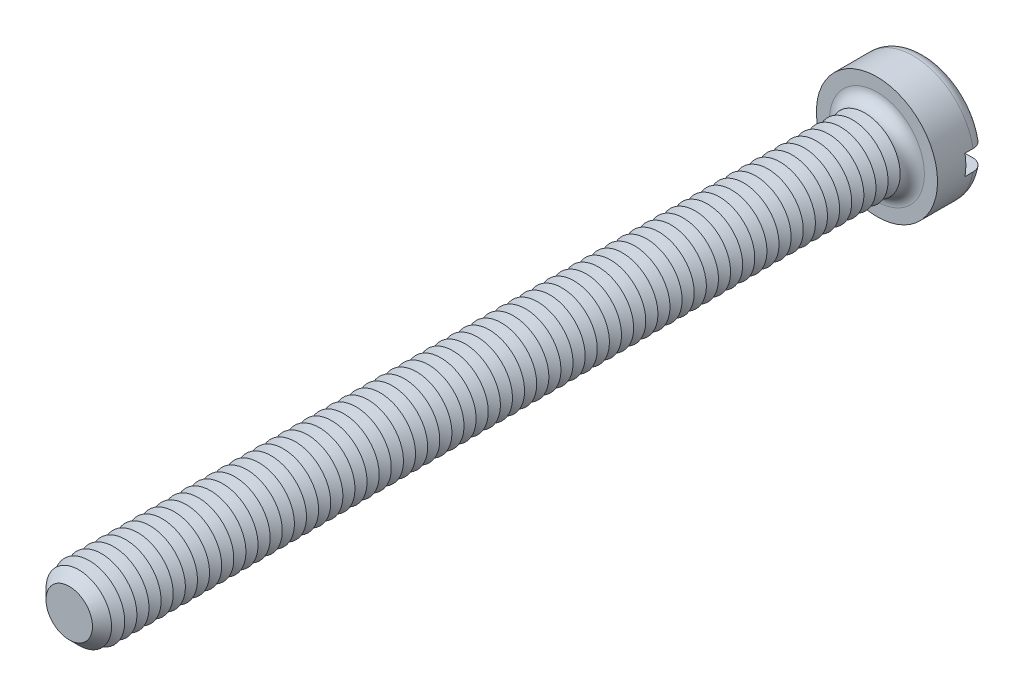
ISO-10303-21;
HEADER;
FILE_DESCRIPTION(('STEP AP214'),'2;1');
FILE_NAME('part.step','',(''),(''),'','','');
FILE_SCHEMA(('AUTOMOTIVE_DESIGN { 1 0 10303 214 1 1 1 1 }'));
ENDSEC;
DATA;
#1=APPLICATION_CONTEXT('core data for automotive mechanical design processes');
#2=APPLICATION_PROTOCOL_DEFINITION('international standard','automotive_design',2000,#1);
#3=PRODUCT_CONTEXT('',#1,'mechanical');
#4=PRODUCT('Part','Part','',(#3));
#5=PRODUCT_RELATED_PRODUCT_CATEGORY('part','',(#4));
#6=PRODUCT_DEFINITION_FORMATION('','',#4);
#7=PRODUCT_DEFINITION_CONTEXT('part definition',#1,'design');
#8=PRODUCT_DEFINITION('design','',#6,#7);
#9=PRODUCT_DEFINITION_SHAPE('','',#8);
#10=(LENGTH_UNIT() NAMED_UNIT(*) SI_UNIT(.MILLI.,.METRE.));
#11=(NAMED_UNIT(*) PLANE_ANGLE_UNIT() SI_UNIT($,.RADIAN.));
#12=(NAMED_UNIT(*) SI_UNIT($,.STERADIAN.) SOLID_ANGLE_UNIT());
#13=UNCERTAINTY_MEASURE_WITH_UNIT(LENGTH_MEASURE(1.E-05),#10,'distance_accuracy_value','');
#14=(GEOMETRIC_REPRESENTATION_CONTEXT(3) GLOBAL_UNCERTAINTY_ASSIGNED_CONTEXT((#13)) GLOBAL_UNIT_ASSIGNED_CONTEXT((#10,
#11,#12)) REPRESENTATION_CONTEXT('',''));
#15=CARTESIAN_POINT('',(0.,0.,0.));
#16=DIRECTION('',(0.,0.,1.));
#17=DIRECTION('',(1.,0.,0.));
#18=AXIS2_PLACEMENT_3D('',#15,#16,#17);
#19=CARTESIAN_POINT('',(0.,0.,-2.4));
#20=DIRECTION('',(0.,0.,1.));
#21=DIRECTION('',(1.,0.,0.));
#22=AXIS2_PLACEMENT_3D('',#19,#20,#21);
#23=PLANE('',#22);
#24=CARTESIAN_POINT('',(0.,0.,-2.4));
#25=DIRECTION('',(0.,0.,1.));
#26=DIRECTION('',(1.,0.,0.));
#27=AXIS2_PLACEMENT_3D('',#24,#25,#26);
#28=CIRCLE('',#27,2.4);
#29=CARTESIAN_POINT('',(-2.3473389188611,0.5,-2.4));
#30=VERTEX_POINT('',#29);
#31=CARTESIAN_POINT('',(2.3473389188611,0.5,-2.4));
#32=VERTEX_POINT('',#31);
#33=EDGE_CURVE('E116',#30,#32,#28,.F.);
#34=ORIENTED_EDGE('',*,*,#33,.T.);
#35=DIRECTION('',(1.,0.,0.));
#36=VECTOR('',#35,1.);
#37=CARTESIAN_POINT('',(-3.,0.5,-2.4));
#38=LINE('',#37,#36);
#39=EDGE_CURVE('E111',#30,#32,#38,.T.);
#40=ORIENTED_EDGE('',*,*,#39,.F.);
#41=EDGE_LOOP('',(#34,#40));
#42=FACE_BOUND('',#41,.T.);
#43=ADVANCED_FACE('F39',(#42),#23,.F.);
#44=CARTESIAN_POINT('',(0.,0.,-1.8));
#45=DIRECTION('',(0.,0.,1.));
#46=DIRECTION('',(1.,0.,0.));
#47=AXIS2_PLACEMENT_3D('',#44,#45,#46);
#48=TOROIDAL_SURFACE('',#47,2.4,0.6);
#49=CARTESIAN_POINT('',(-2.85761641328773,0.5,-2.13010535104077));
#50=CARTESIAN_POINT('',(-2.83871556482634,0.5,-2.1583605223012));
#51=CARTESIAN_POINT('',(-2.81738546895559,0.5,-2.18502342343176));
#52=CARTESIAN_POINT('',(-2.7705148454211,0.5,-2.23439244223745));
#53=CARTESIAN_POINT('',(-2.74496859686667,0.5,-2.25709309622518));
#54=CARTESIAN_POINT('',(-2.6904684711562,0.5,-2.29787524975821));
#55=CARTESIAN_POINT('',(-2.66151863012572,0.5,-2.3159621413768));
#56=CARTESIAN_POINT('',(-2.60103287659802,0.5,-2.34708203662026));
#57=CARTESIAN_POINT('',(-2.56949759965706,0.5,-2.36011627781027));
#58=CARTESIAN_POINT('',(-2.50430694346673,0.5,-2.38095952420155));
#59=CARTESIAN_POINT('',(-2.47062984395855,0.5,-2.38870056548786));
#60=CARTESIAN_POINT('',(-2.40245905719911,0.5,-2.39852415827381));
#61=CARTESIAN_POINT('',(-2.36796525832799,0.5,-2.40060593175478));
#62=CARTESIAN_POINT('',(-2.29850850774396,0.5,-2.39907718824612));
#63=CARTESIAN_POINT('',(-2.2635477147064,0.5,-2.3953679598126));
#64=CARTESIAN_POINT('',(-2.19472542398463,0.5,-2.38219781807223));
#65=CARTESIAN_POINT('',(-2.16086402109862,0.5,-2.37273641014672));
#66=CARTESIAN_POINT('',(-2.09483473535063,0.5,-2.3481926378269));
#67=CARTESIAN_POINT('',(-2.06268841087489,0.5,-2.3330521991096));
#68=CARTESIAN_POINT('',(-2.00140871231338,0.5,-2.29756210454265));
#69=CARTESIAN_POINT('',(-1.97227539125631,0.5,-2.27721235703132));
#70=CARTESIAN_POINT('',(-1.91805676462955,0.5,-2.23196210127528));
#71=CARTESIAN_POINT('',(-1.89294995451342,0.5,-2.20708739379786));
#72=CARTESIAN_POINT('',(-1.84740424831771,0.5,-2.1533758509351));
#73=CARTESIAN_POINT('',(-1.82696468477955,0.5,-2.12453958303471));
#74=CARTESIAN_POINT('',(-1.7919439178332,0.5,-2.06452274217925));
#75=CARTESIAN_POINT('',(-1.7772221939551,0.5,-2.03342424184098));
#76=CARTESIAN_POINT('',(-1.75343025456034,0.5,-1.96913621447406));
#77=CARTESIAN_POINT('',(-1.74435859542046,0.5,-1.93594722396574));
#78=CARTESIAN_POINT('',(-1.73243855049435,0.5,-1.86969199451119));
#79=CARTESIAN_POINT('',(-1.72938008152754,0.5,-1.83666346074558));
#80=CARTESIAN_POINT('',(-1.72896592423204,0.5,-1.77057287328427));
#81=CARTESIAN_POINT('',(-1.73160950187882,0.5,-1.73751082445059));
#82=CARTESIAN_POINT('',(-1.7423966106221,0.5,-1.67291835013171));
#83=CARTESIAN_POINT('',(-1.75043952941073,0.5,-1.64137102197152));
#84=CARTESIAN_POINT('',(-1.77163396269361,0.5,-1.58004446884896));
#85=CARTESIAN_POINT('',(-1.78478577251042,0.5,-1.55026534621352));
#86=CARTESIAN_POINT('',(-1.81598186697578,0.5,-1.49283859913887));
#87=CARTESIAN_POINT('',(-1.83409369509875,0.5,-1.46522772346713));
#88=CARTESIAN_POINT('',(-1.87455179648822,0.5,-1.41330756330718));
#89=CARTESIAN_POINT('',(-1.89689874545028,0.5,-1.38899880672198));
#90=CARTESIAN_POINT('',(-1.94600584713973,0.5,-1.34349499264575));
#91=CARTESIAN_POINT('',(-1.97289034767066,0.5,-1.32243411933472));
#92=CARTESIAN_POINT('',(-2.02972905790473,0.5,-1.28496935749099));
#93=CARTESIAN_POINT('',(-2.05968375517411,0.5,-1.26856621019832));
#94=CARTESIAN_POINT('',(-2.12276894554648,0.5,-1.24040709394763));
#95=CARTESIAN_POINT('',(-2.15596700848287,0.5,-1.22880230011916));
#96=CARTESIAN_POINT('',(-2.22383000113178,0.5,-1.21126311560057));
#97=CARTESIAN_POINT('',(-2.25849504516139,0.5,-1.20532916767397));
#98=CARTESIAN_POINT('',(-2.32870403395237,0.5,-1.1992792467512));
#99=CARTESIAN_POINT('',(-2.36425340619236,0.5,-1.19922586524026));
#100=CARTESIAN_POINT('',(-2.4348506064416,0.5,-1.2051326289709));
#101=CARTESIAN_POINT('',(-2.4698984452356,0.5,-1.21109264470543));
#102=CARTESIAN_POINT('',(-2.53821803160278,0.5,-1.22883658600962));
#103=CARTESIAN_POINT('',(-2.57150081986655,0.5,-1.24057794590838));
#104=CARTESIAN_POINT('',(-2.63557260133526,0.5,-1.2695744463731));
#105=CARTESIAN_POINT('',(-2.66636179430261,0.5,-1.28682914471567));
#106=CARTESIAN_POINT('',(-2.72402406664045,0.5,-1.32606063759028));
#107=CARTESIAN_POINT('',(-2.75095352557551,0.5,-1.34795455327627));
#108=CARTESIAN_POINT('',(-2.80067182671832,0.5,-1.39602603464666));
#109=CARTESIAN_POINT('',(-2.82346106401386,0.5,-1.42220319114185));
#110=CARTESIAN_POINT('',(-2.86383281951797,0.5,-1.47760238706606));
#111=CARTESIAN_POINT('',(-2.88149947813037,0.5,-1.50676312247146));
#112=CARTESIAN_POINT('',(-2.91160874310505,0.5,-1.56766595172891));
#113=CARTESIAN_POINT('',(-2.92405198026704,0.5,-1.59940773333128));
#114=CARTESIAN_POINT('',(-2.94319943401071,0.5,-1.66411282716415));
#115=CARTESIAN_POINT('',(-2.94997843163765,0.5,-1.69705402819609));
#116=CARTESIAN_POINT('',(-2.95787009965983,0.5,-1.7636173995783));
#117=CARTESIAN_POINT('',(-2.95898157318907,0.5,-1.79723971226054));
#118=CARTESIAN_POINT('',(-2.95551354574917,0.5,-1.86397776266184));
#119=CARTESIAN_POINT('',(-2.95096897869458,0.5,-1.89709534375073));
#120=CARTESIAN_POINT('',(-2.93638731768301,0.5,-1.96206785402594));
#121=CARTESIAN_POINT('',(-2.92635713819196,0.5,-1.99392431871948));
#122=CARTESIAN_POINT('',(-2.90618743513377,0.5,-2.04315073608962));
#123=CARTESIAN_POINT('',(-2.89769874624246,0.5,-2.06121519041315));
#124=CARTESIAN_POINT('',(-2.87895753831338,0.5,-2.096404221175));
#125=CARTESIAN_POINT('',(-2.86870503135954,0.5,-2.11352880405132));
#126=CARTESIAN_POINT('',(-2.85761641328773,0.5,-2.13010535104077));
#127=B_SPLINE_CURVE_WITH_KNOTS('',3,(#49,#50,#51,#52,#53,#54,#55,#56,#57,#58,#59,#60,#61,#62,
#63,#64,#65,#66,#67,#68,#69,#70,#71,#72,#73,#74,#75,#76,#77,#78,#79,#80,#81,#82,#83,#84,#85,#86,
#87,#88,#89,#90,#91,#92,#93,#94,#95,#96,#97,#98,#99,#100,#101,#102,#103,#104,#105,#106,#107,
#108,#109,#110,#111,#112,#113,#114,#115,#116,#117,#118,#119,#120,#121,#122,#123,#124,#125,#126),
.UNSPECIFIED.,.T.,.F.,(4,2,2,2,2,2,2,2,2,2,2,2,2,2,2,2,2,2,2,2,2,2,2,2,2,2,2,2,2,2,2,2,2,2,2,2,
2,2,4),(0.,0.101907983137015,0.203955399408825,0.305883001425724,0.407785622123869,
0.510973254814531,0.614175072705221,0.719155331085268,0.824144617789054,0.930238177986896,
1.03633360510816,1.14184204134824,1.24733537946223,1.35004136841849,1.45272110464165,
1.5517448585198,1.65075586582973,1.74797128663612,1.84519232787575,1.9438094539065,
2.0424423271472,2.14443321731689,2.24644032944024,2.35145317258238,2.45647421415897,
2.56261297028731,2.66874944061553,2.77411589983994,2.87947390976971,2.98308820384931,
3.08669260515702,3.18848388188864,3.29026286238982,3.39067588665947,3.49111011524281,
3.59092708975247,3.69061853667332,3.75040561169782,3.81019227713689),.UNSPECIFIED.);
#128=CARTESIAN_POINT('',(-2.95803989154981,0.5,-1.8));
#129=VERTEX_POINT('',#128);
#130=EDGE_CURVE('E705',#129,#30,#127,.T.);
#131=ORIENTED_EDGE('',*,*,#130,.F.);
#132=CARTESIAN_POINT('',(0.,0.,-1.8));
#133=DIRECTION('',(0.,0.,1.));
#134=DIRECTION('',(1.,0.,0.));
#135=AXIS2_PLACEMENT_3D('',#132,#133,#134);
#136=CIRCLE('',#135,3.);
#137=CARTESIAN_POINT('',(2.95803989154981,0.5,-1.8));
#138=VERTEX_POINT('',#137);
#139=EDGE_CURVE('E125',#138,#129,#136,.T.);
#140=ORIENTED_EDGE('',*,*,#139,.F.);
#141=CARTESIAN_POINT('',(1.78664846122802,0.5,-2.05158390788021));
#142=CARTESIAN_POINT('',(1.80142751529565,0.5,-2.08239430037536));
#143=CARTESIAN_POINT('',(1.81889355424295,0.5,-2.111949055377));
#144=CARTESIAN_POINT('',(1.8585933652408,0.5,-2.16770384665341));
#145=CARTESIAN_POINT('',(1.88083491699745,0.5,-2.19389829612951));
#146=CARTESIAN_POINT('',(1.92931942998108,0.5,-2.24217519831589));
#147=CARTESIAN_POINT('',(1.95555471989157,0.5,-2.26426535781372));
#148=CARTESIAN_POINT('',(2.01127789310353,0.5,-2.30384045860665));
#149=CARTESIAN_POINT('',(2.04076488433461,0.5,-2.32132665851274));
#150=CARTESIAN_POINT('',(2.10290022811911,0.5,-2.3516259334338));
#151=CARTESIAN_POINT('',(2.13560600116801,0.5,-2.3643213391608));
#152=CARTESIAN_POINT('',(2.20267136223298,0.5,-2.38412242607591));
#153=CARTESIAN_POINT('',(2.23703118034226,0.5,-2.3912273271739));
#154=CARTESIAN_POINT('',(2.30690186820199,0.5,-2.39969404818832));
#155=CARTESIAN_POINT('',(2.34242185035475,0.5,-2.40098100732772));
#156=CARTESIAN_POINT('',(2.41317063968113,0.5,-2.39753827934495));
#157=CARTESIAN_POINT('',(2.44839945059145,0.5,-2.39280866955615));
#158=CARTESIAN_POINT('',(2.51734146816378,0.5,-2.37746773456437));
#159=CARTESIAN_POINT('',(2.55106223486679,0.5,-2.3668904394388));
#160=CARTESIAN_POINT('',(2.61620389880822,0.5,-2.34013333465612));
#161=CARTESIAN_POINT('',(2.64762498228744,0.5,-2.32395397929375));
#162=CARTESIAN_POINT('',(2.70673284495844,0.5,-2.28672393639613));
#163=CARTESIAN_POINT('',(2.73447138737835,0.5,-2.26575544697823));
#164=CARTESIAN_POINT('',(2.78595339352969,0.5,-2.21938197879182));
#165=CARTESIAN_POINT('',(2.80969724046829,0.5,-2.19397742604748));
#166=CARTESIAN_POINT('',(2.85207235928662,0.5,-2.13993965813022));
#167=CARTESIAN_POINT('',(2.87078674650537,0.5,-2.11137160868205));
#168=CARTESIAN_POINT('',(2.90307455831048,0.5,-2.05146448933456));
#169=CARTESIAN_POINT('',(2.91664841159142,0.5,-2.02012565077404));
#170=CARTESIAN_POINT('',(2.93808283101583,0.5,-1.95603682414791));
#171=CARTESIAN_POINT('',(2.94602016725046,0.5,-1.92331249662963));
#172=CARTESIAN_POINT('',(2.95624273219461,0.5,-1.85699296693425));
#173=CARTESIAN_POINT('',(2.95852824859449,0.5,-1.82339780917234));
#174=CARTESIAN_POINT('',(2.95738171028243,0.5,-1.75655451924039));
#175=CARTESIAN_POINT('',(2.95399174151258,0.5,-1.72330565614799));
#176=CARTESIAN_POINT('',(2.94167749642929,0.5,-1.65784996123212));
#177=CARTESIAN_POINT('',(2.93275329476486,0.5,-1.62564311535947));
#178=CARTESIAN_POINT('',(2.90963870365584,0.5,-1.56317641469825));
#179=CARTESIAN_POINT('',(2.89544787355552,0.5,-1.53291672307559));
#180=CARTESIAN_POINT('',(2.86222325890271,0.5,-1.47518589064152));
#181=CARTESIAN_POINT('',(2.84318935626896,0.5,-1.44771481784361));
#182=CARTESIAN_POINT('',(2.80067851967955,0.5,-1.39611362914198));
#183=CARTESIAN_POINT('',(2.77716960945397,0.5,-1.37200986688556));
#184=CARTESIAN_POINT('',(2.72648704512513,0.5,-1.3280274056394));
#185=CARTESIAN_POINT('',(2.69931317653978,0.5,-1.3081489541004));
#186=CARTESIAN_POINT('',(2.64167967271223,0.5,-1.27288334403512));
#187=CARTESIAN_POINT('',(2.61118015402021,0.5,-1.25756138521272));
#188=CARTESIAN_POINT('',(2.54807315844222,0.5,-1.2321564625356));
#189=CARTESIAN_POINT('',(2.51546550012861,0.5,-1.22207395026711));
#190=CARTESIAN_POINT('',(2.44846246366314,0.5,-1.20724783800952));
#191=CARTESIAN_POINT('',(2.41404584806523,0.5,-1.2026002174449));
#192=CARTESIAN_POINT('',(2.34491756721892,0.5,-1.19904907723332));
#193=CARTESIAN_POINT('',(2.3102058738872,0.5,-1.20014611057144));
#194=CARTESIAN_POINT('',(2.24087507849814,0.5,-1.20808958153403));
#195=CARTESIAN_POINT('',(2.20626660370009,0.5,-1.21502895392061));
#196=CARTESIAN_POINT('',(2.13868705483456,0.5,-1.23457616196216));
#197=CARTESIAN_POINT('',(2.10571611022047,0.5,-1.24718444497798));
#198=CARTESIAN_POINT('',(2.04212010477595,0.5,-1.2778419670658));
#199=CARTESIAN_POINT('',(2.0115131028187,0.5,-1.29592871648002));
#200=CARTESIAN_POINT('',(1.95381117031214,0.5,-1.33703838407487));
#201=CARTESIAN_POINT('',(1.92671618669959,0.5,-1.36006122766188));
#202=CARTESIAN_POINT('',(1.8771749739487,0.5,-1.41014760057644));
#203=CARTESIAN_POINT('',(1.85467966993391,0.5,-1.43716252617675));
#204=CARTESIAN_POINT('',(1.8147167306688,0.5,-1.49468601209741));
#205=CARTESIAN_POINT('',(1.79724791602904,0.5,-1.52519375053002));
#206=CARTESIAN_POINT('',(1.76843420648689,0.5,-1.58782676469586));
#207=CARTESIAN_POINT('',(1.75691546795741,0.5,-1.61987202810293));
#208=CARTESIAN_POINT('',(1.73963101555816,0.5,-1.68548715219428));
#209=CARTESIAN_POINT('',(1.73386545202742,0.5,-1.71905705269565));
#210=CARTESIAN_POINT('',(1.72840927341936,0.5,-1.78556262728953));
#211=CARTESIAN_POINT('',(1.72852416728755,0.5,-1.8184825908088));
#212=CARTESIAN_POINT('',(1.73434422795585,0.5,-1.88379362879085));
#213=CARTESIAN_POINT('',(1.74004181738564,0.5,-1.91618535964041));
#214=CARTESIAN_POINT('',(1.75312909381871,0.5,-1.96568884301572));
#215=CARTESIAN_POINT('',(1.75869685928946,0.5,-1.98330302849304));
#216=CARTESIAN_POINT('',(1.77146455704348,0.5,-2.01792824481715));
#217=CARTESIAN_POINT('',(1.7786644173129,0.5,-2.03493930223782));
#218=CARTESIAN_POINT('',(1.78664846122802,0.5,-2.05158390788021));
#219=B_SPLINE_CURVE_WITH_KNOTS('',3,(#141,#142,#143,#144,#145,#146,#147,#148,#149,#150,#151,
#152,#153,#154,#155,#156,#157,#158,#159,#160,#161,#162,#163,#164,#165,#166,#167,#168,#169,#170,
#171,#172,#173,#174,#175,#176,#177,#178,#179,#180,#181,#182,#183,#184,#185,#186,#187,#188,#189,
#190,#191,#192,#193,#194,#195,#196,#197,#198,#199,#200,#201,#202,#203,#204,#205,#206,#207,#208,
#209,#210,#211,#212,#213,#214,#215,#216,#217,#218),.UNSPECIFIED.,.T.,.F.,(4,2,2,2,2,2,2,2,2,2,2,
2,2,2,2,2,2,2,2,2,2,2,2,2,2,2,2,2,2,2,2,2,2,2,2,2,2,2,4),(0.,0.10244464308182,0.205057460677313,
0.307475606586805,0.409865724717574,0.514628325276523,0.619405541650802,0.72552718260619,
0.831647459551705,0.937156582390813,1.04265715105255,1.1464674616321,1.25026780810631,
1.3522293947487,1.45418247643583,1.55471883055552,1.6552500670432,1.75503912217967,
1.8548268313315,1.95462289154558,2.05442138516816,2.15496174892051,2.25550799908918,
2.35743049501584,2.45936177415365,2.56306719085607,2.66678259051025,2.77217967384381,
2.87758507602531,2.98372914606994,3.08987161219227,3.19481457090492,3.29973288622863,
3.40138228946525,3.50303434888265,3.60132659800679,3.69948562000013,3.75483142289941,
3.8101747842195),.UNSPECIFIED.);
#220=EDGE_CURVE('E707',#32,#138,#219,.T.);
#221=ORIENTED_EDGE('',*,*,#220,.F.);
#222=ORIENTED_EDGE('',*,*,#33,.F.);
#223=EDGE_LOOP('',(#131,#140,#221,#222));
#224=FACE_BOUND('',#223,.T.);
#225=ADVANCED_FACE('F689',(#224),#48,.T.);
#226=CARTESIAN_POINT('',(0.,0.,-2.4));
#227=DIRECTION('',(0.,0.,1.));
#228=DIRECTION('',(1.,0.,0.));
#229=AXIS2_PLACEMENT_3D('',#226,#227,#228);
#230=CYLINDRICAL_SURFACE('',#229,3.);
#231=DIRECTION('',(0.,0.,1.));
#232=VECTOR('',#231,1.);
#233=CARTESIAN_POINT('',(2.95803989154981,0.5,-2.4));
#234=LINE('',#233,#232);
#235=CARTESIAN_POINT('',(2.95803989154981,0.5,-1.4));
#236=VERTEX_POINT('',#235);
#237=EDGE_CURVE('E722',#138,#236,#234,.T.);
#238=ORIENTED_EDGE('',*,*,#237,.F.);
#239=ORIENTED_EDGE('',*,*,#139,.T.);
#240=DIRECTION('',(0.,0.,1.));
#241=VECTOR('',#240,1.);
#242=CARTESIAN_POINT('',(-2.95803989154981,0.5,-2.4));
#243=LINE('',#242,#241);
#244=CARTESIAN_POINT('',(-2.95803989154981,0.5,-1.4));
#245=VERTEX_POINT('',#244);
#246=EDGE_CURVE('E63',#245,#129,#243,.F.);
#247=ORIENTED_EDGE('',*,*,#246,.F.);
#248=CARTESIAN_POINT('',(0.,0.,-1.4));
#249=DIRECTION('',(0.,0.,-1.));
#250=DIRECTION('',(-1.,0.,0.));
#251=AXIS2_PLACEMENT_3D('',#248,#249,#250);
#252=CIRCLE('',#251,3.);
#253=CARTESIAN_POINT('',(-2.95803989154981,-0.5,-1.4));
#254=VERTEX_POINT('',#253);
#255=EDGE_CURVE('E43',#245,#254,#252,.F.);
#256=ORIENTED_EDGE('',*,*,#255,.T.);
#257=DIRECTION('',(0.,0.,1.));
#258=VECTOR('',#257,1.);
#259=CARTESIAN_POINT('',(-2.95803989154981,-0.5,-2.4));
#260=LINE('',#259,#258);
#261=CARTESIAN_POINT('',(-2.9580398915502,-0.5,-1.79999999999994));
#262=VERTEX_POINT('',#261);
#263=EDGE_CURVE('E719',#262,#254,#260,.T.);
#264=ORIENTED_EDGE('',*,*,#263,.F.);
#265=CARTESIAN_POINT('',(2.95803989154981,-0.5,-1.8));
#266=VERTEX_POINT('',#265);
#267=EDGE_CURVE('E127',#262,#266,#136,.T.);
#268=ORIENTED_EDGE('',*,*,#267,.T.);
#269=DIRECTION('',(0.,0.,1.));
#270=VECTOR('',#269,1.);
#271=CARTESIAN_POINT('',(2.95803989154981,-0.5,-2.4));
#272=LINE('',#271,#270);
#273=CARTESIAN_POINT('',(2.95803989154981,-0.5,-1.4));
#274=VERTEX_POINT('',#273);
#275=EDGE_CURVE('E55',#274,#266,#272,.F.);
#276=ORIENTED_EDGE('',*,*,#275,.F.);
#277=EDGE_CURVE('E11',#274,#236,#252,.F.);
#278=ORIENTED_EDGE('',*,*,#277,.T.);
#279=EDGE_LOOP('',(#238,#239,#247,#256,#264,#268,#276,#278));
#280=FACE_BOUND('',#279,.T.);
#281=CARTESIAN_POINT('',(0.,0.,0.));
#282=DIRECTION('',(0.,0.,1.));
#283=DIRECTION('',(1.,0.,0.));
#284=AXIS2_PLACEMENT_3D('',#281,#282,#283);
#285=CIRCLE('',#284,3.);
#286=CARTESIAN_POINT('',(3.,0.,0.));
#287=VERTEX_POINT('',#286);
#288=EDGE_CURVE('E724',#287,#287,#285,.T.);
#289=ORIENTED_EDGE('',*,*,#288,.F.);
#290=EDGE_LOOP('',(#289));
#291=FACE_BOUND('',#290,.T.);
#292=ADVANCED_FACE('F685',(#280,#291),#230,.T.);
#293=CARTESIAN_POINT('',(2.3473389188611,-0.5,-2.4));
#294=VERTEX_POINT('',#293);
#295=CARTESIAN_POINT('',(-2.3473389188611,-0.5,-2.4));
#296=VERTEX_POINT('',#295);
#297=EDGE_CURVE('E109',#294,#296,#28,.F.);
#298=ORIENTED_EDGE('',*,*,#297,.T.);
#299=DIRECTION('',(-1.,0.,0.));
#300=VECTOR('',#299,1.);
#301=CARTESIAN_POINT('',(-3.,-0.5,-2.4));
#302=LINE('',#301,#300);
#303=EDGE_CURVE('E96',#294,#296,#302,.T.);
#304=ORIENTED_EDGE('',*,*,#303,.F.);
#305=EDGE_LOOP('',(#298,#304));
#306=FACE_BOUND('',#305,.T.);
#307=ADVANCED_FACE('F108',(#306),#23,.F.);
#308=CARTESIAN_POINT('',(0.,0.,0.));
#309=DIRECTION('',(0.,0.,1.));
#310=DIRECTION('',(1.,0.,0.));
#311=AXIS2_PLACEMENT_3D('',#308,#309,#310);
#312=PLANE('',#311);
#313=CARTESIAN_POINT('',(0.,0.,0.));
#314=DIRECTION('',(0.,0.,1.));
#315=DIRECTION('',(1.,0.,0.));
#316=AXIS2_PLACEMENT_3D('',#313,#314,#315);
#317=CIRCLE('',#316,2.35);
#318=CARTESIAN_POINT('',(2.35,0.,0.));
#319=VERTEX_POINT('',#318);
#320=EDGE_CURVE('E115',#319,#319,#317,.F.);
#321=ORIENTED_EDGE('',*,*,#320,.T.);
#322=EDGE_LOOP('',(#321));
#323=FACE_BOUND('',#322,.T.);
#324=ORIENTED_EDGE('',*,*,#288,.T.);
#325=EDGE_LOOP('',(#324));
#326=FACE_BOUND('',#325,.T.);
#327=ADVANCED_FACE('F684',(#323,#326),#312,.T.);
#328=CARTESIAN_POINT('',(-2.85761641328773,-0.5,-2.13010535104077));
#329=CARTESIAN_POINT('',(-2.87617085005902,-0.5,-2.10236255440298));
#330=CARTESIAN_POINT('',(-2.89241094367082,-0.5,-2.07304478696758));
#331=CARTESIAN_POINT('',(-2.91975805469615,-0.5,-2.01207835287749));
#332=CARTESIAN_POINT('',(-2.93085958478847,-0.5,-1.98042723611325));
#333=CARTESIAN_POINT('',(-2.94757590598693,-0.5,-1.91570997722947));
#334=CARTESIAN_POINT('',(-2.95319165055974,-0.5,-1.88264408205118));
#335=CARTESIAN_POINT('',(-2.95876526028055,-0.5,-1.81604673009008));
#336=CARTESIAN_POINT('',(-2.95872441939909,-0.5,-1.78251538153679));
#337=CARTESIAN_POINT('',(-2.95300126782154,-0.5,-1.71606888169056));
#338=CARTESIAN_POINT('',(-2.94734076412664,-0.5,-1.68315184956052));
#339=CARTESIAN_POINT('',(-2.93058183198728,-0.5,-1.61873244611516));
#340=CARTESIAN_POINT('',(-2.91948325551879,-0.5,-1.58723011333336));
#341=CARTESIAN_POINT('',(-2.89215903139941,-0.5,-1.52647404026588));
#342=CARTESIAN_POINT('',(-2.87592518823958,-0.5,-1.49722398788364));
#343=CARTESIAN_POINT('',(-2.83881787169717,-0.5,-1.44183365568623));
#344=CARTESIAN_POINT('',(-2.81794425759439,-0.5,-1.41569347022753));
#345=CARTESIAN_POINT('',(-2.77196258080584,-0.5,-1.36700890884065));
#346=CARTESIAN_POINT('',(-2.74681874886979,-0.5,-1.34449832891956));
#347=CARTESIAN_POINT('',(-2.69315595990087,-0.5,-1.30394571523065));
#348=CARTESIAN_POINT('',(-2.66463678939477,-0.5,-1.28590396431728));
#349=CARTESIAN_POINT('',(-2.6045885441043,-0.5,-1.25451133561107));
#350=CARTESIAN_POINT('',(-2.573021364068,-0.5,-1.24123336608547));
#351=CARTESIAN_POINT('',(-2.50813094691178,-0.5,-1.22006271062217));
#352=CARTESIAN_POINT('',(-2.47480755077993,-0.5,-1.21217051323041));
#353=CARTESIAN_POINT('',(-2.40672281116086,-0.5,-1.20185046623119));
#354=CARTESIAN_POINT('',(-2.37194646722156,-0.5,-1.19952155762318));
#355=CARTESIAN_POINT('',(-2.30248663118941,-0.5,-1.20064178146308));
#356=CARTESIAN_POINT('',(-2.26780314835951,-0.5,-1.20409147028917));
#357=CARTESIAN_POINT('',(-2.19896003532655,-0.5,-1.21674803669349));
#358=CARTESIAN_POINT('',(-2.16481620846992,-0.5,-1.22604100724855));
#359=CARTESIAN_POINT('',(-2.09855902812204,-0.5,-1.25020237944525));
#360=CARTESIAN_POINT('',(-2.0664458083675,-0.5,-1.2650711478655));
#361=CARTESIAN_POINT('',(-2.00504979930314,-0.5,-1.3000633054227));
#362=CARTESIAN_POINT('',(-1.97577870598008,-0.5,-1.32020724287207));
#363=CARTESIAN_POINT('',(-1.92109882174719,-0.5,-1.36519538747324));
#364=CARTESIAN_POINT('',(-1.89568984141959,-0.5,-1.39003936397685));
#365=CARTESIAN_POINT('',(-1.84992350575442,-0.5,-1.44333696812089));
#366=CARTESIAN_POINT('',(-1.82949305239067,-0.5,-1.47172774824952));
#367=CARTESIAN_POINT('',(-1.79388305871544,-0.5,-1.53163225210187));
#368=CARTESIAN_POINT('',(-1.77870235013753,-0.5,-1.56314527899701));
#369=CARTESIAN_POINT('',(-1.7545759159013,-0.5,-1.62726698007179));
#370=CARTESIAN_POINT('',(-1.74543784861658,-0.5,-1.65980327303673));
#371=CARTESIAN_POINT('',(-1.73294830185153,-0.5,-1.72596654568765));
#372=CARTESIAN_POINT('',(-1.72959555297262,-0.5,-1.7595932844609));
#373=CARTESIAN_POINT('',(-1.72881879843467,-0.5,-1.82588200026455));
#374=CARTESIAN_POINT('',(-1.73121660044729,-0.5,-1.85854202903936));
#375=CARTESIAN_POINT('',(-1.74148022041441,-0.5,-1.9229888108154));
#376=CARTESIAN_POINT('',(-1.74934586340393,-0.5,-1.95477559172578));
#377=CARTESIAN_POINT('',(-1.77023164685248,-0.5,-2.01650910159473));
#378=CARTESIAN_POINT('',(-1.78323812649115,-0.5,-2.04646046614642));
#379=CARTESIAN_POINT('',(-1.81396733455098,-0.5,-2.10383471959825));
#380=CARTESIAN_POINT('',(-1.83169061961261,-0.5,-2.13125730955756));
#381=CARTESIAN_POINT('',(-1.87183626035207,-0.5,-2.18359240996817));
#382=CARTESIAN_POINT('',(-1.89437158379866,-0.5,-2.20841820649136));
#383=CARTESIAN_POINT('',(-1.9431646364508,-0.5,-2.25409214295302));
#384=CARTESIAN_POINT('',(-1.96942301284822,-0.5,-2.27493958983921));
#385=CARTESIAN_POINT('',(-2.025898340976,-0.5,-2.31281042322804));
#386=CARTESIAN_POINT('',(-2.05622082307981,-0.5,-2.32967654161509));
#387=CARTESIAN_POINT('',(-2.11922391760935,-0.5,-2.35820255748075));
#388=CARTESIAN_POINT('',(-2.15190483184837,-0.5,-2.3698617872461));
#389=CARTESIAN_POINT('',(-2.21944675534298,-0.5,-2.38785911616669));
#390=CARTESIAN_POINT('',(-2.25433929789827,-0.5,-2.39407914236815));
#391=CARTESIAN_POINT('',(-2.32467357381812,-0.5,-2.40058243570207));
#392=CARTESIAN_POINT('',(-2.36011530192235,-0.5,-2.40086575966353));
#393=CARTESIAN_POINT('',(-2.43058129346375,-0.5,-2.39545061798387));
#394=CARTESIAN_POINT('',(-2.46560504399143,-0.5,-2.38974544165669));
#395=CARTESIAN_POINT('',(-2.53418188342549,-0.5,-2.37245602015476));
#396=CARTESIAN_POINT('',(-2.56773468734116,-0.5,-2.36087064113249));
#397=CARTESIAN_POINT('',(-2.63195003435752,-0.5,-2.33229154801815));
#398=CARTESIAN_POINT('',(-2.66264330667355,-0.5,-2.31536681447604));
#399=CARTESIAN_POINT('',(-2.72065333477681,-0.5,-2.2765252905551));
#400=CARTESIAN_POINT('',(-2.7479744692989,-0.5,-2.25461508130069));
#401=CARTESIAN_POINT('',(-2.78903570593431,-0.5,-2.21539504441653));
#402=CARTESIAN_POINT('',(-2.80405150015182,-0.5,-2.19939833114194));
#403=CARTESIAN_POINT('',(-2.83224965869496,-0.5,-2.16586257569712));
#404=CARTESIAN_POINT('',(-2.84543204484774,-0.5,-2.14832355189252));
#405=CARTESIAN_POINT('',(-2.85761641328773,-0.5,-2.13010535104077));
#406=B_SPLINE_CURVE_WITH_KNOTS('',3,(#328,#329,#330,#331,#332,#333,#334,#335,#336,#337,#338,
#339,#340,#341,#342,#343,#344,#345,#346,#347,#348,#349,#350,#351,#352,#353,#354,#355,#356,#357,
#358,#359,#360,#361,#362,#363,#364,#365,#366,#367,#368,#369,#370,#371,#372,#373,#374,#375,#376,
#377,#378,#379,#380,#381,#382,#383,#384,#385,#386,#387,#388,#389,#390,#391,#392,#393,#394,#395,
#396,#397,#398,#399,#400,#401,#402,#403,#404,#405),.UNSPECIFIED.,.T.,.F.,(4,2,2,2,2,2,2,2,2,2,2,
2,2,2,2,2,2,2,2,2,2,2,2,2,2,2,2,2,2,2,2,2,2,2,2,2,2,2,4),(0.,0.100047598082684,
0.200201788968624,0.300338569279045,0.400452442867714,0.500179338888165,0.599908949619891,
0.699798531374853,0.799691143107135,0.900465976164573,1.00124718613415,1.10351091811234,
1.20578392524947,1.30986270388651,1.41395150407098,1.51961105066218,1.62527754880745,
1.73136193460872,1.83744111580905,1.94185359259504,2.04624281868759,2.1471248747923,
2.24798479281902,2.34575994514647,2.44353196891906,2.541045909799,2.63857136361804,
2.73870431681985,2.83885469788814,2.94247024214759,3.0460990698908,3.15192527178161,
3.25775046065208,3.36369436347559,3.46965870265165,3.57430655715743,3.67881706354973,
3.74451732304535,3.81021680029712),.UNSPECIFIED.);
#407=EDGE_CURVE('E103',#296,#262,#406,.T.);
#408=ORIENTED_EDGE('',*,*,#407,.F.);
#409=ORIENTED_EDGE('',*,*,#297,.F.);
#410=CARTESIAN_POINT('',(1.78664846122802,-0.5,-2.05158390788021));
#411=CARTESIAN_POINT('',(1.77253256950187,-0.5,-2.02214917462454));
#412=CARTESIAN_POINT('',(1.76084795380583,-0.5,-1.99152692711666));
#413=CARTESIAN_POINT('',(1.74276267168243,-0.5,-1.92873811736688));
#414=CARTESIAN_POINT('',(1.73636622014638,-0.5,-1.89657034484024));
#415=CARTESIAN_POINT('',(1.72910271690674,-0.5,-1.83160458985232));
#416=CARTESIAN_POINT('',(1.72823699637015,-0.5,-1.79880645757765));
#417=CARTESIAN_POINT('',(1.73207277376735,-0.5,-1.73354460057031));
#418=CARTESIAN_POINT('',(1.7367732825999,-0.5,-1.70108081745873));
#419=CARTESIAN_POINT('',(1.75151033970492,-0.5,-1.63763571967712));
#420=CARTESIAN_POINT('',(1.76150868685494,-0.5,-1.60664550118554));
#421=CARTESIAN_POINT('',(1.78646773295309,-0.5,-1.54673433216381));
#422=CARTESIAN_POINT('',(1.80142897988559,-0.5,-1.51781361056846));
#423=CARTESIAN_POINT('',(1.8361687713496,-0.5,-1.46223275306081));
#424=CARTESIAN_POINT('',(1.85603637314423,-0.5,-1.43562834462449));
#425=CARTESIAN_POINT('',(1.89981598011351,-0.5,-1.38598822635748));
#426=CARTESIAN_POINT('',(1.92372865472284,-0.5,-1.3629531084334));
#427=CARTESIAN_POINT('',(1.97581791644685,-0.5,-1.32025912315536));
#428=CARTESIAN_POINT('',(2.00411431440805,-0.5,-1.30074638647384));
#429=CARTESIAN_POINT('',(2.06351340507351,-0.5,-1.26660223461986));
#430=CARTESIAN_POINT('',(2.09461651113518,-0.5,-1.2519715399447));
#431=CARTESIAN_POINT('',(2.15964055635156,-0.5,-1.22763649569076));
#432=CARTESIAN_POINT('',(2.19361437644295,-0.5,-1.21807321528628));
#433=CARTESIAN_POINT('',(2.26268197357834,-0.5,-1.20474094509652));
#434=CARTESIAN_POINT('',(2.29777581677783,-0.5,-1.20097229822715));
#435=CARTESIAN_POINT('',(2.36834397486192,-0.5,-1.19935270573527));
#436=CARTESIAN_POINT('',(2.40381924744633,-0.5,-1.20154258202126));
#437=CARTESIAN_POINT('',(2.47388621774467,-0.5,-1.211906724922));
#438=CARTESIAN_POINT('',(2.50847794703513,-0.5,-1.22008077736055));
#439=CARTESIAN_POINT('',(2.57542869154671,-0.5,-1.24211740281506));
#440=CARTESIAN_POINT('',(2.60780612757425,-0.5,-1.25592395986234));
#441=CARTESIAN_POINT('',(2.66972487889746,-0.5,-1.28886991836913));
#442=CARTESIAN_POINT('',(2.69926644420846,-0.5,-1.3080088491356));
#443=CARTESIAN_POINT('',(2.75412764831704,-0.5,-1.35072337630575));
#444=CARTESIAN_POINT('',(2.77951140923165,-0.5,-1.37421661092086));
#445=CARTESIAN_POINT('',(2.82588981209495,-0.5,-1.42519687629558));
#446=CARTESIAN_POINT('',(2.84688487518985,-0.5,-1.4526835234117));
#447=CARTESIAN_POINT('',(2.88351678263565,-0.5,-1.51036368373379));
#448=CARTESIAN_POINT('',(2.89923879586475,-0.5,-1.54050312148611));
#449=CARTESIAN_POINT('',(2.92532780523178,-0.5,-1.60301687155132));
#450=CARTESIAN_POINT('',(2.93569520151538,-0.5,-1.63539101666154));
#451=CARTESIAN_POINT('',(2.95066155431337,-0.5,-1.70102985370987));
#452=CARTESIAN_POINT('',(2.95532930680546,-0.5,-1.73427887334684));
#453=CARTESIAN_POINT('',(2.9589838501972,-0.5,-1.80108716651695));
#454=CARTESIAN_POINT('',(2.95797087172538,-0.5,-1.83464642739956));
#455=CARTESIAN_POINT('',(2.9503157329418,-0.5,-1.90093629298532));
#456=CARTESIAN_POINT('',(2.9437032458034,-0.5,-1.93367033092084));
#457=CARTESIAN_POINT('',(2.92508830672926,-0.5,-1.99756717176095));
#458=CARTESIAN_POINT('',(2.91308586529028,-0.5,-2.02872997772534));
#459=CARTESIAN_POINT('',(2.88401713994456,-0.5,-2.08868263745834));
#460=CARTESIAN_POINT('',(2.86693946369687,-0.5,-2.11746696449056));
#461=CARTESIAN_POINT('',(2.82823635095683,-0.5,-2.17179415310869));
#462=CARTESIAN_POINT('',(2.80661076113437,-0.5,-2.19733690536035));
#463=CARTESIAN_POINT('',(2.75921750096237,-0.5,-2.24472182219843));
#464=CARTESIAN_POINT('',(2.73341278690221,-0.5,-2.26652692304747));
#465=CARTESIAN_POINT('',(2.67855512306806,-0.5,-2.30557116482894));
#466=CARTESIAN_POINT('',(2.64950194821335,-0.5,-2.32280998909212));
#467=CARTESIAN_POINT('',(2.58850670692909,-0.5,-2.35251615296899));
#468=CARTESIAN_POINT('',(2.55652763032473,-0.5,-2.36490748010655));
#469=CARTESIAN_POINT('',(2.4909651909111,-0.5,-2.38424946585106));
#470=CARTESIAN_POINT('',(2.45738167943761,-0.5,-2.39119961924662));
#471=CARTESIAN_POINT('',(2.38892891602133,-0.5,-2.39958830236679));
#472=CARTESIAN_POINT('',(2.35404742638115,-0.5,-2.40092701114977));
#473=CARTESIAN_POINT('',(2.28454389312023,-0.5,-2.39781917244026));
#474=CARTESIAN_POINT('',(2.24992186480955,-0.5,-2.39337228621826));
#475=CARTESIAN_POINT('',(2.18139250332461,-0.5,-2.37872879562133));
#476=CARTESIAN_POINT('',(2.14750264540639,-0.5,-2.36845030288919));
#477=CARTESIAN_POINT('',(2.08190943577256,-0.5,-2.34236291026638));
#478=CARTESIAN_POINT('',(2.05020675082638,-0.5,-2.32655233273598));
#479=CARTESIAN_POINT('',(1.98982495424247,-0.5,-2.28976285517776));
#480=CARTESIAN_POINT('',(1.96115527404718,-0.5,-2.26876847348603));
#481=CARTESIAN_POINT('',(1.90785147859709,-0.5,-2.22220002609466));
#482=CARTESIAN_POINT('',(1.88321231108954,-0.5,-2.19663177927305));
#483=CARTESIAN_POINT('',(1.84638483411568,-0.5,-2.15106161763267));
#484=CARTESIAN_POINT('',(1.8328227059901,-0.5,-2.13215328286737));
#485=CARTESIAN_POINT('',(1.80797918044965,-0.5,-2.09289185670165));
#486=CARTESIAN_POINT('',(1.79669771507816,-0.5,-2.07253880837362));
#487=CARTESIAN_POINT('',(1.78664846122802,-0.5,-2.05158390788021));
#488=B_SPLINE_CURVE_WITH_KNOTS('',3,(#410,#411,#412,#413,#414,#415,#416,#417,#418,#419,#420,
#421,#422,#423,#424,#425,#426,#427,#428,#429,#430,#431,#432,#433,#434,#435,#436,#437,#438,#439,
#440,#441,#442,#443,#444,#445,#446,#447,#448,#449,#450,#451,#452,#453,#454,#455,#456,#457,#458,
#459,#460,#461,#462,#463,#464,#465,#466,#467,#468,#469,#470,#471,#472,#473,#474,#475,#476,#477,
#478,#479,#480,#481,#482,#483,#484,#485,#486,#487),.UNSPECIFIED.,.T.,.F.,(4,2,2,2,2,2,2,2,2,2,2,
2,2,2,2,2,2,2,2,2,2,2,2,2,2,2,2,2,2,2,2,2,2,2,2,2,2,2,4),(0.,0.0978512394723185,0.19578039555,
0.293733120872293,0.391668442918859,0.488907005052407,0.58615630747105,0.685320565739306,
0.784501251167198,0.887148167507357,0.989810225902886,1.09519726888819,1.20059054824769,
1.30670769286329,1.41282103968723,1.51790384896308,1.62297738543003,1.72623563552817,
1.82948397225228,1.93097382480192,2.03245609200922,2.13270093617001,2.23294171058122,
2.33265458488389,2.43236726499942,2.53230548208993,2.63224706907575,2.73312861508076,
2.83401715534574,2.93642973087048,3.03885181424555,3.14308833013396,3.24733094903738,
3.35307493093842,3.45885100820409,3.56494689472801,3.67090875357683,3.74057217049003,
3.81023351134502),.UNSPECIFIED.);
#489=EDGE_CURVE('E92',#266,#294,#488,.T.);
#490=ORIENTED_EDGE('',*,*,#489,.F.);
#491=ORIENTED_EDGE('',*,*,#267,.F.);
#492=EDGE_LOOP('',(#408,#409,#490,#491));
#493=FACE_BOUND('',#492,.T.);
#494=ADVANCED_FACE('F113',(#493),#48,.T.);
#495=CARTESIAN_POINT('',(0.,0.,0.600000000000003));
#496=DIRECTION('',(0.,0.,1.));
#497=DIRECTION('',(1.,0.,0.));
#498=AXIS2_PLACEMENT_3D('',#495,#496,#497);
#499=TOROIDAL_SURFACE('',#498,2.35,0.6);
#500=ORIENTED_EDGE('',*,*,#320,.F.);
#501=EDGE_LOOP('',(#500));
#502=FACE_BOUND('',#501,.T.);
#503=CARTESIAN_POINT('',(0.,0.,0.600000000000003));
#504=DIRECTION('',(0.,0.,-1.));
#505=DIRECTION('',(-1.,0.,0.));
#506=AXIS2_PLACEMENT_3D('',#503,#504,#505);
#507=CIRCLE('',#506,1.75);
#508=CARTESIAN_POINT('',(-1.75,0.,0.600000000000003));
#509=VERTEX_POINT('',#508);
#510=EDGE_CURVE('E727',#509,#509,#507,.T.);
#511=ORIENTED_EDGE('',*,*,#510,.T.);
#512=EDGE_LOOP('',(#511));
#513=FACE_BOUND('',#512,.T.);
#514=ADVANCED_FACE('F677',(#502,#513),#499,.F.);
#515=CARTESIAN_POINT('',(0.,0.,0.900000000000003));
#516=DIRECTION('',(0.,0.,-1.));
#517=DIRECTION('',(-1.,0.,0.));
#518=AXIS2_PLACEMENT_3D('',#515,#516,#517);
#519=CONICAL_SURFACE('',#518,1.23038475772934,1.0471975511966);
#520=ORIENTED_EDGE('',*,*,#510,.F.);
#521=EDGE_LOOP('',(#520));
#522=FACE_BOUND('',#521,.T.);
#523=CARTESIAN_POINT('',(0.,0.,0.900000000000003));
#524=DIRECTION('',(0.,0.,-1.));
#525=DIRECTION('',(-1.,0.,0.));
#526=AXIS2_PLACEMENT_3D('',#523,#524,#525);
#527=CIRCLE('',#526,1.23038475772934);
#528=CARTESIAN_POINT('',(-1.23038475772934,0.,0.900000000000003));
#529=VERTEX_POINT('',#528);
#530=EDGE_CURVE('E734',#529,#529,#527,.T.);
#531=ORIENTED_EDGE('',*,*,#530,.T.);
#532=EDGE_LOOP('',(#531));
#533=FACE_BOUND('',#532,.T.);
#534=ADVANCED_FACE('F673',(#522,#533),#519,.T.);
#535=CARTESIAN_POINT('',(0.,0.,1.2));
#536=DIRECTION('',(0.,0.,1.));
#537=DIRECTION('',(1.,0.,0.));
#538=AXIS2_PLACEMENT_3D('',#535,#536,#537);
#539=CONICAL_SURFACE('',#538,1.75,1.0471975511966);
#540=ORIENTED_EDGE('',*,*,#530,.F.);
#541=EDGE_LOOP('',(#540));
#542=FACE_BOUND('',#541,.T.);
#543=CARTESIAN_POINT('',(0.,0.,1.2));
#544=DIRECTION('',(0.,0.,-1.));
#545=DIRECTION('',(-1.,0.,0.));
#546=AXIS2_PLACEMENT_3D('',#543,#544,#545);
#547=CIRCLE('',#546,1.75);
#548=CARTESIAN_POINT('',(-1.75,0.,1.2));
#549=VERTEX_POINT('',#548);
#550=EDGE_CURVE('E740',#549,#549,#547,.T.);
#551=ORIENTED_EDGE('',*,*,#550,.T.);
#552=EDGE_LOOP('',(#551));
#553=FACE_BOUND('',#552,.T.);
#554=ADVANCED_FACE('F669',(#542,#553),#539,.T.);
#555=CARTESIAN_POINT('',(0.,0.,1.5));
#556=DIRECTION('',(0.,0.,-1.));
#557=DIRECTION('',(-1.,0.,0.));
#558=AXIS2_PLACEMENT_3D('',#555,#556,#557);
#559=CONICAL_SURFACE('',#558,1.23038475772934,1.0471975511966);
#560=ORIENTED_EDGE('',*,*,#550,.F.);
#561=EDGE_LOOP('',(#560));
#562=FACE_BOUND('',#561,.T.);
#563=CARTESIAN_POINT('',(0.,0.,1.5));
#564=DIRECTION('',(0.,0.,-1.));
#565=DIRECTION('',(-1.,0.,0.));
#566=AXIS2_PLACEMENT_3D('',#563,#564,#565);
#567=CIRCLE('',#566,1.23038475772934);
#568=CARTESIAN_POINT('',(-1.23038475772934,0.,1.5));
#569=VERTEX_POINT('',#568);
#570=EDGE_CURVE('E743',#569,#569,#567,.T.);
#571=ORIENTED_EDGE('',*,*,#570,.T.);
#572=EDGE_LOOP('',(#571));
#573=FACE_BOUND('',#572,.T.);
#574=ADVANCED_FACE('F665',(#562,#573),#559,.T.);
#575=CARTESIAN_POINT('',(0.,0.,1.8));
#576=DIRECTION('',(0.,0.,1.));
#577=DIRECTION('',(1.,0.,0.));
#578=AXIS2_PLACEMENT_3D('',#575,#576,#577);
#579=CONICAL_SURFACE('',#578,1.75,1.0471975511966);
#580=ORIENTED_EDGE('',*,*,#570,.F.);
#581=EDGE_LOOP('',(#580));
#582=FACE_BOUND('',#581,.T.);
#583=CARTESIAN_POINT('',(0.,0.,1.8));
#584=DIRECTION('',(0.,0.,-1.));
#585=DIRECTION('',(-1.,0.,0.));
#586=AXIS2_PLACEMENT_3D('',#583,#584,#585);
#587=CIRCLE('',#586,1.75);
#588=CARTESIAN_POINT('',(-1.75,0.,1.8));
#589=VERTEX_POINT('',#588);
#590=EDGE_CURVE('E747',#589,#589,#587,.T.);
#591=ORIENTED_EDGE('',*,*,#590,.T.);
#592=EDGE_LOOP('',(#591));
#593=FACE_BOUND('',#592,.T.);
#594=ADVANCED_FACE('F661',(#582,#593),#579,.T.);
#595=CARTESIAN_POINT('',(0.,0.,2.1));
#596=DIRECTION('',(0.,0.,-1.));
#597=DIRECTION('',(-1.,0.,0.));
#598=AXIS2_PLACEMENT_3D('',#595,#596,#597);
#599=CONICAL_SURFACE('',#598,1.23038475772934,1.0471975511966);
#600=ORIENTED_EDGE('',*,*,#590,.F.);
#601=EDGE_LOOP('',(#600));
#602=FACE_BOUND('',#601,.T.);
#603=CARTESIAN_POINT('',(0.,0.,2.1));
#604=DIRECTION('',(0.,0.,-1.));
#605=DIRECTION('',(-1.,0.,0.));
#606=AXIS2_PLACEMENT_3D('',#603,#604,#605);
#607=CIRCLE('',#606,1.23038475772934);
#608=CARTESIAN_POINT('',(-1.23038475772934,0.,2.1));
#609=VERTEX_POINT('',#608);
#610=EDGE_CURVE('E751',#609,#609,#607,.T.);
#611=ORIENTED_EDGE('',*,*,#610,.T.);
#612=EDGE_LOOP('',(#611));
#613=FACE_BOUND('',#612,.T.);
#614=ADVANCED_FACE('F657',(#602,#613),#599,.T.);
#615=CARTESIAN_POINT('',(0.,0.,2.4));
#616=DIRECTION('',(0.,0.,1.));
#617=DIRECTION('',(1.,0.,0.));
#618=AXIS2_PLACEMENT_3D('',#615,#616,#617);
#619=CONICAL_SURFACE('',#618,1.75,1.0471975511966);
#620=ORIENTED_EDGE('',*,*,#610,.F.);
#621=EDGE_LOOP('',(#620));
#622=FACE_BOUND('',#621,.T.);
#623=CARTESIAN_POINT('',(0.,0.,2.4));
#624=DIRECTION('',(0.,0.,-1.));
#625=DIRECTION('',(-1.,0.,0.));
#626=AXIS2_PLACEMENT_3D('',#623,#624,#625);
#627=CIRCLE('',#626,1.75);
#628=CARTESIAN_POINT('',(-1.75,0.,2.4));
#629=VERTEX_POINT('',#628);
#630=EDGE_CURVE('E754',#629,#629,#627,.T.);
#631=ORIENTED_EDGE('',*,*,#630,.T.);
#632=EDGE_LOOP('',(#631));
#633=FACE_BOUND('',#632,.T.);
#634=ADVANCED_FACE('F653',(#622,#633),#619,.T.);
#635=CARTESIAN_POINT('',(0.,0.,2.7));
#636=DIRECTION('',(0.,0.,-1.));
#637=DIRECTION('',(-1.,0.,0.));
#638=AXIS2_PLACEMENT_3D('',#635,#636,#637);
#639=CONICAL_SURFACE('',#638,1.23038475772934,1.0471975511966);
#640=ORIENTED_EDGE('',*,*,#630,.F.);
#641=EDGE_LOOP('',(#640));
#642=FACE_BOUND('',#641,.T.);
#643=CARTESIAN_POINT('',(0.,0.,2.7));
#644=DIRECTION('',(0.,0.,-1.));
#645=DIRECTION('',(-1.,0.,0.));
#646=AXIS2_PLACEMENT_3D('',#643,#644,#645);
#647=CIRCLE('',#646,1.23038475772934);
#648=CARTESIAN_POINT('',(-1.23038475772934,0.,2.7));
#649=VERTEX_POINT('',#648);
#650=EDGE_CURVE('E758',#649,#649,#647,.T.);
#651=ORIENTED_EDGE('',*,*,#650,.T.);
#652=EDGE_LOOP('',(#651));
#653=FACE_BOUND('',#652,.T.);
#654=ADVANCED_FACE('F649',(#642,#653),#639,.T.);
#655=CARTESIAN_POINT('',(0.,0.,3.));
#656=DIRECTION('',(0.,0.,1.));
#657=DIRECTION('',(1.,0.,0.));
#658=AXIS2_PLACEMENT_3D('',#655,#656,#657);
#659=CONICAL_SURFACE('',#658,1.75,1.0471975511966);
#660=ORIENTED_EDGE('',*,*,#650,.F.);
#661=EDGE_LOOP('',(#660));
#662=FACE_BOUND('',#661,.T.);
#663=CARTESIAN_POINT('',(0.,0.,3.));
#664=DIRECTION('',(0.,0.,-1.));
#665=DIRECTION('',(-1.,0.,0.));
#666=AXIS2_PLACEMENT_3D('',#663,#664,#665);
#667=CIRCLE('',#666,1.75);
#668=CARTESIAN_POINT('',(-1.75,0.,3.));
#669=VERTEX_POINT('',#668);
#670=EDGE_CURVE('E761',#669,#669,#667,.T.);
#671=ORIENTED_EDGE('',*,*,#670,.T.);
#672=EDGE_LOOP('',(#671));
#673=FACE_BOUND('',#672,.T.);
#674=ADVANCED_FACE('F645',(#662,#673),#659,.T.);
#675=CARTESIAN_POINT('',(0.,0.,3.3));
#676=DIRECTION('',(0.,0.,-1.));
#677=DIRECTION('',(-1.,0.,0.));
#678=AXIS2_PLACEMENT_3D('',#675,#676,#677);
#679=CONICAL_SURFACE('',#678,1.23038475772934,1.0471975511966);
#680=ORIENTED_EDGE('',*,*,#670,.F.);
#681=EDGE_LOOP('',(#680));
#682=FACE_BOUND('',#681,.T.);
#683=CARTESIAN_POINT('',(0.,0.,3.3));
#684=DIRECTION('',(0.,0.,-1.));
#685=DIRECTION('',(-1.,0.,0.));
#686=AXIS2_PLACEMENT_3D('',#683,#684,#685);
#687=CIRCLE('',#686,1.23038475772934);
#688=CARTESIAN_POINT('',(-1.23038475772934,0.,3.3));
#689=VERTEX_POINT('',#688);
#690=EDGE_CURVE('E764',#689,#689,#687,.T.);
#691=ORIENTED_EDGE('',*,*,#690,.T.);
#692=EDGE_LOOP('',(#691));
#693=FACE_BOUND('',#692,.T.);
#694=ADVANCED_FACE('F641',(#682,#693),#679,.T.);
#695=CARTESIAN_POINT('',(0.,0.,3.6));
#696=DIRECTION('',(0.,0.,1.));
#697=DIRECTION('',(1.,0.,0.));
#698=AXIS2_PLACEMENT_3D('',#695,#696,#697);
#699=CONICAL_SURFACE('',#698,1.75,1.0471975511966);
#700=ORIENTED_EDGE('',*,*,#690,.F.);
#701=EDGE_LOOP('',(#700));
#702=FACE_BOUND('',#701,.T.);
#703=CARTESIAN_POINT('',(0.,0.,3.6));
#704=DIRECTION('',(0.,0.,-1.));
#705=DIRECTION('',(-1.,0.,0.));
#706=AXIS2_PLACEMENT_3D('',#703,#704,#705);
#707=CIRCLE('',#706,1.75);
#708=CARTESIAN_POINT('',(-1.75,0.,3.6));
#709=VERTEX_POINT('',#708);
#710=EDGE_CURVE('E768',#709,#709,#707,.T.);
#711=ORIENTED_EDGE('',*,*,#710,.T.);
#712=EDGE_LOOP('',(#711));
#713=FACE_BOUND('',#712,.T.);
#714=ADVANCED_FACE('F637',(#702,#713),#699,.T.);
#715=CARTESIAN_POINT('',(0.,0.,3.9));
#716=DIRECTION('',(0.,0.,-1.));
#717=DIRECTION('',(-1.,0.,0.));
#718=AXIS2_PLACEMENT_3D('',#715,#716,#717);
#719=CONICAL_SURFACE('',#718,1.23038475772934,1.0471975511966);
#720=ORIENTED_EDGE('',*,*,#710,.F.);
#721=EDGE_LOOP('',(#720));
#722=FACE_BOUND('',#721,.T.);
#723=CARTESIAN_POINT('',(0.,0.,3.9));
#724=DIRECTION('',(0.,0.,-1.));
#725=DIRECTION('',(-1.,0.,0.));
#726=AXIS2_PLACEMENT_3D('',#723,#724,#725);
#727=CIRCLE('',#726,1.23038475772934);
#728=CARTESIAN_POINT('',(-1.23038475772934,0.,3.9));
#729=VERTEX_POINT('',#728);
#730=EDGE_CURVE('E772',#729,#729,#727,.T.);
#731=ORIENTED_EDGE('',*,*,#730,.T.);
#732=EDGE_LOOP('',(#731));
#733=FACE_BOUND('',#732,.T.);
#734=ADVANCED_FACE('F633',(#722,#733),#719,.T.);
#735=CARTESIAN_POINT('',(0.,0.,4.2));
#736=DIRECTION('',(0.,0.,1.));
#737=DIRECTION('',(1.,0.,0.));
#738=AXIS2_PLACEMENT_3D('',#735,#736,#737);
#739=CONICAL_SURFACE('',#738,1.75,1.0471975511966);
#740=ORIENTED_EDGE('',*,*,#730,.F.);
#741=EDGE_LOOP('',(#740));
#742=FACE_BOUND('',#741,.T.);
#743=CARTESIAN_POINT('',(0.,0.,4.2));
#744=DIRECTION('',(0.,0.,-1.));
#745=DIRECTION('',(-1.,0.,0.));
#746=AXIS2_PLACEMENT_3D('',#743,#744,#745);
#747=CIRCLE('',#746,1.75);
#748=CARTESIAN_POINT('',(-1.75,0.,4.2));
#749=VERTEX_POINT('',#748);
#750=EDGE_CURVE('E776',#749,#749,#747,.T.);
#751=ORIENTED_EDGE('',*,*,#750,.T.);
#752=EDGE_LOOP('',(#751));
#753=FACE_BOUND('',#752,.T.);
#754=ADVANCED_FACE('F629',(#742,#753),#739,.T.);
#755=CARTESIAN_POINT('',(0.,0.,4.5));
#756=DIRECTION('',(0.,0.,-1.));
#757=DIRECTION('',(-1.,0.,0.));
#758=AXIS2_PLACEMENT_3D('',#755,#756,#757);
#759=CONICAL_SURFACE('',#758,1.23038475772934,1.0471975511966);
#760=ORIENTED_EDGE('',*,*,#750,.F.);
#761=EDGE_LOOP('',(#760));
#762=FACE_BOUND('',#761,.T.);
#763=CARTESIAN_POINT('',(0.,0.,4.5));
#764=DIRECTION('',(0.,0.,-1.));
#765=DIRECTION('',(-1.,0.,0.));
#766=AXIS2_PLACEMENT_3D('',#763,#764,#765);
#767=CIRCLE('',#766,1.23038475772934);
#768=CARTESIAN_POINT('',(-1.23038475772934,0.,4.5));
#769=VERTEX_POINT('',#768);
#770=EDGE_CURVE('E780',#769,#769,#767,.T.);
#771=ORIENTED_EDGE('',*,*,#770,.T.);
#772=EDGE_LOOP('',(#771));
#773=FACE_BOUND('',#772,.T.);
#774=ADVANCED_FACE('F625',(#762,#773),#759,.T.);
#775=CARTESIAN_POINT('',(0.,0.,4.8));
#776=DIRECTION('',(0.,0.,1.));
#777=DIRECTION('',(1.,0.,0.));
#778=AXIS2_PLACEMENT_3D('',#775,#776,#777);
#779=CONICAL_SURFACE('',#778,1.75,1.0471975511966);
#780=ORIENTED_EDGE('',*,*,#770,.F.);
#781=EDGE_LOOP('',(#780));
#782=FACE_BOUND('',#781,.T.);
#783=CARTESIAN_POINT('',(0.,0.,4.8));
#784=DIRECTION('',(0.,0.,-1.));
#785=DIRECTION('',(-1.,0.,0.));
#786=AXIS2_PLACEMENT_3D('',#783,#784,#785);
#787=CIRCLE('',#786,1.75);
#788=CARTESIAN_POINT('',(-1.75,0.,4.8));
#789=VERTEX_POINT('',#788);
#790=EDGE_CURVE('E784',#789,#789,#787,.T.);
#791=ORIENTED_EDGE('',*,*,#790,.T.);
#792=EDGE_LOOP('',(#791));
#793=FACE_BOUND('',#792,.T.);
#794=ADVANCED_FACE('F621',(#782,#793),#779,.T.);
#795=CARTESIAN_POINT('',(0.,0.,5.1));
#796=DIRECTION('',(0.,0.,-1.));
#797=DIRECTION('',(-1.,0.,0.));
#798=AXIS2_PLACEMENT_3D('',#795,#796,#797);
#799=CONICAL_SURFACE('',#798,1.23038475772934,1.0471975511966);
#800=ORIENTED_EDGE('',*,*,#790,.F.);
#801=EDGE_LOOP('',(#800));
#802=FACE_BOUND('',#801,.T.);
#803=CARTESIAN_POINT('',(0.,0.,5.1));
#804=DIRECTION('',(0.,0.,-1.));
#805=DIRECTION('',(-1.,0.,0.));
#806=AXIS2_PLACEMENT_3D('',#803,#804,#805);
#807=CIRCLE('',#806,1.23038475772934);
#808=CARTESIAN_POINT('',(-1.23038475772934,0.,5.1));
#809=VERTEX_POINT('',#808);
#810=EDGE_CURVE('E788',#809,#809,#807,.T.);
#811=ORIENTED_EDGE('',*,*,#810,.T.);
#812=EDGE_LOOP('',(#811));
#813=FACE_BOUND('',#812,.T.);
#814=ADVANCED_FACE('F617',(#802,#813),#799,.T.);
#815=CARTESIAN_POINT('',(0.,0.,5.4));
#816=DIRECTION('',(0.,0.,1.));
#817=DIRECTION('',(1.,0.,0.));
#818=AXIS2_PLACEMENT_3D('',#815,#816,#817);
#819=CONICAL_SURFACE('',#818,1.75,1.0471975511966);
#820=ORIENTED_EDGE('',*,*,#810,.F.);
#821=EDGE_LOOP('',(#820));
#822=FACE_BOUND('',#821,.T.);
#823=CARTESIAN_POINT('',(0.,0.,5.4));
#824=DIRECTION('',(0.,0.,-1.));
#825=DIRECTION('',(-1.,0.,0.));
#826=AXIS2_PLACEMENT_3D('',#823,#824,#825);
#827=CIRCLE('',#826,1.75);
#828=CARTESIAN_POINT('',(-1.75,0.,5.4));
#829=VERTEX_POINT('',#828);
#830=EDGE_CURVE('E792',#829,#829,#827,.T.);
#831=ORIENTED_EDGE('',*,*,#830,.T.);
#832=EDGE_LOOP('',(#831));
#833=FACE_BOUND('',#832,.T.);
#834=ADVANCED_FACE('F613',(#822,#833),#819,.T.);
#835=CARTESIAN_POINT('',(0.,0.,5.7));
#836=DIRECTION('',(0.,0.,-1.));
#837=DIRECTION('',(-1.,0.,0.));
#838=AXIS2_PLACEMENT_3D('',#835,#836,#837);
#839=CONICAL_SURFACE('',#838,1.23038475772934,1.0471975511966);
#840=ORIENTED_EDGE('',*,*,#830,.F.);
#841=EDGE_LOOP('',(#840));
#842=FACE_BOUND('',#841,.T.);
#843=CARTESIAN_POINT('',(0.,0.,5.7));
#844=DIRECTION('',(0.,0.,-1.));
#845=DIRECTION('',(-1.,0.,0.));
#846=AXIS2_PLACEMENT_3D('',#843,#844,#845);
#847=CIRCLE('',#846,1.23038475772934);
#848=CARTESIAN_POINT('',(-1.23038475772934,0.,5.7));
#849=VERTEX_POINT('',#848);
#850=EDGE_CURVE('E796',#849,#849,#847,.T.);
#851=ORIENTED_EDGE('',*,*,#850,.T.);
#852=EDGE_LOOP('',(#851));
#853=FACE_BOUND('',#852,.T.);
#854=ADVANCED_FACE('F609',(#842,#853),#839,.T.);
#855=CARTESIAN_POINT('',(0.,0.,6.));
#856=DIRECTION('',(0.,0.,1.));
#857=DIRECTION('',(1.,0.,0.));
#858=AXIS2_PLACEMENT_3D('',#855,#856,#857);
#859=CONICAL_SURFACE('',#858,1.75,1.0471975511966);
#860=ORIENTED_EDGE('',*,*,#850,.F.);
#861=EDGE_LOOP('',(#860));
#862=FACE_BOUND('',#861,.T.);
#863=CARTESIAN_POINT('',(0.,0.,6.));
#864=DIRECTION('',(0.,0.,-1.));
#865=DIRECTION('',(-1.,0.,0.));
#866=AXIS2_PLACEMENT_3D('',#863,#864,#865);
#867=CIRCLE('',#866,1.75);
#868=CARTESIAN_POINT('',(-1.75,0.,6.));
#869=VERTEX_POINT('',#868);
#870=EDGE_CURVE('E800',#869,#869,#867,.T.);
#871=ORIENTED_EDGE('',*,*,#870,.T.);
#872=EDGE_LOOP('',(#871));
#873=FACE_BOUND('',#872,.T.);
#874=ADVANCED_FACE('F605',(#862,#873),#859,.T.);
#875=CARTESIAN_POINT('',(0.,0.,6.3));
#876=DIRECTION('',(0.,0.,-1.));
#877=DIRECTION('',(-1.,0.,0.));
#878=AXIS2_PLACEMENT_3D('',#875,#876,#877);
#879=CONICAL_SURFACE('',#878,1.23038475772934,1.0471975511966);
#880=ORIENTED_EDGE('',*,*,#870,.F.);
#881=EDGE_LOOP('',(#880));
#882=FACE_BOUND('',#881,.T.);
#883=CARTESIAN_POINT('',(0.,0.,6.3));
#884=DIRECTION('',(0.,0.,-1.));
#885=DIRECTION('',(-1.,0.,0.));
#886=AXIS2_PLACEMENT_3D('',#883,#884,#885);
#887=CIRCLE('',#886,1.23038475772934);
#888=CARTESIAN_POINT('',(-1.23038475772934,0.,6.3));
#889=VERTEX_POINT('',#888);
#890=EDGE_CURVE('E804',#889,#889,#887,.T.);
#891=ORIENTED_EDGE('',*,*,#890,.T.);
#892=EDGE_LOOP('',(#891));
#893=FACE_BOUND('',#892,.T.);
#894=ADVANCED_FACE('F601',(#882,#893),#879,.T.);
#895=CARTESIAN_POINT('',(0.,0.,6.6));
#896=DIRECTION('',(0.,0.,1.));
#897=DIRECTION('',(1.,0.,0.));
#898=AXIS2_PLACEMENT_3D('',#895,#896,#897);
#899=CONICAL_SURFACE('',#898,1.75,1.0471975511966);
#900=ORIENTED_EDGE('',*,*,#890,.F.);
#901=EDGE_LOOP('',(#900));
#902=FACE_BOUND('',#901,.T.);
#903=CARTESIAN_POINT('',(0.,0.,6.6));
#904=DIRECTION('',(0.,0.,-1.));
#905=DIRECTION('',(-1.,0.,0.));
#906=AXIS2_PLACEMENT_3D('',#903,#904,#905);
#907=CIRCLE('',#906,1.75);
#908=CARTESIAN_POINT('',(-1.75,0.,6.6));
#909=VERTEX_POINT('',#908);
#910=EDGE_CURVE('E808',#909,#909,#907,.T.);
#911=ORIENTED_EDGE('',*,*,#910,.T.);
#912=EDGE_LOOP('',(#911));
#913=FACE_BOUND('',#912,.T.);
#914=ADVANCED_FACE('F597',(#902,#913),#899,.T.);
#915=CARTESIAN_POINT('',(0.,0.,6.9));
#916=DIRECTION('',(0.,0.,-1.));
#917=DIRECTION('',(-1.,0.,0.));
#918=AXIS2_PLACEMENT_3D('',#915,#916,#917);
#919=CONICAL_SURFACE('',#918,1.23038475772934,1.0471975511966);
#920=ORIENTED_EDGE('',*,*,#910,.F.);
#921=EDGE_LOOP('',(#920));
#922=FACE_BOUND('',#921,.T.);
#923=CARTESIAN_POINT('',(0.,0.,6.9));
#924=DIRECTION('',(0.,0.,-1.));
#925=DIRECTION('',(-1.,0.,0.));
#926=AXIS2_PLACEMENT_3D('',#923,#924,#925);
#927=CIRCLE('',#926,1.23038475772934);
#928=CARTESIAN_POINT('',(-1.23038475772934,0.,6.9));
#929=VERTEX_POINT('',#928);
#930=EDGE_CURVE('E812',#929,#929,#927,.T.);
#931=ORIENTED_EDGE('',*,*,#930,.T.);
#932=EDGE_LOOP('',(#931));
#933=FACE_BOUND('',#932,.T.);
#934=ADVANCED_FACE('F593',(#922,#933),#919,.T.);
#935=CARTESIAN_POINT('',(0.,0.,7.2));
#936=DIRECTION('',(0.,0.,1.));
#937=DIRECTION('',(1.,0.,0.));
#938=AXIS2_PLACEMENT_3D('',#935,#936,#937);
#939=CONICAL_SURFACE('',#938,1.75,1.0471975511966);
#940=ORIENTED_EDGE('',*,*,#930,.F.);
#941=EDGE_LOOP('',(#940));
#942=FACE_BOUND('',#941,.T.);
#943=CARTESIAN_POINT('',(0.,0.,7.2));
#944=DIRECTION('',(0.,0.,-1.));
#945=DIRECTION('',(-1.,0.,0.));
#946=AXIS2_PLACEMENT_3D('',#943,#944,#945);
#947=CIRCLE('',#946,1.75);
#948=CARTESIAN_POINT('',(-1.75,0.,7.2));
#949=VERTEX_POINT('',#948);
#950=EDGE_CURVE('E816',#949,#949,#947,.T.);
#951=ORIENTED_EDGE('',*,*,#950,.T.);
#952=EDGE_LOOP('',(#951));
#953=FACE_BOUND('',#952,.T.);
#954=ADVANCED_FACE('F589',(#942,#953),#939,.T.);
#955=CARTESIAN_POINT('',(0.,0.,7.5));
#956=DIRECTION('',(0.,0.,-1.));
#957=DIRECTION('',(-1.,0.,0.));
#958=AXIS2_PLACEMENT_3D('',#955,#956,#957);
#959=CONICAL_SURFACE('',#958,1.23038475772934,1.0471975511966);
#960=ORIENTED_EDGE('',*,*,#950,.F.);
#961=EDGE_LOOP('',(#960));
#962=FACE_BOUND('',#961,.T.);
#963=CARTESIAN_POINT('',(0.,0.,7.5));
#964=DIRECTION('',(0.,0.,-1.));
#965=DIRECTION('',(-1.,0.,0.));
#966=AXIS2_PLACEMENT_3D('',#963,#964,#965);
#967=CIRCLE('',#966,1.23038475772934);
#968=CARTESIAN_POINT('',(-1.23038475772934,0.,7.5));
#969=VERTEX_POINT('',#968);
#970=EDGE_CURVE('E820',#969,#969,#967,.T.);
#971=ORIENTED_EDGE('',*,*,#970,.T.);
#972=EDGE_LOOP('',(#971));
#973=FACE_BOUND('',#972,.T.);
#974=ADVANCED_FACE('F585',(#962,#973),#959,.T.);
#975=CARTESIAN_POINT('',(0.,0.,7.8));
#976=DIRECTION('',(0.,0.,1.));
#977=DIRECTION('',(1.,0.,0.));
#978=AXIS2_PLACEMENT_3D('',#975,#976,#977);
#979=CONICAL_SURFACE('',#978,1.75,1.0471975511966);
#980=ORIENTED_EDGE('',*,*,#970,.F.);
#981=EDGE_LOOP('',(#980));
#982=FACE_BOUND('',#981,.T.);
#983=CARTESIAN_POINT('',(0.,0.,7.8));
#984=DIRECTION('',(0.,0.,-1.));
#985=DIRECTION('',(-1.,0.,0.));
#986=AXIS2_PLACEMENT_3D('',#983,#984,#985);
#987=CIRCLE('',#986,1.75);
#988=CARTESIAN_POINT('',(-1.75,0.,7.8));
#989=VERTEX_POINT('',#988);
#990=EDGE_CURVE('E824',#989,#989,#987,.T.);
#991=ORIENTED_EDGE('',*,*,#990,.T.);
#992=EDGE_LOOP('',(#991));
#993=FACE_BOUND('',#992,.T.);
#994=ADVANCED_FACE('F581',(#982,#993),#979,.T.);
#995=CARTESIAN_POINT('',(0.,0.,8.1));
#996=DIRECTION('',(0.,0.,-1.));
#997=DIRECTION('',(-1.,0.,0.));
#998=AXIS2_PLACEMENT_3D('',#995,#996,#997);
#999=CONICAL_SURFACE('',#998,1.23038475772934,1.0471975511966);
#1000=ORIENTED_EDGE('',*,*,#990,.F.);
#1001=EDGE_LOOP('',(#1000));
#1002=FACE_BOUND('',#1001,.T.);
#1003=CARTESIAN_POINT('',(0.,0.,8.1));
#1004=DIRECTION('',(0.,0.,-1.));
#1005=DIRECTION('',(-1.,0.,0.));
#1006=AXIS2_PLACEMENT_3D('',#1003,#1004,#1005);
#1007=CIRCLE('',#1006,1.23038475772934);
#1008=CARTESIAN_POINT('',(-1.23038475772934,0.,8.1));
#1009=VERTEX_POINT('',#1008);
#1010=EDGE_CURVE('E828',#1009,#1009,#1007,.T.);
#1011=ORIENTED_EDGE('',*,*,#1010,.T.);
#1012=EDGE_LOOP('',(#1011));
#1013=FACE_BOUND('',#1012,.T.);
#1014=ADVANCED_FACE('F577',(#1002,#1013),#999,.T.);
#1015=CARTESIAN_POINT('',(0.,0.,8.4));
#1016=DIRECTION('',(0.,0.,1.));
#1017=DIRECTION('',(1.,0.,0.));
#1018=AXIS2_PLACEMENT_3D('',#1015,#1016,#1017);
#1019=CONICAL_SURFACE('',#1018,1.75,1.0471975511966);
#1020=ORIENTED_EDGE('',*,*,#1010,.F.);
#1021=EDGE_LOOP('',(#1020));
#1022=FACE_BOUND('',#1021,.T.);
#1023=CARTESIAN_POINT('',(0.,0.,8.4));
#1024=DIRECTION('',(0.,0.,-1.));
#1025=DIRECTION('',(-1.,0.,0.));
#1026=AXIS2_PLACEMENT_3D('',#1023,#1024,#1025);
#1027=CIRCLE('',#1026,1.75);
#1028=CARTESIAN_POINT('',(-1.75,0.,8.4));
#1029=VERTEX_POINT('',#1028);
#1030=EDGE_CURVE('E832',#1029,#1029,#1027,.T.);
#1031=ORIENTED_EDGE('',*,*,#1030,.T.);
#1032=EDGE_LOOP('',(#1031));
#1033=FACE_BOUND('',#1032,.T.);
#1034=ADVANCED_FACE('F573',(#1022,#1033),#1019,.T.);
#1035=CARTESIAN_POINT('',(0.,0.,8.7));
#1036=DIRECTION('',(0.,0.,-1.));
#1037=DIRECTION('',(-1.,0.,0.));
#1038=AXIS2_PLACEMENT_3D('',#1035,#1036,#1037);
#1039=CONICAL_SURFACE('',#1038,1.23038475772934,1.0471975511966);
#1040=ORIENTED_EDGE('',*,*,#1030,.F.);
#1041=EDGE_LOOP('',(#1040));
#1042=FACE_BOUND('',#1041,.T.);
#1043=CARTESIAN_POINT('',(0.,0.,8.7));
#1044=DIRECTION('',(0.,0.,-1.));
#1045=DIRECTION('',(-1.,0.,0.));
#1046=AXIS2_PLACEMENT_3D('',#1043,#1044,#1045);
#1047=CIRCLE('',#1046,1.23038475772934);
#1048=CARTESIAN_POINT('',(-1.23038475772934,0.,8.7));
#1049=VERTEX_POINT('',#1048);
#1050=EDGE_CURVE('E836',#1049,#1049,#1047,.T.);
#1051=ORIENTED_EDGE('',*,*,#1050,.T.);
#1052=EDGE_LOOP('',(#1051));
#1053=FACE_BOUND('',#1052,.T.);
#1054=ADVANCED_FACE('F569',(#1042,#1053),#1039,.T.);
#1055=CARTESIAN_POINT('',(0.,0.,9.));
#1056=DIRECTION('',(0.,0.,1.));
#1057=DIRECTION('',(1.,0.,0.));
#1058=AXIS2_PLACEMENT_3D('',#1055,#1056,#1057);
#1059=CONICAL_SURFACE('',#1058,1.75,1.0471975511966);
#1060=ORIENTED_EDGE('',*,*,#1050,.F.);
#1061=EDGE_LOOP('',(#1060));
#1062=FACE_BOUND('',#1061,.T.);
#1063=CARTESIAN_POINT('',(0.,0.,9.));
#1064=DIRECTION('',(0.,0.,-1.));
#1065=DIRECTION('',(-1.,0.,0.));
#1066=AXIS2_PLACEMENT_3D('',#1063,#1064,#1065);
#1067=CIRCLE('',#1066,1.75);
#1068=CARTESIAN_POINT('',(-1.75,0.,9.));
#1069=VERTEX_POINT('',#1068);
#1070=EDGE_CURVE('E840',#1069,#1069,#1067,.T.);
#1071=ORIENTED_EDGE('',*,*,#1070,.T.);
#1072=EDGE_LOOP('',(#1071));
#1073=FACE_BOUND('',#1072,.T.);
#1074=ADVANCED_FACE('F565',(#1062,#1073),#1059,.T.);
#1075=CARTESIAN_POINT('',(0.,0.,9.3));
#1076=DIRECTION('',(0.,0.,-1.));
#1077=DIRECTION('',(-1.,0.,0.));
#1078=AXIS2_PLACEMENT_3D('',#1075,#1076,#1077);
#1079=CONICAL_SURFACE('',#1078,1.23038475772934,1.0471975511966);
#1080=ORIENTED_EDGE('',*,*,#1070,.F.);
#1081=EDGE_LOOP('',(#1080));
#1082=FACE_BOUND('',#1081,.T.);
#1083=CARTESIAN_POINT('',(0.,0.,9.3));
#1084=DIRECTION('',(0.,0.,-1.));
#1085=DIRECTION('',(-1.,0.,0.));
#1086=AXIS2_PLACEMENT_3D('',#1083,#1084,#1085);
#1087=CIRCLE('',#1086,1.23038475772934);
#1088=CARTESIAN_POINT('',(-1.23038475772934,0.,9.3));
#1089=VERTEX_POINT('',#1088);
#1090=EDGE_CURVE('E844',#1089,#1089,#1087,.T.);
#1091=ORIENTED_EDGE('',*,*,#1090,.T.);
#1092=EDGE_LOOP('',(#1091));
#1093=FACE_BOUND('',#1092,.T.);
#1094=ADVANCED_FACE('F561',(#1082,#1093),#1079,.T.);
#1095=CARTESIAN_POINT('',(0.,0.,9.6));
#1096=DIRECTION('',(0.,0.,1.));
#1097=DIRECTION('',(1.,0.,0.));
#1098=AXIS2_PLACEMENT_3D('',#1095,#1096,#1097);
#1099=CONICAL_SURFACE('',#1098,1.75,1.0471975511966);
#1100=ORIENTED_EDGE('',*,*,#1090,.F.);
#1101=EDGE_LOOP('',(#1100));
#1102=FACE_BOUND('',#1101,.T.);
#1103=CARTESIAN_POINT('',(0.,0.,9.6));
#1104=DIRECTION('',(0.,0.,-1.));
#1105=DIRECTION('',(-1.,0.,0.));
#1106=AXIS2_PLACEMENT_3D('',#1103,#1104,#1105);
#1107=CIRCLE('',#1106,1.75);
#1108=CARTESIAN_POINT('',(-1.75,0.,9.6));
#1109=VERTEX_POINT('',#1108);
#1110=EDGE_CURVE('E848',#1109,#1109,#1107,.T.);
#1111=ORIENTED_EDGE('',*,*,#1110,.T.);
#1112=EDGE_LOOP('',(#1111));
#1113=FACE_BOUND('',#1112,.T.);
#1114=ADVANCED_FACE('F557',(#1102,#1113),#1099,.T.);
#1115=CARTESIAN_POINT('',(0.,0.,9.9));
#1116=DIRECTION('',(0.,0.,-1.));
#1117=DIRECTION('',(-1.,0.,0.));
#1118=AXIS2_PLACEMENT_3D('',#1115,#1116,#1117);
#1119=CONICAL_SURFACE('',#1118,1.23038475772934,1.0471975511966);
#1120=ORIENTED_EDGE('',*,*,#1110,.F.);
#1121=EDGE_LOOP('',(#1120));
#1122=FACE_BOUND('',#1121,.T.);
#1123=CARTESIAN_POINT('',(0.,0.,9.9));
#1124=DIRECTION('',(0.,0.,-1.));
#1125=DIRECTION('',(-1.,0.,0.));
#1126=AXIS2_PLACEMENT_3D('',#1123,#1124,#1125);
#1127=CIRCLE('',#1126,1.23038475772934);
#1128=CARTESIAN_POINT('',(-1.23038475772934,0.,9.9));
#1129=VERTEX_POINT('',#1128);
#1130=EDGE_CURVE('E852',#1129,#1129,#1127,.T.);
#1131=ORIENTED_EDGE('',*,*,#1130,.T.);
#1132=EDGE_LOOP('',(#1131));
#1133=FACE_BOUND('',#1132,.T.);
#1134=ADVANCED_FACE('F553',(#1122,#1133),#1119,.T.);
#1135=CARTESIAN_POINT('',(0.,0.,10.2));
#1136=DIRECTION('',(0.,0.,1.));
#1137=DIRECTION('',(1.,0.,0.));
#1138=AXIS2_PLACEMENT_3D('',#1135,#1136,#1137);
#1139=CONICAL_SURFACE('',#1138,1.75,1.0471975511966);
#1140=ORIENTED_EDGE('',*,*,#1130,.F.);
#1141=EDGE_LOOP('',(#1140));
#1142=FACE_BOUND('',#1141,.T.);
#1143=CARTESIAN_POINT('',(0.,0.,10.2));
#1144=DIRECTION('',(0.,0.,-1.));
#1145=DIRECTION('',(-1.,0.,0.));
#1146=AXIS2_PLACEMENT_3D('',#1143,#1144,#1145);
#1147=CIRCLE('',#1146,1.75);
#1148=CARTESIAN_POINT('',(-1.75,0.,10.2));
#1149=VERTEX_POINT('',#1148);
#1150=EDGE_CURVE('E856',#1149,#1149,#1147,.T.);
#1151=ORIENTED_EDGE('',*,*,#1150,.T.);
#1152=EDGE_LOOP('',(#1151));
#1153=FACE_BOUND('',#1152,.T.);
#1154=ADVANCED_FACE('F549',(#1142,#1153),#1139,.T.);
#1155=CARTESIAN_POINT('',(0.,0.,10.5));
#1156=DIRECTION('',(0.,0.,-1.));
#1157=DIRECTION('',(-1.,0.,0.));
#1158=AXIS2_PLACEMENT_3D('',#1155,#1156,#1157);
#1159=CONICAL_SURFACE('',#1158,1.23038475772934,1.0471975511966);
#1160=ORIENTED_EDGE('',*,*,#1150,.F.);
#1161=EDGE_LOOP('',(#1160));
#1162=FACE_BOUND('',#1161,.T.);
#1163=CARTESIAN_POINT('',(0.,0.,10.5));
#1164=DIRECTION('',(0.,0.,-1.));
#1165=DIRECTION('',(-1.,0.,0.));
#1166=AXIS2_PLACEMENT_3D('',#1163,#1164,#1165);
#1167=CIRCLE('',#1166,1.23038475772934);
#1168=CARTESIAN_POINT('',(-1.23038475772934,0.,10.5));
#1169=VERTEX_POINT('',#1168);
#1170=EDGE_CURVE('E860',#1169,#1169,#1167,.T.);
#1171=ORIENTED_EDGE('',*,*,#1170,.T.);
#1172=EDGE_LOOP('',(#1171));
#1173=FACE_BOUND('',#1172,.T.);
#1174=ADVANCED_FACE('F545',(#1162,#1173),#1159,.T.);
#1175=CARTESIAN_POINT('',(0.,0.,10.8));
#1176=DIRECTION('',(0.,0.,1.));
#1177=DIRECTION('',(1.,0.,0.));
#1178=AXIS2_PLACEMENT_3D('',#1175,#1176,#1177);
#1179=CONICAL_SURFACE('',#1178,1.75,1.0471975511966);
#1180=ORIENTED_EDGE('',*,*,#1170,.F.);
#1181=EDGE_LOOP('',(#1180));
#1182=FACE_BOUND('',#1181,.T.);
#1183=CARTESIAN_POINT('',(0.,0.,10.8));
#1184=DIRECTION('',(0.,0.,-1.));
#1185=DIRECTION('',(-1.,0.,0.));
#1186=AXIS2_PLACEMENT_3D('',#1183,#1184,#1185);
#1187=CIRCLE('',#1186,1.75);
#1188=CARTESIAN_POINT('',(-1.75,0.,10.8));
#1189=VERTEX_POINT('',#1188);
#1190=EDGE_CURVE('E864',#1189,#1189,#1187,.T.);
#1191=ORIENTED_EDGE('',*,*,#1190,.T.);
#1192=EDGE_LOOP('',(#1191));
#1193=FACE_BOUND('',#1192,.T.);
#1194=ADVANCED_FACE('F541',(#1182,#1193),#1179,.T.);
#1195=CARTESIAN_POINT('',(0.,0.,11.1));
#1196=DIRECTION('',(0.,0.,-1.));
#1197=DIRECTION('',(-1.,0.,0.));
#1198=AXIS2_PLACEMENT_3D('',#1195,#1196,#1197);
#1199=CONICAL_SURFACE('',#1198,1.23038475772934,1.0471975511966);
#1200=ORIENTED_EDGE('',*,*,#1190,.F.);
#1201=EDGE_LOOP('',(#1200));
#1202=FACE_BOUND('',#1201,.T.);
#1203=CARTESIAN_POINT('',(0.,0.,11.1));
#1204=DIRECTION('',(0.,0.,-1.));
#1205=DIRECTION('',(-1.,0.,0.));
#1206=AXIS2_PLACEMENT_3D('',#1203,#1204,#1205);
#1207=CIRCLE('',#1206,1.23038475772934);
#1208=CARTESIAN_POINT('',(-1.23038475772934,0.,11.1));
#1209=VERTEX_POINT('',#1208);
#1210=EDGE_CURVE('E868',#1209,#1209,#1207,.T.);
#1211=ORIENTED_EDGE('',*,*,#1210,.T.);
#1212=EDGE_LOOP('',(#1211));
#1213=FACE_BOUND('',#1212,.T.);
#1214=ADVANCED_FACE('F537',(#1202,#1213),#1199,.T.);
#1215=CARTESIAN_POINT('',(0.,0.,11.4));
#1216=DIRECTION('',(0.,0.,1.));
#1217=DIRECTION('',(1.,0.,0.));
#1218=AXIS2_PLACEMENT_3D('',#1215,#1216,#1217);
#1219=CONICAL_SURFACE('',#1218,1.75,1.0471975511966);
#1220=ORIENTED_EDGE('',*,*,#1210,.F.);
#1221=EDGE_LOOP('',(#1220));
#1222=FACE_BOUND('',#1221,.T.);
#1223=CARTESIAN_POINT('',(0.,0.,11.4));
#1224=DIRECTION('',(0.,0.,-1.));
#1225=DIRECTION('',(-1.,0.,0.));
#1226=AXIS2_PLACEMENT_3D('',#1223,#1224,#1225);
#1227=CIRCLE('',#1226,1.75);
#1228=CARTESIAN_POINT('',(-1.75,0.,11.4));
#1229=VERTEX_POINT('',#1228);
#1230=EDGE_CURVE('E872',#1229,#1229,#1227,.T.);
#1231=ORIENTED_EDGE('',*,*,#1230,.T.);
#1232=EDGE_LOOP('',(#1231));
#1233=FACE_BOUND('',#1232,.T.);
#1234=ADVANCED_FACE('F533',(#1222,#1233),#1219,.T.);
#1235=CARTESIAN_POINT('',(0.,0.,11.7));
#1236=DIRECTION('',(0.,0.,-1.));
#1237=DIRECTION('',(-1.,0.,0.));
#1238=AXIS2_PLACEMENT_3D('',#1235,#1236,#1237);
#1239=CONICAL_SURFACE('',#1238,1.23038475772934,1.0471975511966);
#1240=ORIENTED_EDGE('',*,*,#1230,.F.);
#1241=EDGE_LOOP('',(#1240));
#1242=FACE_BOUND('',#1241,.T.);
#1243=CARTESIAN_POINT('',(0.,0.,11.7));
#1244=DIRECTION('',(0.,0.,-1.));
#1245=DIRECTION('',(-1.,0.,0.));
#1246=AXIS2_PLACEMENT_3D('',#1243,#1244,#1245);
#1247=CIRCLE('',#1246,1.23038475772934);
#1248=CARTESIAN_POINT('',(-1.23038475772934,0.,11.7));
#1249=VERTEX_POINT('',#1248);
#1250=EDGE_CURVE('E876',#1249,#1249,#1247,.T.);
#1251=ORIENTED_EDGE('',*,*,#1250,.T.);
#1252=EDGE_LOOP('',(#1251));
#1253=FACE_BOUND('',#1252,.T.);
#1254=ADVANCED_FACE('F529',(#1242,#1253),#1239,.T.);
#1255=CARTESIAN_POINT('',(0.,0.,12.));
#1256=DIRECTION('',(0.,0.,1.));
#1257=DIRECTION('',(1.,0.,0.));
#1258=AXIS2_PLACEMENT_3D('',#1255,#1256,#1257);
#1259=CONICAL_SURFACE('',#1258,1.75,1.0471975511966);
#1260=ORIENTED_EDGE('',*,*,#1250,.F.);
#1261=EDGE_LOOP('',(#1260));
#1262=FACE_BOUND('',#1261,.T.);
#1263=CARTESIAN_POINT('',(0.,0.,12.));
#1264=DIRECTION('',(0.,0.,-1.));
#1265=DIRECTION('',(-1.,0.,0.));
#1266=AXIS2_PLACEMENT_3D('',#1263,#1264,#1265);
#1267=CIRCLE('',#1266,1.75);
#1268=CARTESIAN_POINT('',(-1.75,0.,12.));
#1269=VERTEX_POINT('',#1268);
#1270=EDGE_CURVE('E880',#1269,#1269,#1267,.T.);
#1271=ORIENTED_EDGE('',*,*,#1270,.T.);
#1272=EDGE_LOOP('',(#1271));
#1273=FACE_BOUND('',#1272,.T.);
#1274=ADVANCED_FACE('F525',(#1262,#1273),#1259,.T.);
#1275=CARTESIAN_POINT('',(0.,0.,12.3));
#1276=DIRECTION('',(0.,0.,-1.));
#1277=DIRECTION('',(-1.,0.,0.));
#1278=AXIS2_PLACEMENT_3D('',#1275,#1276,#1277);
#1279=CONICAL_SURFACE('',#1278,1.23038475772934,1.0471975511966);
#1280=ORIENTED_EDGE('',*,*,#1270,.F.);
#1281=EDGE_LOOP('',(#1280));
#1282=FACE_BOUND('',#1281,.T.);
#1283=CARTESIAN_POINT('',(0.,0.,12.3));
#1284=DIRECTION('',(0.,0.,-1.));
#1285=DIRECTION('',(-1.,0.,0.));
#1286=AXIS2_PLACEMENT_3D('',#1283,#1284,#1285);
#1287=CIRCLE('',#1286,1.23038475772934);
#1288=CARTESIAN_POINT('',(-1.23038475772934,0.,12.3));
#1289=VERTEX_POINT('',#1288);
#1290=EDGE_CURVE('E884',#1289,#1289,#1287,.T.);
#1291=ORIENTED_EDGE('',*,*,#1290,.T.);
#1292=EDGE_LOOP('',(#1291));
#1293=FACE_BOUND('',#1292,.T.);
#1294=ADVANCED_FACE('F521',(#1282,#1293),#1279,.T.);
#1295=CARTESIAN_POINT('',(0.,0.,12.6));
#1296=DIRECTION('',(0.,0.,1.));
#1297=DIRECTION('',(1.,0.,0.));
#1298=AXIS2_PLACEMENT_3D('',#1295,#1296,#1297);
#1299=CONICAL_SURFACE('',#1298,1.75,1.0471975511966);
#1300=ORIENTED_EDGE('',*,*,#1290,.F.);
#1301=EDGE_LOOP('',(#1300));
#1302=FACE_BOUND('',#1301,.T.);
#1303=CARTESIAN_POINT('',(0.,0.,12.6));
#1304=DIRECTION('',(0.,0.,-1.));
#1305=DIRECTION('',(-1.,0.,0.));
#1306=AXIS2_PLACEMENT_3D('',#1303,#1304,#1305);
#1307=CIRCLE('',#1306,1.75);
#1308=CARTESIAN_POINT('',(-1.75,0.,12.6));
#1309=VERTEX_POINT('',#1308);
#1310=EDGE_CURVE('E888',#1309,#1309,#1307,.T.);
#1311=ORIENTED_EDGE('',*,*,#1310,.T.);
#1312=EDGE_LOOP('',(#1311));
#1313=FACE_BOUND('',#1312,.T.);
#1314=ADVANCED_FACE('F517',(#1302,#1313),#1299,.T.);
#1315=CARTESIAN_POINT('',(0.,0.,12.9));
#1316=DIRECTION('',(0.,0.,-1.));
#1317=DIRECTION('',(-1.,0.,0.));
#1318=AXIS2_PLACEMENT_3D('',#1315,#1316,#1317);
#1319=CONICAL_SURFACE('',#1318,1.23038475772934,1.0471975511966);
#1320=ORIENTED_EDGE('',*,*,#1310,.F.);
#1321=EDGE_LOOP('',(#1320));
#1322=FACE_BOUND('',#1321,.T.);
#1323=CARTESIAN_POINT('',(0.,0.,12.9));
#1324=DIRECTION('',(0.,0.,-1.));
#1325=DIRECTION('',(-1.,0.,0.));
#1326=AXIS2_PLACEMENT_3D('',#1323,#1324,#1325);
#1327=CIRCLE('',#1326,1.23038475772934);
#1328=CARTESIAN_POINT('',(-1.23038475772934,0.,12.9));
#1329=VERTEX_POINT('',#1328);
#1330=EDGE_CURVE('E892',#1329,#1329,#1327,.T.);
#1331=ORIENTED_EDGE('',*,*,#1330,.T.);
#1332=EDGE_LOOP('',(#1331));
#1333=FACE_BOUND('',#1332,.T.);
#1334=ADVANCED_FACE('F513',(#1322,#1333),#1319,.T.);
#1335=CARTESIAN_POINT('',(0.,0.,13.2));
#1336=DIRECTION('',(0.,0.,1.));
#1337=DIRECTION('',(1.,0.,0.));
#1338=AXIS2_PLACEMENT_3D('',#1335,#1336,#1337);
#1339=CONICAL_SURFACE('',#1338,1.75,1.0471975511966);
#1340=ORIENTED_EDGE('',*,*,#1330,.F.);
#1341=EDGE_LOOP('',(#1340));
#1342=FACE_BOUND('',#1341,.T.);
#1343=CARTESIAN_POINT('',(0.,0.,13.2));
#1344=DIRECTION('',(0.,0.,-1.));
#1345=DIRECTION('',(-1.,0.,0.));
#1346=AXIS2_PLACEMENT_3D('',#1343,#1344,#1345);
#1347=CIRCLE('',#1346,1.75);
#1348=CARTESIAN_POINT('',(-1.75,0.,13.2));
#1349=VERTEX_POINT('',#1348);
#1350=EDGE_CURVE('E896',#1349,#1349,#1347,.T.);
#1351=ORIENTED_EDGE('',*,*,#1350,.T.);
#1352=EDGE_LOOP('',(#1351));
#1353=FACE_BOUND('',#1352,.T.);
#1354=ADVANCED_FACE('F509',(#1342,#1353),#1339,.T.);
#1355=CARTESIAN_POINT('',(0.,0.,13.5));
#1356=DIRECTION('',(0.,0.,-1.));
#1357=DIRECTION('',(-1.,0.,0.));
#1358=AXIS2_PLACEMENT_3D('',#1355,#1356,#1357);
#1359=CONICAL_SURFACE('',#1358,1.23038475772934,1.0471975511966);
#1360=ORIENTED_EDGE('',*,*,#1350,.F.);
#1361=EDGE_LOOP('',(#1360));
#1362=FACE_BOUND('',#1361,.T.);
#1363=CARTESIAN_POINT('',(0.,0.,13.5));
#1364=DIRECTION('',(0.,0.,-1.));
#1365=DIRECTION('',(-1.,0.,0.));
#1366=AXIS2_PLACEMENT_3D('',#1363,#1364,#1365);
#1367=CIRCLE('',#1366,1.23038475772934);
#1368=CARTESIAN_POINT('',(-1.23038475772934,0.,13.5));
#1369=VERTEX_POINT('',#1368);
#1370=EDGE_CURVE('E900',#1369,#1369,#1367,.T.);
#1371=ORIENTED_EDGE('',*,*,#1370,.T.);
#1372=EDGE_LOOP('',(#1371));
#1373=FACE_BOUND('',#1372,.T.);
#1374=ADVANCED_FACE('F505',(#1362,#1373),#1359,.T.);
#1375=CARTESIAN_POINT('',(0.,0.,13.8));
#1376=DIRECTION('',(0.,0.,1.));
#1377=DIRECTION('',(1.,0.,0.));
#1378=AXIS2_PLACEMENT_3D('',#1375,#1376,#1377);
#1379=CONICAL_SURFACE('',#1378,1.75,1.0471975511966);
#1380=ORIENTED_EDGE('',*,*,#1370,.F.);
#1381=EDGE_LOOP('',(#1380));
#1382=FACE_BOUND('',#1381,.T.);
#1383=CARTESIAN_POINT('',(0.,0.,13.8));
#1384=DIRECTION('',(0.,0.,-1.));
#1385=DIRECTION('',(-1.,0.,0.));
#1386=AXIS2_PLACEMENT_3D('',#1383,#1384,#1385);
#1387=CIRCLE('',#1386,1.75);
#1388=CARTESIAN_POINT('',(-1.75,0.,13.8));
#1389=VERTEX_POINT('',#1388);
#1390=EDGE_CURVE('E904',#1389,#1389,#1387,.T.);
#1391=ORIENTED_EDGE('',*,*,#1390,.T.);
#1392=EDGE_LOOP('',(#1391));
#1393=FACE_BOUND('',#1392,.T.);
#1394=ADVANCED_FACE('F501',(#1382,#1393),#1379,.T.);
#1395=CARTESIAN_POINT('',(0.,0.,14.1));
#1396=DIRECTION('',(0.,0.,-1.));
#1397=DIRECTION('',(-1.,0.,0.));
#1398=AXIS2_PLACEMENT_3D('',#1395,#1396,#1397);
#1399=CONICAL_SURFACE('',#1398,1.23038475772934,1.0471975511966);
#1400=ORIENTED_EDGE('',*,*,#1390,.F.);
#1401=EDGE_LOOP('',(#1400));
#1402=FACE_BOUND('',#1401,.T.);
#1403=CARTESIAN_POINT('',(0.,0.,14.1));
#1404=DIRECTION('',(0.,0.,-1.));
#1405=DIRECTION('',(-1.,0.,0.));
#1406=AXIS2_PLACEMENT_3D('',#1403,#1404,#1405);
#1407=CIRCLE('',#1406,1.23038475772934);
#1408=CARTESIAN_POINT('',(-1.23038475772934,0.,14.1));
#1409=VERTEX_POINT('',#1408);
#1410=EDGE_CURVE('E908',#1409,#1409,#1407,.T.);
#1411=ORIENTED_EDGE('',*,*,#1410,.T.);
#1412=EDGE_LOOP('',(#1411));
#1413=FACE_BOUND('',#1412,.T.);
#1414=ADVANCED_FACE('F497',(#1402,#1413),#1399,.T.);
#1415=CARTESIAN_POINT('',(0.,0.,14.4));
#1416=DIRECTION('',(0.,0.,1.));
#1417=DIRECTION('',(1.,0.,0.));
#1418=AXIS2_PLACEMENT_3D('',#1415,#1416,#1417);
#1419=CONICAL_SURFACE('',#1418,1.75,1.0471975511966);
#1420=ORIENTED_EDGE('',*,*,#1410,.F.);
#1421=EDGE_LOOP('',(#1420));
#1422=FACE_BOUND('',#1421,.T.);
#1423=CARTESIAN_POINT('',(0.,0.,14.4));
#1424=DIRECTION('',(0.,0.,-1.));
#1425=DIRECTION('',(-1.,0.,0.));
#1426=AXIS2_PLACEMENT_3D('',#1423,#1424,#1425);
#1427=CIRCLE('',#1426,1.75);
#1428=CARTESIAN_POINT('',(-1.75,0.,14.4));
#1429=VERTEX_POINT('',#1428);
#1430=EDGE_CURVE('E912',#1429,#1429,#1427,.T.);
#1431=ORIENTED_EDGE('',*,*,#1430,.T.);
#1432=EDGE_LOOP('',(#1431));
#1433=FACE_BOUND('',#1432,.T.);
#1434=ADVANCED_FACE('F493',(#1422,#1433),#1419,.T.);
#1435=CARTESIAN_POINT('',(0.,0.,14.7));
#1436=DIRECTION('',(0.,0.,-1.));
#1437=DIRECTION('',(-1.,0.,0.));
#1438=AXIS2_PLACEMENT_3D('',#1435,#1436,#1437);
#1439=CONICAL_SURFACE('',#1438,1.23038475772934,1.0471975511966);
#1440=ORIENTED_EDGE('',*,*,#1430,.F.);
#1441=EDGE_LOOP('',(#1440));
#1442=FACE_BOUND('',#1441,.T.);
#1443=CARTESIAN_POINT('',(0.,0.,14.7));
#1444=DIRECTION('',(0.,0.,-1.));
#1445=DIRECTION('',(-1.,0.,0.));
#1446=AXIS2_PLACEMENT_3D('',#1443,#1444,#1445);
#1447=CIRCLE('',#1446,1.23038475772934);
#1448=CARTESIAN_POINT('',(-1.23038475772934,0.,14.7));
#1449=VERTEX_POINT('',#1448);
#1450=EDGE_CURVE('E916',#1449,#1449,#1447,.T.);
#1451=ORIENTED_EDGE('',*,*,#1450,.T.);
#1452=EDGE_LOOP('',(#1451));
#1453=FACE_BOUND('',#1452,.T.);
#1454=ADVANCED_FACE('F489',(#1442,#1453),#1439,.T.);
#1455=CARTESIAN_POINT('',(0.,0.,15.));
#1456=DIRECTION('',(0.,0.,1.));
#1457=DIRECTION('',(1.,0.,0.));
#1458=AXIS2_PLACEMENT_3D('',#1455,#1456,#1457);
#1459=CONICAL_SURFACE('',#1458,1.75,1.0471975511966);
#1460=ORIENTED_EDGE('',*,*,#1450,.F.);
#1461=EDGE_LOOP('',(#1460));
#1462=FACE_BOUND('',#1461,.T.);
#1463=CARTESIAN_POINT('',(0.,0.,15.));
#1464=DIRECTION('',(0.,0.,-1.));
#1465=DIRECTION('',(-1.,0.,0.));
#1466=AXIS2_PLACEMENT_3D('',#1463,#1464,#1465);
#1467=CIRCLE('',#1466,1.75);
#1468=CARTESIAN_POINT('',(-1.75,0.,15.));
#1469=VERTEX_POINT('',#1468);
#1470=EDGE_CURVE('E920',#1469,#1469,#1467,.T.);
#1471=ORIENTED_EDGE('',*,*,#1470,.T.);
#1472=EDGE_LOOP('',(#1471));
#1473=FACE_BOUND('',#1472,.T.);
#1474=ADVANCED_FACE('F485',(#1462,#1473),#1459,.T.);
#1475=CARTESIAN_POINT('',(0.,0.,15.3));
#1476=DIRECTION('',(0.,0.,-1.));
#1477=DIRECTION('',(-1.,0.,0.));
#1478=AXIS2_PLACEMENT_3D('',#1475,#1476,#1477);
#1479=CONICAL_SURFACE('',#1478,1.23038475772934,1.0471975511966);
#1480=ORIENTED_EDGE('',*,*,#1470,.F.);
#1481=EDGE_LOOP('',(#1480));
#1482=FACE_BOUND('',#1481,.T.);
#1483=CARTESIAN_POINT('',(0.,0.,15.3));
#1484=DIRECTION('',(0.,0.,-1.));
#1485=DIRECTION('',(-1.,0.,0.));
#1486=AXIS2_PLACEMENT_3D('',#1483,#1484,#1485);
#1487=CIRCLE('',#1486,1.23038475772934);
#1488=CARTESIAN_POINT('',(-1.23038475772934,0.,15.3));
#1489=VERTEX_POINT('',#1488);
#1490=EDGE_CURVE('E924',#1489,#1489,#1487,.T.);
#1491=ORIENTED_EDGE('',*,*,#1490,.T.);
#1492=EDGE_LOOP('',(#1491));
#1493=FACE_BOUND('',#1492,.T.);
#1494=ADVANCED_FACE('F481',(#1482,#1493),#1479,.T.);
#1495=CARTESIAN_POINT('',(0.,0.,15.6));
#1496=DIRECTION('',(0.,0.,1.));
#1497=DIRECTION('',(1.,0.,0.));
#1498=AXIS2_PLACEMENT_3D('',#1495,#1496,#1497);
#1499=CONICAL_SURFACE('',#1498,1.75,1.0471975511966);
#1500=ORIENTED_EDGE('',*,*,#1490,.F.);
#1501=EDGE_LOOP('',(#1500));
#1502=FACE_BOUND('',#1501,.T.);
#1503=CARTESIAN_POINT('',(0.,0.,15.6));
#1504=DIRECTION('',(0.,0.,-1.));
#1505=DIRECTION('',(-1.,0.,0.));
#1506=AXIS2_PLACEMENT_3D('',#1503,#1504,#1505);
#1507=CIRCLE('',#1506,1.75);
#1508=CARTESIAN_POINT('',(-1.75,0.,15.6));
#1509=VERTEX_POINT('',#1508);
#1510=EDGE_CURVE('E928',#1509,#1509,#1507,.T.);
#1511=ORIENTED_EDGE('',*,*,#1510,.T.);
#1512=EDGE_LOOP('',(#1511));
#1513=FACE_BOUND('',#1512,.T.);
#1514=ADVANCED_FACE('F477',(#1502,#1513),#1499,.T.);
#1515=CARTESIAN_POINT('',(0.,0.,15.9));
#1516=DIRECTION('',(0.,0.,-1.));
#1517=DIRECTION('',(-1.,0.,0.));
#1518=AXIS2_PLACEMENT_3D('',#1515,#1516,#1517);
#1519=CONICAL_SURFACE('',#1518,1.23038475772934,1.0471975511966);
#1520=ORIENTED_EDGE('',*,*,#1510,.F.);
#1521=EDGE_LOOP('',(#1520));
#1522=FACE_BOUND('',#1521,.T.);
#1523=CARTESIAN_POINT('',(0.,0.,15.9));
#1524=DIRECTION('',(0.,0.,-1.));
#1525=DIRECTION('',(-1.,0.,0.));
#1526=AXIS2_PLACEMENT_3D('',#1523,#1524,#1525);
#1527=CIRCLE('',#1526,1.23038475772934);
#1528=CARTESIAN_POINT('',(-1.23038475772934,0.,15.9));
#1529=VERTEX_POINT('',#1528);
#1530=EDGE_CURVE('E932',#1529,#1529,#1527,.T.);
#1531=ORIENTED_EDGE('',*,*,#1530,.T.);
#1532=EDGE_LOOP('',(#1531));
#1533=FACE_BOUND('',#1532,.T.);
#1534=ADVANCED_FACE('F473',(#1522,#1533),#1519,.T.);
#1535=CARTESIAN_POINT('',(0.,0.,16.2));
#1536=DIRECTION('',(0.,0.,1.));
#1537=DIRECTION('',(1.,0.,0.));
#1538=AXIS2_PLACEMENT_3D('',#1535,#1536,#1537);
#1539=CONICAL_SURFACE('',#1538,1.75,1.0471975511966);
#1540=ORIENTED_EDGE('',*,*,#1530,.F.);
#1541=EDGE_LOOP('',(#1540));
#1542=FACE_BOUND('',#1541,.T.);
#1543=CARTESIAN_POINT('',(0.,0.,16.2));
#1544=DIRECTION('',(0.,0.,-1.));
#1545=DIRECTION('',(-1.,0.,0.));
#1546=AXIS2_PLACEMENT_3D('',#1543,#1544,#1545);
#1547=CIRCLE('',#1546,1.75);
#1548=CARTESIAN_POINT('',(-1.75,0.,16.2));
#1549=VERTEX_POINT('',#1548);
#1550=EDGE_CURVE('E936',#1549,#1549,#1547,.T.);
#1551=ORIENTED_EDGE('',*,*,#1550,.T.);
#1552=EDGE_LOOP('',(#1551));
#1553=FACE_BOUND('',#1552,.T.);
#1554=ADVANCED_FACE('F469',(#1542,#1553),#1539,.T.);
#1555=CARTESIAN_POINT('',(0.,0.,16.5));
#1556=DIRECTION('',(0.,0.,-1.));
#1557=DIRECTION('',(-1.,0.,0.));
#1558=AXIS2_PLACEMENT_3D('',#1555,#1556,#1557);
#1559=CONICAL_SURFACE('',#1558,1.23038475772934,1.0471975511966);
#1560=ORIENTED_EDGE('',*,*,#1550,.F.);
#1561=EDGE_LOOP('',(#1560));
#1562=FACE_BOUND('',#1561,.T.);
#1563=CARTESIAN_POINT('',(0.,0.,16.5));
#1564=DIRECTION('',(0.,0.,-1.));
#1565=DIRECTION('',(-1.,0.,0.));
#1566=AXIS2_PLACEMENT_3D('',#1563,#1564,#1565);
#1567=CIRCLE('',#1566,1.23038475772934);
#1568=CARTESIAN_POINT('',(-1.23038475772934,0.,16.5));
#1569=VERTEX_POINT('',#1568);
#1570=EDGE_CURVE('E940',#1569,#1569,#1567,.T.);
#1571=ORIENTED_EDGE('',*,*,#1570,.T.);
#1572=EDGE_LOOP('',(#1571));
#1573=FACE_BOUND('',#1572,.T.);
#1574=ADVANCED_FACE('F465',(#1562,#1573),#1559,.T.);
#1575=CARTESIAN_POINT('',(0.,0.,16.8));
#1576=DIRECTION('',(0.,0.,1.));
#1577=DIRECTION('',(1.,0.,0.));
#1578=AXIS2_PLACEMENT_3D('',#1575,#1576,#1577);
#1579=CONICAL_SURFACE('',#1578,1.75,1.0471975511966);
#1580=ORIENTED_EDGE('',*,*,#1570,.F.);
#1581=EDGE_LOOP('',(#1580));
#1582=FACE_BOUND('',#1581,.T.);
#1583=CARTESIAN_POINT('',(0.,0.,16.8));
#1584=DIRECTION('',(0.,0.,-1.));
#1585=DIRECTION('',(-1.,0.,0.));
#1586=AXIS2_PLACEMENT_3D('',#1583,#1584,#1585);
#1587=CIRCLE('',#1586,1.75);
#1588=CARTESIAN_POINT('',(-1.75,0.,16.8));
#1589=VERTEX_POINT('',#1588);
#1590=EDGE_CURVE('E944',#1589,#1589,#1587,.T.);
#1591=ORIENTED_EDGE('',*,*,#1590,.T.);
#1592=EDGE_LOOP('',(#1591));
#1593=FACE_BOUND('',#1592,.T.);
#1594=ADVANCED_FACE('F461',(#1582,#1593),#1579,.T.);
#1595=CARTESIAN_POINT('',(0.,0.,17.1));
#1596=DIRECTION('',(0.,0.,-1.));
#1597=DIRECTION('',(-1.,0.,0.));
#1598=AXIS2_PLACEMENT_3D('',#1595,#1596,#1597);
#1599=CONICAL_SURFACE('',#1598,1.23038475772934,1.0471975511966);
#1600=ORIENTED_EDGE('',*,*,#1590,.F.);
#1601=EDGE_LOOP('',(#1600));
#1602=FACE_BOUND('',#1601,.T.);
#1603=CARTESIAN_POINT('',(0.,0.,17.1));
#1604=DIRECTION('',(0.,0.,-1.));
#1605=DIRECTION('',(-1.,0.,0.));
#1606=AXIS2_PLACEMENT_3D('',#1603,#1604,#1605);
#1607=CIRCLE('',#1606,1.23038475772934);
#1608=CARTESIAN_POINT('',(-1.23038475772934,0.,17.1));
#1609=VERTEX_POINT('',#1608);
#1610=EDGE_CURVE('E948',#1609,#1609,#1607,.T.);
#1611=ORIENTED_EDGE('',*,*,#1610,.T.);
#1612=EDGE_LOOP('',(#1611));
#1613=FACE_BOUND('',#1612,.T.);
#1614=ADVANCED_FACE('F457',(#1602,#1613),#1599,.T.);
#1615=CARTESIAN_POINT('',(0.,0.,17.4));
#1616=DIRECTION('',(0.,0.,1.));
#1617=DIRECTION('',(1.,0.,0.));
#1618=AXIS2_PLACEMENT_3D('',#1615,#1616,#1617);
#1619=CONICAL_SURFACE('',#1618,1.75,1.0471975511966);
#1620=ORIENTED_EDGE('',*,*,#1610,.F.);
#1621=EDGE_LOOP('',(#1620));
#1622=FACE_BOUND('',#1621,.T.);
#1623=CARTESIAN_POINT('',(0.,0.,17.4));
#1624=DIRECTION('',(0.,0.,-1.));
#1625=DIRECTION('',(-1.,0.,0.));
#1626=AXIS2_PLACEMENT_3D('',#1623,#1624,#1625);
#1627=CIRCLE('',#1626,1.75);
#1628=CARTESIAN_POINT('',(-1.75,0.,17.4));
#1629=VERTEX_POINT('',#1628);
#1630=EDGE_CURVE('E952',#1629,#1629,#1627,.T.);
#1631=ORIENTED_EDGE('',*,*,#1630,.T.);
#1632=EDGE_LOOP('',(#1631));
#1633=FACE_BOUND('',#1632,.T.);
#1634=ADVANCED_FACE('F453',(#1622,#1633),#1619,.T.);
#1635=CARTESIAN_POINT('',(0.,0.,17.7));
#1636=DIRECTION('',(0.,0.,-1.));
#1637=DIRECTION('',(-1.,0.,0.));
#1638=AXIS2_PLACEMENT_3D('',#1635,#1636,#1637);
#1639=CONICAL_SURFACE('',#1638,1.23038475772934,1.0471975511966);
#1640=ORIENTED_EDGE('',*,*,#1630,.F.);
#1641=EDGE_LOOP('',(#1640));
#1642=FACE_BOUND('',#1641,.T.);
#1643=CARTESIAN_POINT('',(0.,0.,17.7));
#1644=DIRECTION('',(0.,0.,-1.));
#1645=DIRECTION('',(-1.,0.,0.));
#1646=AXIS2_PLACEMENT_3D('',#1643,#1644,#1645);
#1647=CIRCLE('',#1646,1.23038475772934);
#1648=CARTESIAN_POINT('',(-1.23038475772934,0.,17.7));
#1649=VERTEX_POINT('',#1648);
#1650=EDGE_CURVE('E956',#1649,#1649,#1647,.T.);
#1651=ORIENTED_EDGE('',*,*,#1650,.T.);
#1652=EDGE_LOOP('',(#1651));
#1653=FACE_BOUND('',#1652,.T.);
#1654=ADVANCED_FACE('F449',(#1642,#1653),#1639,.T.);
#1655=CARTESIAN_POINT('',(0.,0.,18.));
#1656=DIRECTION('',(0.,0.,1.));
#1657=DIRECTION('',(1.,0.,0.));
#1658=AXIS2_PLACEMENT_3D('',#1655,#1656,#1657);
#1659=CONICAL_SURFACE('',#1658,1.75,1.0471975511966);
#1660=ORIENTED_EDGE('',*,*,#1650,.F.);
#1661=EDGE_LOOP('',(#1660));
#1662=FACE_BOUND('',#1661,.T.);
#1663=CARTESIAN_POINT('',(0.,0.,18.));
#1664=DIRECTION('',(0.,0.,-1.));
#1665=DIRECTION('',(-1.,0.,0.));
#1666=AXIS2_PLACEMENT_3D('',#1663,#1664,#1665);
#1667=CIRCLE('',#1666,1.75);
#1668=CARTESIAN_POINT('',(-1.75,0.,18.));
#1669=VERTEX_POINT('',#1668);
#1670=EDGE_CURVE('E960',#1669,#1669,#1667,.T.);
#1671=ORIENTED_EDGE('',*,*,#1670,.T.);
#1672=EDGE_LOOP('',(#1671));
#1673=FACE_BOUND('',#1672,.T.);
#1674=ADVANCED_FACE('F445',(#1662,#1673),#1659,.T.);
#1675=CARTESIAN_POINT('',(0.,0.,18.3));
#1676=DIRECTION('',(0.,0.,-1.));
#1677=DIRECTION('',(-1.,0.,0.));
#1678=AXIS2_PLACEMENT_3D('',#1675,#1676,#1677);
#1679=CONICAL_SURFACE('',#1678,1.23038475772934,1.0471975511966);
#1680=ORIENTED_EDGE('',*,*,#1670,.F.);
#1681=EDGE_LOOP('',(#1680));
#1682=FACE_BOUND('',#1681,.T.);
#1683=CARTESIAN_POINT('',(0.,0.,18.3));
#1684=DIRECTION('',(0.,0.,-1.));
#1685=DIRECTION('',(-1.,0.,0.));
#1686=AXIS2_PLACEMENT_3D('',#1683,#1684,#1685);
#1687=CIRCLE('',#1686,1.23038475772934);
#1688=CARTESIAN_POINT('',(-1.23038475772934,0.,18.3));
#1689=VERTEX_POINT('',#1688);
#1690=EDGE_CURVE('E964',#1689,#1689,#1687,.T.);
#1691=ORIENTED_EDGE('',*,*,#1690,.T.);
#1692=EDGE_LOOP('',(#1691));
#1693=FACE_BOUND('',#1692,.T.);
#1694=ADVANCED_FACE('F441',(#1682,#1693),#1679,.T.);
#1695=CARTESIAN_POINT('',(0.,0.,18.6));
#1696=DIRECTION('',(0.,0.,1.));
#1697=DIRECTION('',(1.,0.,0.));
#1698=AXIS2_PLACEMENT_3D('',#1695,#1696,#1697);
#1699=CONICAL_SURFACE('',#1698,1.75,1.0471975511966);
#1700=ORIENTED_EDGE('',*,*,#1690,.F.);
#1701=EDGE_LOOP('',(#1700));
#1702=FACE_BOUND('',#1701,.T.);
#1703=CARTESIAN_POINT('',(0.,0.,18.6));
#1704=DIRECTION('',(0.,0.,-1.));
#1705=DIRECTION('',(-1.,0.,0.));
#1706=AXIS2_PLACEMENT_3D('',#1703,#1704,#1705);
#1707=CIRCLE('',#1706,1.75);
#1708=CARTESIAN_POINT('',(-1.75,0.,18.6));
#1709=VERTEX_POINT('',#1708);
#1710=EDGE_CURVE('E968',#1709,#1709,#1707,.T.);
#1711=ORIENTED_EDGE('',*,*,#1710,.T.);
#1712=EDGE_LOOP('',(#1711));
#1713=FACE_BOUND('',#1712,.T.);
#1714=ADVANCED_FACE('F437',(#1702,#1713),#1699,.T.);
#1715=CARTESIAN_POINT('',(0.,0.,18.9));
#1716=DIRECTION('',(0.,0.,-1.));
#1717=DIRECTION('',(-1.,0.,0.));
#1718=AXIS2_PLACEMENT_3D('',#1715,#1716,#1717);
#1719=CONICAL_SURFACE('',#1718,1.23038475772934,1.0471975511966);
#1720=ORIENTED_EDGE('',*,*,#1710,.F.);
#1721=EDGE_LOOP('',(#1720));
#1722=FACE_BOUND('',#1721,.T.);
#1723=CARTESIAN_POINT('',(0.,0.,18.9));
#1724=DIRECTION('',(0.,0.,-1.));
#1725=DIRECTION('',(-1.,0.,0.));
#1726=AXIS2_PLACEMENT_3D('',#1723,#1724,#1725);
#1727=CIRCLE('',#1726,1.23038475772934);
#1728=CARTESIAN_POINT('',(-1.23038475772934,0.,18.9));
#1729=VERTEX_POINT('',#1728);
#1730=EDGE_CURVE('E972',#1729,#1729,#1727,.T.);
#1731=ORIENTED_EDGE('',*,*,#1730,.T.);
#1732=EDGE_LOOP('',(#1731));
#1733=FACE_BOUND('',#1732,.T.);
#1734=ADVANCED_FACE('F433',(#1722,#1733),#1719,.T.);
#1735=CARTESIAN_POINT('',(0.,0.,19.2));
#1736=DIRECTION('',(0.,0.,1.));
#1737=DIRECTION('',(1.,0.,0.));
#1738=AXIS2_PLACEMENT_3D('',#1735,#1736,#1737);
#1739=CONICAL_SURFACE('',#1738,1.75,1.0471975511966);
#1740=ORIENTED_EDGE('',*,*,#1730,.F.);
#1741=EDGE_LOOP('',(#1740));
#1742=FACE_BOUND('',#1741,.T.);
#1743=CARTESIAN_POINT('',(0.,0.,19.2));
#1744=DIRECTION('',(0.,0.,-1.));
#1745=DIRECTION('',(-1.,0.,0.));
#1746=AXIS2_PLACEMENT_3D('',#1743,#1744,#1745);
#1747=CIRCLE('',#1746,1.75);
#1748=CARTESIAN_POINT('',(-1.75,0.,19.2));
#1749=VERTEX_POINT('',#1748);
#1750=EDGE_CURVE('E976',#1749,#1749,#1747,.T.);
#1751=ORIENTED_EDGE('',*,*,#1750,.T.);
#1752=EDGE_LOOP('',(#1751));
#1753=FACE_BOUND('',#1752,.T.);
#1754=ADVANCED_FACE('F429',(#1742,#1753),#1739,.T.);
#1755=CARTESIAN_POINT('',(0.,0.,19.5));
#1756=DIRECTION('',(0.,0.,-1.));
#1757=DIRECTION('',(-1.,0.,0.));
#1758=AXIS2_PLACEMENT_3D('',#1755,#1756,#1757);
#1759=CONICAL_SURFACE('',#1758,1.23038475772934,1.0471975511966);
#1760=ORIENTED_EDGE('',*,*,#1750,.F.);
#1761=EDGE_LOOP('',(#1760));
#1762=FACE_BOUND('',#1761,.T.);
#1763=CARTESIAN_POINT('',(0.,0.,19.5));
#1764=DIRECTION('',(0.,0.,-1.));
#1765=DIRECTION('',(-1.,0.,0.));
#1766=AXIS2_PLACEMENT_3D('',#1763,#1764,#1765);
#1767=CIRCLE('',#1766,1.23038475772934);
#1768=CARTESIAN_POINT('',(-1.23038475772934,0.,19.5));
#1769=VERTEX_POINT('',#1768);
#1770=EDGE_CURVE('E980',#1769,#1769,#1767,.T.);
#1771=ORIENTED_EDGE('',*,*,#1770,.T.);
#1772=EDGE_LOOP('',(#1771));
#1773=FACE_BOUND('',#1772,.T.);
#1774=ADVANCED_FACE('F425',(#1762,#1773),#1759,.T.);
#1775=CARTESIAN_POINT('',(0.,0.,19.8));
#1776=DIRECTION('',(0.,0.,1.));
#1777=DIRECTION('',(1.,0.,0.));
#1778=AXIS2_PLACEMENT_3D('',#1775,#1776,#1777);
#1779=CONICAL_SURFACE('',#1778,1.75,1.0471975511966);
#1780=ORIENTED_EDGE('',*,*,#1770,.F.);
#1781=EDGE_LOOP('',(#1780));
#1782=FACE_BOUND('',#1781,.T.);
#1783=CARTESIAN_POINT('',(0.,0.,19.8));
#1784=DIRECTION('',(0.,0.,-1.));
#1785=DIRECTION('',(-1.,0.,0.));
#1786=AXIS2_PLACEMENT_3D('',#1783,#1784,#1785);
#1787=CIRCLE('',#1786,1.75);
#1788=CARTESIAN_POINT('',(-1.75,0.,19.8));
#1789=VERTEX_POINT('',#1788);
#1790=EDGE_CURVE('E984',#1789,#1789,#1787,.T.);
#1791=ORIENTED_EDGE('',*,*,#1790,.T.);
#1792=EDGE_LOOP('',(#1791));
#1793=FACE_BOUND('',#1792,.T.);
#1794=ADVANCED_FACE('F421',(#1782,#1793),#1779,.T.);
#1795=CARTESIAN_POINT('',(0.,0.,20.1));
#1796=DIRECTION('',(0.,0.,-1.));
#1797=DIRECTION('',(-1.,0.,0.));
#1798=AXIS2_PLACEMENT_3D('',#1795,#1796,#1797);
#1799=CONICAL_SURFACE('',#1798,1.23038475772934,1.0471975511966);
#1800=ORIENTED_EDGE('',*,*,#1790,.F.);
#1801=EDGE_LOOP('',(#1800));
#1802=FACE_BOUND('',#1801,.T.);
#1803=CARTESIAN_POINT('',(0.,0.,20.1));
#1804=DIRECTION('',(0.,0.,-1.));
#1805=DIRECTION('',(-1.,0.,0.));
#1806=AXIS2_PLACEMENT_3D('',#1803,#1804,#1805);
#1807=CIRCLE('',#1806,1.23038475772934);
#1808=CARTESIAN_POINT('',(-1.23038475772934,0.,20.1));
#1809=VERTEX_POINT('',#1808);
#1810=EDGE_CURVE('E988',#1809,#1809,#1807,.T.);
#1811=ORIENTED_EDGE('',*,*,#1810,.T.);
#1812=EDGE_LOOP('',(#1811));
#1813=FACE_BOUND('',#1812,.T.);
#1814=ADVANCED_FACE('F417',(#1802,#1813),#1799,.T.);
#1815=CARTESIAN_POINT('',(0.,0.,20.4));
#1816=DIRECTION('',(0.,0.,1.));
#1817=DIRECTION('',(1.,0.,0.));
#1818=AXIS2_PLACEMENT_3D('',#1815,#1816,#1817);
#1819=CONICAL_SURFACE('',#1818,1.75,1.0471975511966);
#1820=ORIENTED_EDGE('',*,*,#1810,.F.);
#1821=EDGE_LOOP('',(#1820));
#1822=FACE_BOUND('',#1821,.T.);
#1823=CARTESIAN_POINT('',(0.,0.,20.4));
#1824=DIRECTION('',(0.,0.,-1.));
#1825=DIRECTION('',(-1.,0.,0.));
#1826=AXIS2_PLACEMENT_3D('',#1823,#1824,#1825);
#1827=CIRCLE('',#1826,1.75);
#1828=CARTESIAN_POINT('',(-1.75,0.,20.4));
#1829=VERTEX_POINT('',#1828);
#1830=EDGE_CURVE('E992',#1829,#1829,#1827,.T.);
#1831=ORIENTED_EDGE('',*,*,#1830,.T.);
#1832=EDGE_LOOP('',(#1831));
#1833=FACE_BOUND('',#1832,.T.);
#1834=ADVANCED_FACE('F413',(#1822,#1833),#1819,.T.);
#1835=CARTESIAN_POINT('',(0.,0.,20.7));
#1836=DIRECTION('',(0.,0.,-1.));
#1837=DIRECTION('',(-1.,0.,0.));
#1838=AXIS2_PLACEMENT_3D('',#1835,#1836,#1837);
#1839=CONICAL_SURFACE('',#1838,1.23038475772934,1.0471975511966);
#1840=ORIENTED_EDGE('',*,*,#1830,.F.);
#1841=EDGE_LOOP('',(#1840));
#1842=FACE_BOUND('',#1841,.T.);
#1843=CARTESIAN_POINT('',(0.,0.,20.7));
#1844=DIRECTION('',(0.,0.,-1.));
#1845=DIRECTION('',(-1.,0.,0.));
#1846=AXIS2_PLACEMENT_3D('',#1843,#1844,#1845);
#1847=CIRCLE('',#1846,1.23038475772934);
#1848=CARTESIAN_POINT('',(-1.23038475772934,0.,20.7));
#1849=VERTEX_POINT('',#1848);
#1850=EDGE_CURVE('E996',#1849,#1849,#1847,.T.);
#1851=ORIENTED_EDGE('',*,*,#1850,.T.);
#1852=EDGE_LOOP('',(#1851));
#1853=FACE_BOUND('',#1852,.T.);
#1854=ADVANCED_FACE('F409',(#1842,#1853),#1839,.T.);
#1855=CARTESIAN_POINT('',(0.,0.,21.));
#1856=DIRECTION('',(0.,0.,1.));
#1857=DIRECTION('',(1.,0.,0.));
#1858=AXIS2_PLACEMENT_3D('',#1855,#1856,#1857);
#1859=CONICAL_SURFACE('',#1858,1.75,1.0471975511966);
#1860=ORIENTED_EDGE('',*,*,#1850,.F.);
#1861=EDGE_LOOP('',(#1860));
#1862=FACE_BOUND('',#1861,.T.);
#1863=CARTESIAN_POINT('',(0.,0.,21.));
#1864=DIRECTION('',(0.,0.,-1.));
#1865=DIRECTION('',(-1.,0.,0.));
#1866=AXIS2_PLACEMENT_3D('',#1863,#1864,#1865);
#1867=CIRCLE('',#1866,1.75);
#1868=CARTESIAN_POINT('',(-1.75,0.,21.));
#1869=VERTEX_POINT('',#1868);
#1870=EDGE_CURVE('E1000',#1869,#1869,#1867,.T.);
#1871=ORIENTED_EDGE('',*,*,#1870,.T.);
#1872=EDGE_LOOP('',(#1871));
#1873=FACE_BOUND('',#1872,.T.);
#1874=ADVANCED_FACE('F405',(#1862,#1873),#1859,.T.);
#1875=CARTESIAN_POINT('',(0.,0.,21.3));
#1876=DIRECTION('',(0.,0.,-1.));
#1877=DIRECTION('',(-1.,0.,0.));
#1878=AXIS2_PLACEMENT_3D('',#1875,#1876,#1877);
#1879=CONICAL_SURFACE('',#1878,1.23038475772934,1.0471975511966);
#1880=ORIENTED_EDGE('',*,*,#1870,.F.);
#1881=EDGE_LOOP('',(#1880));
#1882=FACE_BOUND('',#1881,.T.);
#1883=CARTESIAN_POINT('',(0.,0.,21.3));
#1884=DIRECTION('',(0.,0.,-1.));
#1885=DIRECTION('',(-1.,0.,0.));
#1886=AXIS2_PLACEMENT_3D('',#1883,#1884,#1885);
#1887=CIRCLE('',#1886,1.23038475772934);
#1888=CARTESIAN_POINT('',(-1.23038475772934,0.,21.3));
#1889=VERTEX_POINT('',#1888);
#1890=EDGE_CURVE('E1004',#1889,#1889,#1887,.T.);
#1891=ORIENTED_EDGE('',*,*,#1890,.T.);
#1892=EDGE_LOOP('',(#1891));
#1893=FACE_BOUND('',#1892,.T.);
#1894=ADVANCED_FACE('F401',(#1882,#1893),#1879,.T.);
#1895=CARTESIAN_POINT('',(0.,0.,21.6));
#1896=DIRECTION('',(0.,0.,1.));
#1897=DIRECTION('',(1.,0.,0.));
#1898=AXIS2_PLACEMENT_3D('',#1895,#1896,#1897);
#1899=CONICAL_SURFACE('',#1898,1.75,1.0471975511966);
#1900=ORIENTED_EDGE('',*,*,#1890,.F.);
#1901=EDGE_LOOP('',(#1900));
#1902=FACE_BOUND('',#1901,.T.);
#1903=CARTESIAN_POINT('',(0.,0.,21.6));
#1904=DIRECTION('',(0.,0.,-1.));
#1905=DIRECTION('',(-1.,0.,0.));
#1906=AXIS2_PLACEMENT_3D('',#1903,#1904,#1905);
#1907=CIRCLE('',#1906,1.75);
#1908=CARTESIAN_POINT('',(-1.75,0.,21.6));
#1909=VERTEX_POINT('',#1908);
#1910=EDGE_CURVE('E1008',#1909,#1909,#1907,.T.);
#1911=ORIENTED_EDGE('',*,*,#1910,.T.);
#1912=EDGE_LOOP('',(#1911));
#1913=FACE_BOUND('',#1912,.T.);
#1914=ADVANCED_FACE('F397',(#1902,#1913),#1899,.T.);
#1915=CARTESIAN_POINT('',(0.,0.,21.9));
#1916=DIRECTION('',(0.,0.,-1.));
#1917=DIRECTION('',(-1.,0.,0.));
#1918=AXIS2_PLACEMENT_3D('',#1915,#1916,#1917);
#1919=CONICAL_SURFACE('',#1918,1.23038475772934,1.0471975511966);
#1920=ORIENTED_EDGE('',*,*,#1910,.F.);
#1921=EDGE_LOOP('',(#1920));
#1922=FACE_BOUND('',#1921,.T.);
#1923=CARTESIAN_POINT('',(0.,0.,21.9));
#1924=DIRECTION('',(0.,0.,-1.));
#1925=DIRECTION('',(-1.,0.,0.));
#1926=AXIS2_PLACEMENT_3D('',#1923,#1924,#1925);
#1927=CIRCLE('',#1926,1.23038475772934);
#1928=CARTESIAN_POINT('',(-1.23038475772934,0.,21.9));
#1929=VERTEX_POINT('',#1928);
#1930=EDGE_CURVE('E1012',#1929,#1929,#1927,.T.);
#1931=ORIENTED_EDGE('',*,*,#1930,.T.);
#1932=EDGE_LOOP('',(#1931));
#1933=FACE_BOUND('',#1932,.T.);
#1934=ADVANCED_FACE('F393',(#1922,#1933),#1919,.T.);
#1935=CARTESIAN_POINT('',(0.,0.,22.2));
#1936=DIRECTION('',(0.,0.,1.));
#1937=DIRECTION('',(1.,0.,0.));
#1938=AXIS2_PLACEMENT_3D('',#1935,#1936,#1937);
#1939=CONICAL_SURFACE('',#1938,1.75,1.0471975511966);
#1940=ORIENTED_EDGE('',*,*,#1930,.F.);
#1941=EDGE_LOOP('',(#1940));
#1942=FACE_BOUND('',#1941,.T.);
#1943=CARTESIAN_POINT('',(0.,0.,22.2));
#1944=DIRECTION('',(0.,0.,-1.));
#1945=DIRECTION('',(-1.,0.,0.));
#1946=AXIS2_PLACEMENT_3D('',#1943,#1944,#1945);
#1947=CIRCLE('',#1946,1.75);
#1948=CARTESIAN_POINT('',(-1.75,0.,22.2));
#1949=VERTEX_POINT('',#1948);
#1950=EDGE_CURVE('E1016',#1949,#1949,#1947,.T.);
#1951=ORIENTED_EDGE('',*,*,#1950,.T.);
#1952=EDGE_LOOP('',(#1951));
#1953=FACE_BOUND('',#1952,.T.);
#1954=ADVANCED_FACE('F389',(#1942,#1953),#1939,.T.);
#1955=CARTESIAN_POINT('',(0.,0.,22.5));
#1956=DIRECTION('',(0.,0.,-1.));
#1957=DIRECTION('',(-1.,0.,0.));
#1958=AXIS2_PLACEMENT_3D('',#1955,#1956,#1957);
#1959=CONICAL_SURFACE('',#1958,1.23038475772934,1.0471975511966);
#1960=ORIENTED_EDGE('',*,*,#1950,.F.);
#1961=EDGE_LOOP('',(#1960));
#1962=FACE_BOUND('',#1961,.T.);
#1963=CARTESIAN_POINT('',(0.,0.,22.5));
#1964=DIRECTION('',(0.,0.,-1.));
#1965=DIRECTION('',(-1.,0.,0.));
#1966=AXIS2_PLACEMENT_3D('',#1963,#1964,#1965);
#1967=CIRCLE('',#1966,1.23038475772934);
#1968=CARTESIAN_POINT('',(-1.23038475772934,0.,22.5));
#1969=VERTEX_POINT('',#1968);
#1970=EDGE_CURVE('E1020',#1969,#1969,#1967,.T.);
#1971=ORIENTED_EDGE('',*,*,#1970,.T.);
#1972=EDGE_LOOP('',(#1971));
#1973=FACE_BOUND('',#1972,.T.);
#1974=ADVANCED_FACE('F385',(#1962,#1973),#1959,.T.);
#1975=CARTESIAN_POINT('',(0.,0.,22.8));
#1976=DIRECTION('',(0.,0.,1.));
#1977=DIRECTION('',(1.,0.,0.));
#1978=AXIS2_PLACEMENT_3D('',#1975,#1976,#1977);
#1979=CONICAL_SURFACE('',#1978,1.75,1.0471975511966);
#1980=ORIENTED_EDGE('',*,*,#1970,.F.);
#1981=EDGE_LOOP('',(#1980));
#1982=FACE_BOUND('',#1981,.T.);
#1983=CARTESIAN_POINT('',(0.,0.,22.8));
#1984=DIRECTION('',(0.,0.,-1.));
#1985=DIRECTION('',(-1.,0.,0.));
#1986=AXIS2_PLACEMENT_3D('',#1983,#1984,#1985);
#1987=CIRCLE('',#1986,1.75);
#1988=CARTESIAN_POINT('',(-1.75,0.,22.8));
#1989=VERTEX_POINT('',#1988);
#1990=EDGE_CURVE('E1024',#1989,#1989,#1987,.T.);
#1991=ORIENTED_EDGE('',*,*,#1990,.T.);
#1992=EDGE_LOOP('',(#1991));
#1993=FACE_BOUND('',#1992,.T.);
#1994=ADVANCED_FACE('F381',(#1982,#1993),#1979,.T.);
#1995=CARTESIAN_POINT('',(0.,0.,23.1));
#1996=DIRECTION('',(0.,0.,-1.));
#1997=DIRECTION('',(-1.,0.,0.));
#1998=AXIS2_PLACEMENT_3D('',#1995,#1996,#1997);
#1999=CONICAL_SURFACE('',#1998,1.23038475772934,1.0471975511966);
#2000=ORIENTED_EDGE('',*,*,#1990,.F.);
#2001=EDGE_LOOP('',(#2000));
#2002=FACE_BOUND('',#2001,.T.);
#2003=CARTESIAN_POINT('',(0.,0.,23.1));
#2004=DIRECTION('',(0.,0.,-1.));
#2005=DIRECTION('',(-1.,0.,0.));
#2006=AXIS2_PLACEMENT_3D('',#2003,#2004,#2005);
#2007=CIRCLE('',#2006,1.23038475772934);
#2008=CARTESIAN_POINT('',(-1.23038475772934,0.,23.1));
#2009=VERTEX_POINT('',#2008);
#2010=EDGE_CURVE('E1028',#2009,#2009,#2007,.T.);
#2011=ORIENTED_EDGE('',*,*,#2010,.T.);
#2012=EDGE_LOOP('',(#2011));
#2013=FACE_BOUND('',#2012,.T.);
#2014=ADVANCED_FACE('F377',(#2002,#2013),#1999,.T.);
#2015=CARTESIAN_POINT('',(0.,0.,23.4));
#2016=DIRECTION('',(0.,0.,1.));
#2017=DIRECTION('',(1.,0.,0.));
#2018=AXIS2_PLACEMENT_3D('',#2015,#2016,#2017);
#2019=CONICAL_SURFACE('',#2018,1.75,1.0471975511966);
#2020=ORIENTED_EDGE('',*,*,#2010,.F.);
#2021=EDGE_LOOP('',(#2020));
#2022=FACE_BOUND('',#2021,.T.);
#2023=CARTESIAN_POINT('',(0.,0.,23.4));
#2024=DIRECTION('',(0.,0.,-1.));
#2025=DIRECTION('',(-1.,0.,0.));
#2026=AXIS2_PLACEMENT_3D('',#2023,#2024,#2025);
#2027=CIRCLE('',#2026,1.75);
#2028=CARTESIAN_POINT('',(-1.75,0.,23.4));
#2029=VERTEX_POINT('',#2028);
#2030=EDGE_CURVE('E1032',#2029,#2029,#2027,.T.);
#2031=ORIENTED_EDGE('',*,*,#2030,.T.);
#2032=EDGE_LOOP('',(#2031));
#2033=FACE_BOUND('',#2032,.T.);
#2034=ADVANCED_FACE('F373',(#2022,#2033),#2019,.T.);
#2035=CARTESIAN_POINT('',(0.,0.,23.7));
#2036=DIRECTION('',(0.,0.,-1.));
#2037=DIRECTION('',(-1.,0.,0.));
#2038=AXIS2_PLACEMENT_3D('',#2035,#2036,#2037);
#2039=CONICAL_SURFACE('',#2038,1.23038475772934,1.0471975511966);
#2040=ORIENTED_EDGE('',*,*,#2030,.F.);
#2041=EDGE_LOOP('',(#2040));
#2042=FACE_BOUND('',#2041,.T.);
#2043=CARTESIAN_POINT('',(0.,0.,23.7));
#2044=DIRECTION('',(0.,0.,-1.));
#2045=DIRECTION('',(-1.,0.,0.));
#2046=AXIS2_PLACEMENT_3D('',#2043,#2044,#2045);
#2047=CIRCLE('',#2046,1.23038475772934);
#2048=CARTESIAN_POINT('',(-1.23038475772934,0.,23.7));
#2049=VERTEX_POINT('',#2048);
#2050=EDGE_CURVE('E1036',#2049,#2049,#2047,.T.);
#2051=ORIENTED_EDGE('',*,*,#2050,.T.);
#2052=EDGE_LOOP('',(#2051));
#2053=FACE_BOUND('',#2052,.T.);
#2054=ADVANCED_FACE('F369',(#2042,#2053),#2039,.T.);
#2055=CARTESIAN_POINT('',(0.,0.,24.));
#2056=DIRECTION('',(0.,0.,1.));
#2057=DIRECTION('',(1.,0.,0.));
#2058=AXIS2_PLACEMENT_3D('',#2055,#2056,#2057);
#2059=CONICAL_SURFACE('',#2058,1.75,1.0471975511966);
#2060=ORIENTED_EDGE('',*,*,#2050,.F.);
#2061=EDGE_LOOP('',(#2060));
#2062=FACE_BOUND('',#2061,.T.);
#2063=CARTESIAN_POINT('',(0.,0.,24.));
#2064=DIRECTION('',(0.,0.,-1.));
#2065=DIRECTION('',(-1.,0.,0.));
#2066=AXIS2_PLACEMENT_3D('',#2063,#2064,#2065);
#2067=CIRCLE('',#2066,1.75);
#2068=CARTESIAN_POINT('',(-1.75,0.,24.));
#2069=VERTEX_POINT('',#2068);
#2070=EDGE_CURVE('E1040',#2069,#2069,#2067,.T.);
#2071=ORIENTED_EDGE('',*,*,#2070,.T.);
#2072=EDGE_LOOP('',(#2071));
#2073=FACE_BOUND('',#2072,.T.);
#2074=ADVANCED_FACE('F365',(#2062,#2073),#2059,.T.);
#2075=CARTESIAN_POINT('',(0.,0.,24.3));
#2076=DIRECTION('',(0.,0.,-1.));
#2077=DIRECTION('',(-1.,0.,0.));
#2078=AXIS2_PLACEMENT_3D('',#2075,#2076,#2077);
#2079=CONICAL_SURFACE('',#2078,1.23038475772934,1.0471975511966);
#2080=ORIENTED_EDGE('',*,*,#2070,.F.);
#2081=EDGE_LOOP('',(#2080));
#2082=FACE_BOUND('',#2081,.T.);
#2083=CARTESIAN_POINT('',(0.,0.,24.3));
#2084=DIRECTION('',(0.,0.,-1.));
#2085=DIRECTION('',(-1.,0.,0.));
#2086=AXIS2_PLACEMENT_3D('',#2083,#2084,#2085);
#2087=CIRCLE('',#2086,1.23038475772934);
#2088=CARTESIAN_POINT('',(-1.23038475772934,0.,24.3));
#2089=VERTEX_POINT('',#2088);
#2090=EDGE_CURVE('E1044',#2089,#2089,#2087,.T.);
#2091=ORIENTED_EDGE('',*,*,#2090,.T.);
#2092=EDGE_LOOP('',(#2091));
#2093=FACE_BOUND('',#2092,.T.);
#2094=ADVANCED_FACE('F361',(#2082,#2093),#2079,.T.);
#2095=CARTESIAN_POINT('',(0.,0.,24.6));
#2096=DIRECTION('',(0.,0.,1.));
#2097=DIRECTION('',(1.,0.,0.));
#2098=AXIS2_PLACEMENT_3D('',#2095,#2096,#2097);
#2099=CONICAL_SURFACE('',#2098,1.75,1.0471975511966);
#2100=ORIENTED_EDGE('',*,*,#2090,.F.);
#2101=EDGE_LOOP('',(#2100));
#2102=FACE_BOUND('',#2101,.T.);
#2103=CARTESIAN_POINT('',(0.,0.,24.6));
#2104=DIRECTION('',(0.,0.,-1.));
#2105=DIRECTION('',(-1.,0.,0.));
#2106=AXIS2_PLACEMENT_3D('',#2103,#2104,#2105);
#2107=CIRCLE('',#2106,1.75);
#2108=CARTESIAN_POINT('',(-1.75,0.,24.6));
#2109=VERTEX_POINT('',#2108);
#2110=EDGE_CURVE('E1048',#2109,#2109,#2107,.T.);
#2111=ORIENTED_EDGE('',*,*,#2110,.T.);
#2112=EDGE_LOOP('',(#2111));
#2113=FACE_BOUND('',#2112,.T.);
#2114=ADVANCED_FACE('F357',(#2102,#2113),#2099,.T.);
#2115=CARTESIAN_POINT('',(0.,0.,24.9));
#2116=DIRECTION('',(0.,0.,-1.));
#2117=DIRECTION('',(-1.,0.,0.));
#2118=AXIS2_PLACEMENT_3D('',#2115,#2116,#2117);
#2119=CONICAL_SURFACE('',#2118,1.23038475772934,1.0471975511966);
#2120=ORIENTED_EDGE('',*,*,#2110,.F.);
#2121=EDGE_LOOP('',(#2120));
#2122=FACE_BOUND('',#2121,.T.);
#2123=CARTESIAN_POINT('',(0.,0.,24.9));
#2124=DIRECTION('',(0.,0.,-1.));
#2125=DIRECTION('',(-1.,0.,0.));
#2126=AXIS2_PLACEMENT_3D('',#2123,#2124,#2125);
#2127=CIRCLE('',#2126,1.23038475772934);
#2128=CARTESIAN_POINT('',(-1.23038475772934,0.,24.9));
#2129=VERTEX_POINT('',#2128);
#2130=EDGE_CURVE('E1052',#2129,#2129,#2127,.T.);
#2131=ORIENTED_EDGE('',*,*,#2130,.T.);
#2132=EDGE_LOOP('',(#2131));
#2133=FACE_BOUND('',#2132,.T.);
#2134=ADVANCED_FACE('F353',(#2122,#2133),#2119,.T.);
#2135=CARTESIAN_POINT('',(0.,0.,25.2));
#2136=DIRECTION('',(0.,0.,1.));
#2137=DIRECTION('',(1.,0.,0.));
#2138=AXIS2_PLACEMENT_3D('',#2135,#2136,#2137);
#2139=CONICAL_SURFACE('',#2138,1.75,1.0471975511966);
#2140=ORIENTED_EDGE('',*,*,#2130,.F.);
#2141=EDGE_LOOP('',(#2140));
#2142=FACE_BOUND('',#2141,.T.);
#2143=CARTESIAN_POINT('',(0.,0.,25.2));
#2144=DIRECTION('',(0.,0.,-1.));
#2145=DIRECTION('',(-1.,0.,0.));
#2146=AXIS2_PLACEMENT_3D('',#2143,#2144,#2145);
#2147=CIRCLE('',#2146,1.75);
#2148=CARTESIAN_POINT('',(-1.75,0.,25.2));
#2149=VERTEX_POINT('',#2148);
#2150=EDGE_CURVE('E1056',#2149,#2149,#2147,.T.);
#2151=ORIENTED_EDGE('',*,*,#2150,.T.);
#2152=EDGE_LOOP('',(#2151));
#2153=FACE_BOUND('',#2152,.T.);
#2154=ADVANCED_FACE('F349',(#2142,#2153),#2139,.T.);
#2155=CARTESIAN_POINT('',(0.,0.,25.5));
#2156=DIRECTION('',(0.,0.,-1.));
#2157=DIRECTION('',(-1.,0.,0.));
#2158=AXIS2_PLACEMENT_3D('',#2155,#2156,#2157);
#2159=CONICAL_SURFACE('',#2158,1.23038475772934,1.0471975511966);
#2160=ORIENTED_EDGE('',*,*,#2150,.F.);
#2161=EDGE_LOOP('',(#2160));
#2162=FACE_BOUND('',#2161,.T.);
#2163=CARTESIAN_POINT('',(0.,0.,25.5));
#2164=DIRECTION('',(0.,0.,-1.));
#2165=DIRECTION('',(-1.,0.,0.));
#2166=AXIS2_PLACEMENT_3D('',#2163,#2164,#2165);
#2167=CIRCLE('',#2166,1.23038475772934);
#2168=CARTESIAN_POINT('',(-1.23038475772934,0.,25.5));
#2169=VERTEX_POINT('',#2168);
#2170=EDGE_CURVE('E1060',#2169,#2169,#2167,.T.);
#2171=ORIENTED_EDGE('',*,*,#2170,.T.);
#2172=EDGE_LOOP('',(#2171));
#2173=FACE_BOUND('',#2172,.T.);
#2174=ADVANCED_FACE('F345',(#2162,#2173),#2159,.T.);
#2175=CARTESIAN_POINT('',(0.,0.,25.8));
#2176=DIRECTION('',(0.,0.,1.));
#2177=DIRECTION('',(1.,0.,0.));
#2178=AXIS2_PLACEMENT_3D('',#2175,#2176,#2177);
#2179=CONICAL_SURFACE('',#2178,1.75,1.0471975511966);
#2180=ORIENTED_EDGE('',*,*,#2170,.F.);
#2181=EDGE_LOOP('',(#2180));
#2182=FACE_BOUND('',#2181,.T.);
#2183=CARTESIAN_POINT('',(0.,0.,25.8));
#2184=DIRECTION('',(0.,0.,-1.));
#2185=DIRECTION('',(-1.,0.,0.));
#2186=AXIS2_PLACEMENT_3D('',#2183,#2184,#2185);
#2187=CIRCLE('',#2186,1.75);
#2188=CARTESIAN_POINT('',(-1.75,0.,25.8));
#2189=VERTEX_POINT('',#2188);
#2190=EDGE_CURVE('E1064',#2189,#2189,#2187,.T.);
#2191=ORIENTED_EDGE('',*,*,#2190,.T.);
#2192=EDGE_LOOP('',(#2191));
#2193=FACE_BOUND('',#2192,.T.);
#2194=ADVANCED_FACE('F341',(#2182,#2193),#2179,.T.);
#2195=CARTESIAN_POINT('',(0.,0.,26.1));
#2196=DIRECTION('',(0.,0.,-1.));
#2197=DIRECTION('',(-1.,0.,0.));
#2198=AXIS2_PLACEMENT_3D('',#2195,#2196,#2197);
#2199=CONICAL_SURFACE('',#2198,1.23038475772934,1.0471975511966);
#2200=ORIENTED_EDGE('',*,*,#2190,.F.);
#2201=EDGE_LOOP('',(#2200));
#2202=FACE_BOUND('',#2201,.T.);
#2203=CARTESIAN_POINT('',(0.,0.,26.1));
#2204=DIRECTION('',(0.,0.,-1.));
#2205=DIRECTION('',(-1.,0.,0.));
#2206=AXIS2_PLACEMENT_3D('',#2203,#2204,#2205);
#2207=CIRCLE('',#2206,1.23038475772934);
#2208=CARTESIAN_POINT('',(-1.23038475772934,0.,26.1));
#2209=VERTEX_POINT('',#2208);
#2210=EDGE_CURVE('E1068',#2209,#2209,#2207,.T.);
#2211=ORIENTED_EDGE('',*,*,#2210,.T.);
#2212=EDGE_LOOP('',(#2211));
#2213=FACE_BOUND('',#2212,.T.);
#2214=ADVANCED_FACE('F337',(#2202,#2213),#2199,.T.);
#2215=CARTESIAN_POINT('',(0.,0.,26.4));
#2216=DIRECTION('',(0.,0.,1.));
#2217=DIRECTION('',(1.,0.,0.));
#2218=AXIS2_PLACEMENT_3D('',#2215,#2216,#2217);
#2219=CONICAL_SURFACE('',#2218,1.75,1.0471975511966);
#2220=ORIENTED_EDGE('',*,*,#2210,.F.);
#2221=EDGE_LOOP('',(#2220));
#2222=FACE_BOUND('',#2221,.T.);
#2223=CARTESIAN_POINT('',(0.,0.,26.4));
#2224=DIRECTION('',(0.,0.,-1.));
#2225=DIRECTION('',(-1.,0.,0.));
#2226=AXIS2_PLACEMENT_3D('',#2223,#2224,#2225);
#2227=CIRCLE('',#2226,1.75);
#2228=CARTESIAN_POINT('',(-1.75,0.,26.4));
#2229=VERTEX_POINT('',#2228);
#2230=EDGE_CURVE('E1072',#2229,#2229,#2227,.T.);
#2231=ORIENTED_EDGE('',*,*,#2230,.T.);
#2232=EDGE_LOOP('',(#2231));
#2233=FACE_BOUND('',#2232,.T.);
#2234=ADVANCED_FACE('F333',(#2222,#2233),#2219,.T.);
#2235=CARTESIAN_POINT('',(0.,0.,26.7));
#2236=DIRECTION('',(0.,0.,-1.));
#2237=DIRECTION('',(-1.,0.,0.));
#2238=AXIS2_PLACEMENT_3D('',#2235,#2236,#2237);
#2239=CONICAL_SURFACE('',#2238,1.23038475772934,1.0471975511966);
#2240=ORIENTED_EDGE('',*,*,#2230,.F.);
#2241=EDGE_LOOP('',(#2240));
#2242=FACE_BOUND('',#2241,.T.);
#2243=CARTESIAN_POINT('',(0.,0.,26.7));
#2244=DIRECTION('',(0.,0.,-1.));
#2245=DIRECTION('',(-1.,0.,0.));
#2246=AXIS2_PLACEMENT_3D('',#2243,#2244,#2245);
#2247=CIRCLE('',#2246,1.23038475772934);
#2248=CARTESIAN_POINT('',(-1.23038475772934,0.,26.7));
#2249=VERTEX_POINT('',#2248);
#2250=EDGE_CURVE('E1076',#2249,#2249,#2247,.T.);
#2251=ORIENTED_EDGE('',*,*,#2250,.T.);
#2252=EDGE_LOOP('',(#2251));
#2253=FACE_BOUND('',#2252,.T.);
#2254=ADVANCED_FACE('F329',(#2242,#2253),#2239,.T.);
#2255=CARTESIAN_POINT('',(0.,0.,27.));
#2256=DIRECTION('',(0.,0.,1.));
#2257=DIRECTION('',(1.,0.,0.));
#2258=AXIS2_PLACEMENT_3D('',#2255,#2256,#2257);
#2259=CONICAL_SURFACE('',#2258,1.75,1.0471975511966);
#2260=ORIENTED_EDGE('',*,*,#2250,.F.);
#2261=EDGE_LOOP('',(#2260));
#2262=FACE_BOUND('',#2261,.T.);
#2263=CARTESIAN_POINT('',(0.,0.,27.));
#2264=DIRECTION('',(0.,0.,-1.));
#2265=DIRECTION('',(-1.,0.,0.));
#2266=AXIS2_PLACEMENT_3D('',#2263,#2264,#2265);
#2267=CIRCLE('',#2266,1.75);
#2268=CARTESIAN_POINT('',(-1.75,0.,27.));
#2269=VERTEX_POINT('',#2268);
#2270=EDGE_CURVE('E1080',#2269,#2269,#2267,.T.);
#2271=ORIENTED_EDGE('',*,*,#2270,.T.);
#2272=EDGE_LOOP('',(#2271));
#2273=FACE_BOUND('',#2272,.T.);
#2274=ADVANCED_FACE('F325',(#2262,#2273),#2259,.T.);
#2275=CARTESIAN_POINT('',(0.,0.,27.3));
#2276=DIRECTION('',(0.,0.,-1.));
#2277=DIRECTION('',(-1.,0.,0.));
#2278=AXIS2_PLACEMENT_3D('',#2275,#2276,#2277);
#2279=CONICAL_SURFACE('',#2278,1.23038475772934,1.0471975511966);
#2280=ORIENTED_EDGE('',*,*,#2270,.F.);
#2281=EDGE_LOOP('',(#2280));
#2282=FACE_BOUND('',#2281,.T.);
#2283=CARTESIAN_POINT('',(0.,0.,27.3));
#2284=DIRECTION('',(0.,0.,-1.));
#2285=DIRECTION('',(-1.,0.,0.));
#2286=AXIS2_PLACEMENT_3D('',#2283,#2284,#2285);
#2287=CIRCLE('',#2286,1.23038475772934);
#2288=CARTESIAN_POINT('',(-1.23038475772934,0.,27.3));
#2289=VERTEX_POINT('',#2288);
#2290=EDGE_CURVE('E1084',#2289,#2289,#2287,.T.);
#2291=ORIENTED_EDGE('',*,*,#2290,.T.);
#2292=EDGE_LOOP('',(#2291));
#2293=FACE_BOUND('',#2292,.T.);
#2294=ADVANCED_FACE('F321',(#2282,#2293),#2279,.T.);
#2295=CARTESIAN_POINT('',(0.,0.,27.6));
#2296=DIRECTION('',(0.,0.,1.));
#2297=DIRECTION('',(1.,0.,0.));
#2298=AXIS2_PLACEMENT_3D('',#2295,#2296,#2297);
#2299=CONICAL_SURFACE('',#2298,1.75,1.0471975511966);
#2300=ORIENTED_EDGE('',*,*,#2290,.F.);
#2301=EDGE_LOOP('',(#2300));
#2302=FACE_BOUND('',#2301,.T.);
#2303=CARTESIAN_POINT('',(0.,0.,27.6));
#2304=DIRECTION('',(0.,0.,-1.));
#2305=DIRECTION('',(-1.,0.,0.));
#2306=AXIS2_PLACEMENT_3D('',#2303,#2304,#2305);
#2307=CIRCLE('',#2306,1.75);
#2308=CARTESIAN_POINT('',(-1.75,0.,27.6));
#2309=VERTEX_POINT('',#2308);
#2310=EDGE_CURVE('E1088',#2309,#2309,#2307,.T.);
#2311=ORIENTED_EDGE('',*,*,#2310,.T.);
#2312=EDGE_LOOP('',(#2311));
#2313=FACE_BOUND('',#2312,.T.);
#2314=ADVANCED_FACE('F317',(#2302,#2313),#2299,.T.);
#2315=CARTESIAN_POINT('',(0.,0.,27.9));
#2316=DIRECTION('',(0.,0.,-1.));
#2317=DIRECTION('',(-1.,0.,0.));
#2318=AXIS2_PLACEMENT_3D('',#2315,#2316,#2317);
#2319=CONICAL_SURFACE('',#2318,1.23038475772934,1.0471975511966);
#2320=ORIENTED_EDGE('',*,*,#2310,.F.);
#2321=EDGE_LOOP('',(#2320));
#2322=FACE_BOUND('',#2321,.T.);
#2323=CARTESIAN_POINT('',(0.,0.,27.9));
#2324=DIRECTION('',(0.,0.,-1.));
#2325=DIRECTION('',(-1.,0.,0.));
#2326=AXIS2_PLACEMENT_3D('',#2323,#2324,#2325);
#2327=CIRCLE('',#2326,1.23038475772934);
#2328=CARTESIAN_POINT('',(-1.23038475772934,0.,27.9));
#2329=VERTEX_POINT('',#2328);
#2330=EDGE_CURVE('E1092',#2329,#2329,#2327,.T.);
#2331=ORIENTED_EDGE('',*,*,#2330,.T.);
#2332=EDGE_LOOP('',(#2331));
#2333=FACE_BOUND('',#2332,.T.);
#2334=ADVANCED_FACE('F313',(#2322,#2333),#2319,.T.);
#2335=CARTESIAN_POINT('',(0.,0.,28.2));
#2336=DIRECTION('',(0.,0.,1.));
#2337=DIRECTION('',(1.,0.,0.));
#2338=AXIS2_PLACEMENT_3D('',#2335,#2336,#2337);
#2339=CONICAL_SURFACE('',#2338,1.75,1.0471975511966);
#2340=ORIENTED_EDGE('',*,*,#2330,.F.);
#2341=EDGE_LOOP('',(#2340));
#2342=FACE_BOUND('',#2341,.T.);
#2343=CARTESIAN_POINT('',(0.,0.,28.2));
#2344=DIRECTION('',(0.,0.,-1.));
#2345=DIRECTION('',(-1.,0.,0.));
#2346=AXIS2_PLACEMENT_3D('',#2343,#2344,#2345);
#2347=CIRCLE('',#2346,1.75);
#2348=CARTESIAN_POINT('',(-1.75,0.,28.2));
#2349=VERTEX_POINT('',#2348);
#2350=EDGE_CURVE('E1096',#2349,#2349,#2347,.T.);
#2351=ORIENTED_EDGE('',*,*,#2350,.T.);
#2352=EDGE_LOOP('',(#2351));
#2353=FACE_BOUND('',#2352,.T.);
#2354=ADVANCED_FACE('F309',(#2342,#2353),#2339,.T.);
#2355=CARTESIAN_POINT('',(0.,0.,28.5));
#2356=DIRECTION('',(0.,0.,-1.));
#2357=DIRECTION('',(-1.,0.,0.));
#2358=AXIS2_PLACEMENT_3D('',#2355,#2356,#2357);
#2359=CONICAL_SURFACE('',#2358,1.23038475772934,1.0471975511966);
#2360=ORIENTED_EDGE('',*,*,#2350,.F.);
#2361=EDGE_LOOP('',(#2360));
#2362=FACE_BOUND('',#2361,.T.);
#2363=CARTESIAN_POINT('',(0.,0.,28.5));
#2364=DIRECTION('',(0.,0.,-1.));
#2365=DIRECTION('',(-1.,0.,0.));
#2366=AXIS2_PLACEMENT_3D('',#2363,#2364,#2365);
#2367=CIRCLE('',#2366,1.23038475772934);
#2368=CARTESIAN_POINT('',(-1.23038475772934,0.,28.5));
#2369=VERTEX_POINT('',#2368);
#2370=EDGE_CURVE('E1100',#2369,#2369,#2367,.T.);
#2371=ORIENTED_EDGE('',*,*,#2370,.T.);
#2372=EDGE_LOOP('',(#2371));
#2373=FACE_BOUND('',#2372,.T.);
#2374=ADVANCED_FACE('F305',(#2362,#2373),#2359,.T.);
#2375=CARTESIAN_POINT('',(0.,0.,28.8));
#2376=DIRECTION('',(0.,0.,1.));
#2377=DIRECTION('',(1.,0.,0.));
#2378=AXIS2_PLACEMENT_3D('',#2375,#2376,#2377);
#2379=CONICAL_SURFACE('',#2378,1.75,1.0471975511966);
#2380=ORIENTED_EDGE('',*,*,#2370,.F.);
#2381=EDGE_LOOP('',(#2380));
#2382=FACE_BOUND('',#2381,.T.);
#2383=CARTESIAN_POINT('',(0.,0.,28.8));
#2384=DIRECTION('',(0.,0.,-1.));
#2385=DIRECTION('',(-1.,0.,0.));
#2386=AXIS2_PLACEMENT_3D('',#2383,#2384,#2385);
#2387=CIRCLE('',#2386,1.75);
#2388=CARTESIAN_POINT('',(-1.75,0.,28.8));
#2389=VERTEX_POINT('',#2388);
#2390=EDGE_CURVE('E1104',#2389,#2389,#2387,.T.);
#2391=ORIENTED_EDGE('',*,*,#2390,.T.);
#2392=EDGE_LOOP('',(#2391));
#2393=FACE_BOUND('',#2392,.T.);
#2394=ADVANCED_FACE('F301',(#2382,#2393),#2379,.T.);
#2395=CARTESIAN_POINT('',(0.,0.,29.1));
#2396=DIRECTION('',(0.,0.,-1.));
#2397=DIRECTION('',(-1.,0.,0.));
#2398=AXIS2_PLACEMENT_3D('',#2395,#2396,#2397);
#2399=CONICAL_SURFACE('',#2398,1.23038475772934,1.0471975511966);
#2400=ORIENTED_EDGE('',*,*,#2390,.F.);
#2401=EDGE_LOOP('',(#2400));
#2402=FACE_BOUND('',#2401,.T.);
#2403=CARTESIAN_POINT('',(0.,0.,29.1));
#2404=DIRECTION('',(0.,0.,-1.));
#2405=DIRECTION('',(-1.,0.,0.));
#2406=AXIS2_PLACEMENT_3D('',#2403,#2404,#2405);
#2407=CIRCLE('',#2406,1.23038475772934);
#2408=CARTESIAN_POINT('',(-1.23038475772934,0.,29.1));
#2409=VERTEX_POINT('',#2408);
#2410=EDGE_CURVE('E1108',#2409,#2409,#2407,.T.);
#2411=ORIENTED_EDGE('',*,*,#2410,.T.);
#2412=EDGE_LOOP('',(#2411));
#2413=FACE_BOUND('',#2412,.T.);
#2414=ADVANCED_FACE('F297',(#2402,#2413),#2399,.T.);
#2415=CARTESIAN_POINT('',(0.,0.,29.4));
#2416=DIRECTION('',(0.,0.,1.));
#2417=DIRECTION('',(1.,0.,0.));
#2418=AXIS2_PLACEMENT_3D('',#2415,#2416,#2417);
#2419=CONICAL_SURFACE('',#2418,1.75,1.0471975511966);
#2420=ORIENTED_EDGE('',*,*,#2410,.F.);
#2421=EDGE_LOOP('',(#2420));
#2422=FACE_BOUND('',#2421,.T.);
#2423=CARTESIAN_POINT('',(0.,0.,29.4));
#2424=DIRECTION('',(0.,0.,-1.));
#2425=DIRECTION('',(-1.,0.,0.));
#2426=AXIS2_PLACEMENT_3D('',#2423,#2424,#2425);
#2427=CIRCLE('',#2426,1.75);
#2428=CARTESIAN_POINT('',(-1.75,0.,29.4));
#2429=VERTEX_POINT('',#2428);
#2430=EDGE_CURVE('E1112',#2429,#2429,#2427,.T.);
#2431=ORIENTED_EDGE('',*,*,#2430,.T.);
#2432=EDGE_LOOP('',(#2431));
#2433=FACE_BOUND('',#2432,.T.);
#2434=ADVANCED_FACE('F293',(#2422,#2433),#2419,.T.);
#2435=CARTESIAN_POINT('',(0.,0.,29.7));
#2436=DIRECTION('',(0.,0.,-1.));
#2437=DIRECTION('',(-1.,0.,0.));
#2438=AXIS2_PLACEMENT_3D('',#2435,#2436,#2437);
#2439=CONICAL_SURFACE('',#2438,1.23038475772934,1.0471975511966);
#2440=ORIENTED_EDGE('',*,*,#2430,.F.);
#2441=EDGE_LOOP('',(#2440));
#2442=FACE_BOUND('',#2441,.T.);
#2443=CARTESIAN_POINT('',(0.,0.,29.7));
#2444=DIRECTION('',(0.,0.,-1.));
#2445=DIRECTION('',(-1.,0.,0.));
#2446=AXIS2_PLACEMENT_3D('',#2443,#2444,#2445);
#2447=CIRCLE('',#2446,1.23038475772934);
#2448=CARTESIAN_POINT('',(-1.23038475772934,0.,29.7));
#2449=VERTEX_POINT('',#2448);
#2450=EDGE_CURVE('E1116',#2449,#2449,#2447,.T.);
#2451=ORIENTED_EDGE('',*,*,#2450,.T.);
#2452=EDGE_LOOP('',(#2451));
#2453=FACE_BOUND('',#2452,.T.);
#2454=ADVANCED_FACE('F289',(#2442,#2453),#2439,.T.);
#2455=CARTESIAN_POINT('',(0.,0.,30.));
#2456=DIRECTION('',(0.,0.,1.));
#2457=DIRECTION('',(1.,0.,0.));
#2458=AXIS2_PLACEMENT_3D('',#2455,#2456,#2457);
#2459=CONICAL_SURFACE('',#2458,1.75,1.0471975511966);
#2460=ORIENTED_EDGE('',*,*,#2450,.F.);
#2461=EDGE_LOOP('',(#2460));
#2462=FACE_BOUND('',#2461,.T.);
#2463=CARTESIAN_POINT('',(0.,0.,30.));
#2464=DIRECTION('',(0.,0.,-1.));
#2465=DIRECTION('',(-1.,0.,0.));
#2466=AXIS2_PLACEMENT_3D('',#2463,#2464,#2465);
#2467=CIRCLE('',#2466,1.75);
#2468=CARTESIAN_POINT('',(-1.75,0.,30.));
#2469=VERTEX_POINT('',#2468);
#2470=EDGE_CURVE('E1120',#2469,#2469,#2467,.T.);
#2471=ORIENTED_EDGE('',*,*,#2470,.T.);
#2472=EDGE_LOOP('',(#2471));
#2473=FACE_BOUND('',#2472,.T.);
#2474=ADVANCED_FACE('F285',(#2462,#2473),#2459,.T.);
#2475=CARTESIAN_POINT('',(0.,0.,30.3));
#2476=DIRECTION('',(0.,0.,-1.));
#2477=DIRECTION('',(-1.,0.,0.));
#2478=AXIS2_PLACEMENT_3D('',#2475,#2476,#2477);
#2479=CONICAL_SURFACE('',#2478,1.23038475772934,1.0471975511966);
#2480=ORIENTED_EDGE('',*,*,#2470,.F.);
#2481=EDGE_LOOP('',(#2480));
#2482=FACE_BOUND('',#2481,.T.);
#2483=CARTESIAN_POINT('',(0.,0.,30.3));
#2484=DIRECTION('',(0.,0.,-1.));
#2485=DIRECTION('',(-1.,0.,0.));
#2486=AXIS2_PLACEMENT_3D('',#2483,#2484,#2485);
#2487=CIRCLE('',#2486,1.23038475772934);
#2488=CARTESIAN_POINT('',(-1.23038475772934,0.,30.3));
#2489=VERTEX_POINT('',#2488);
#2490=EDGE_CURVE('E1124',#2489,#2489,#2487,.T.);
#2491=ORIENTED_EDGE('',*,*,#2490,.T.);
#2492=EDGE_LOOP('',(#2491));
#2493=FACE_BOUND('',#2492,.T.);
#2494=ADVANCED_FACE('F281',(#2482,#2493),#2479,.T.);
#2495=CARTESIAN_POINT('',(0.,0.,30.6));
#2496=DIRECTION('',(0.,0.,1.));
#2497=DIRECTION('',(1.,0.,0.));
#2498=AXIS2_PLACEMENT_3D('',#2495,#2496,#2497);
#2499=CONICAL_SURFACE('',#2498,1.75,1.0471975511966);
#2500=ORIENTED_EDGE('',*,*,#2490,.F.);
#2501=EDGE_LOOP('',(#2500));
#2502=FACE_BOUND('',#2501,.T.);
#2503=CARTESIAN_POINT('',(0.,0.,30.6));
#2504=DIRECTION('',(0.,0.,-1.));
#2505=DIRECTION('',(-1.,0.,0.));
#2506=AXIS2_PLACEMENT_3D('',#2503,#2504,#2505);
#2507=CIRCLE('',#2506,1.75);
#2508=CARTESIAN_POINT('',(-1.75,0.,30.6));
#2509=VERTEX_POINT('',#2508);
#2510=EDGE_CURVE('E1128',#2509,#2509,#2507,.T.);
#2511=ORIENTED_EDGE('',*,*,#2510,.T.);
#2512=EDGE_LOOP('',(#2511));
#2513=FACE_BOUND('',#2512,.T.);
#2514=ADVANCED_FACE('F277',(#2502,#2513),#2499,.T.);
#2515=CARTESIAN_POINT('',(0.,0.,30.9));
#2516=DIRECTION('',(0.,0.,-1.));
#2517=DIRECTION('',(-1.,0.,0.));
#2518=AXIS2_PLACEMENT_3D('',#2515,#2516,#2517);
#2519=CONICAL_SURFACE('',#2518,1.23038475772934,1.0471975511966);
#2520=ORIENTED_EDGE('',*,*,#2510,.F.);
#2521=EDGE_LOOP('',(#2520));
#2522=FACE_BOUND('',#2521,.T.);
#2523=CARTESIAN_POINT('',(0.,0.,30.9));
#2524=DIRECTION('',(0.,0.,-1.));
#2525=DIRECTION('',(-1.,0.,0.));
#2526=AXIS2_PLACEMENT_3D('',#2523,#2524,#2525);
#2527=CIRCLE('',#2526,1.23038475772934);
#2528=CARTESIAN_POINT('',(-1.23038475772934,0.,30.9));
#2529=VERTEX_POINT('',#2528);
#2530=EDGE_CURVE('E1132',#2529,#2529,#2527,.T.);
#2531=ORIENTED_EDGE('',*,*,#2530,.T.);
#2532=EDGE_LOOP('',(#2531));
#2533=FACE_BOUND('',#2532,.T.);
#2534=ADVANCED_FACE('F273',(#2522,#2533),#2519,.T.);
#2535=CARTESIAN_POINT('',(0.,0.,31.2));
#2536=DIRECTION('',(0.,0.,1.));
#2537=DIRECTION('',(1.,0.,0.));
#2538=AXIS2_PLACEMENT_3D('',#2535,#2536,#2537);
#2539=CONICAL_SURFACE('',#2538,1.75,1.0471975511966);
#2540=ORIENTED_EDGE('',*,*,#2530,.F.);
#2541=EDGE_LOOP('',(#2540));
#2542=FACE_BOUND('',#2541,.T.);
#2543=CARTESIAN_POINT('',(0.,0.,31.2));
#2544=DIRECTION('',(0.,0.,-1.));
#2545=DIRECTION('',(-1.,0.,0.));
#2546=AXIS2_PLACEMENT_3D('',#2543,#2544,#2545);
#2547=CIRCLE('',#2546,1.75);
#2548=CARTESIAN_POINT('',(-1.75,0.,31.2));
#2549=VERTEX_POINT('',#2548);
#2550=EDGE_CURVE('E1136',#2549,#2549,#2547,.T.);
#2551=ORIENTED_EDGE('',*,*,#2550,.T.);
#2552=EDGE_LOOP('',(#2551));
#2553=FACE_BOUND('',#2552,.T.);
#2554=ADVANCED_FACE('F269',(#2542,#2553),#2539,.T.);
#2555=CARTESIAN_POINT('',(0.,0.,31.5));
#2556=DIRECTION('',(0.,0.,-1.));
#2557=DIRECTION('',(-1.,0.,0.));
#2558=AXIS2_PLACEMENT_3D('',#2555,#2556,#2557);
#2559=CONICAL_SURFACE('',#2558,1.23038475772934,1.0471975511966);
#2560=ORIENTED_EDGE('',*,*,#2550,.F.);
#2561=EDGE_LOOP('',(#2560));
#2562=FACE_BOUND('',#2561,.T.);
#2563=CARTESIAN_POINT('',(0.,0.,31.5));
#2564=DIRECTION('',(0.,0.,-1.));
#2565=DIRECTION('',(-1.,0.,0.));
#2566=AXIS2_PLACEMENT_3D('',#2563,#2564,#2565);
#2567=CIRCLE('',#2566,1.23038475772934);
#2568=CARTESIAN_POINT('',(-1.23038475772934,0.,31.5));
#2569=VERTEX_POINT('',#2568);
#2570=EDGE_CURVE('E1140',#2569,#2569,#2567,.T.);
#2571=ORIENTED_EDGE('',*,*,#2570,.T.);
#2572=EDGE_LOOP('',(#2571));
#2573=FACE_BOUND('',#2572,.T.);
#2574=ADVANCED_FACE('F265',(#2562,#2573),#2559,.T.);
#2575=CARTESIAN_POINT('',(0.,0.,31.8));
#2576=DIRECTION('',(0.,0.,1.));
#2577=DIRECTION('',(1.,0.,0.));
#2578=AXIS2_PLACEMENT_3D('',#2575,#2576,#2577);
#2579=CONICAL_SURFACE('',#2578,1.75,1.0471975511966);
#2580=ORIENTED_EDGE('',*,*,#2570,.F.);
#2581=EDGE_LOOP('',(#2580));
#2582=FACE_BOUND('',#2581,.T.);
#2583=CARTESIAN_POINT('',(0.,0.,31.8));
#2584=DIRECTION('',(0.,0.,-1.));
#2585=DIRECTION('',(-1.,0.,0.));
#2586=AXIS2_PLACEMENT_3D('',#2583,#2584,#2585);
#2587=CIRCLE('',#2586,1.75);
#2588=CARTESIAN_POINT('',(-1.75,0.,31.8));
#2589=VERTEX_POINT('',#2588);
#2590=EDGE_CURVE('E1144',#2589,#2589,#2587,.T.);
#2591=ORIENTED_EDGE('',*,*,#2590,.T.);
#2592=EDGE_LOOP('',(#2591));
#2593=FACE_BOUND('',#2592,.T.);
#2594=ADVANCED_FACE('F261',(#2582,#2593),#2579,.T.);
#2595=CARTESIAN_POINT('',(0.,0.,32.1));
#2596=DIRECTION('',(0.,0.,-1.));
#2597=DIRECTION('',(-1.,0.,0.));
#2598=AXIS2_PLACEMENT_3D('',#2595,#2596,#2597);
#2599=CONICAL_SURFACE('',#2598,1.23038475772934,1.0471975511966);
#2600=ORIENTED_EDGE('',*,*,#2590,.F.);
#2601=EDGE_LOOP('',(#2600));
#2602=FACE_BOUND('',#2601,.T.);
#2603=CARTESIAN_POINT('',(0.,0.,32.1));
#2604=DIRECTION('',(0.,0.,-1.));
#2605=DIRECTION('',(-1.,0.,0.));
#2606=AXIS2_PLACEMENT_3D('',#2603,#2604,#2605);
#2607=CIRCLE('',#2606,1.23038475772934);
#2608=CARTESIAN_POINT('',(-1.23038475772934,0.,32.1));
#2609=VERTEX_POINT('',#2608);
#2610=EDGE_CURVE('E1148',#2609,#2609,#2607,.T.);
#2611=ORIENTED_EDGE('',*,*,#2610,.T.);
#2612=EDGE_LOOP('',(#2611));
#2613=FACE_BOUND('',#2612,.T.);
#2614=ADVANCED_FACE('F257',(#2602,#2613),#2599,.T.);
#2615=CARTESIAN_POINT('',(0.,0.,32.4));
#2616=DIRECTION('',(0.,0.,1.));
#2617=DIRECTION('',(1.,0.,0.));
#2618=AXIS2_PLACEMENT_3D('',#2615,#2616,#2617);
#2619=CONICAL_SURFACE('',#2618,1.75,1.0471975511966);
#2620=ORIENTED_EDGE('',*,*,#2610,.F.);
#2621=EDGE_LOOP('',(#2620));
#2622=FACE_BOUND('',#2621,.T.);
#2623=CARTESIAN_POINT('',(0.,0.,32.4));
#2624=DIRECTION('',(0.,0.,-1.));
#2625=DIRECTION('',(-1.,0.,0.));
#2626=AXIS2_PLACEMENT_3D('',#2623,#2624,#2625);
#2627=CIRCLE('',#2626,1.75);
#2628=CARTESIAN_POINT('',(-1.75,0.,32.4));
#2629=VERTEX_POINT('',#2628);
#2630=EDGE_CURVE('E1152',#2629,#2629,#2627,.T.);
#2631=ORIENTED_EDGE('',*,*,#2630,.T.);
#2632=EDGE_LOOP('',(#2631));
#2633=FACE_BOUND('',#2632,.T.);
#2634=ADVANCED_FACE('F253',(#2622,#2633),#2619,.T.);
#2635=CARTESIAN_POINT('',(0.,0.,32.7));
#2636=DIRECTION('',(0.,0.,-1.));
#2637=DIRECTION('',(-1.,0.,0.));
#2638=AXIS2_PLACEMENT_3D('',#2635,#2636,#2637);
#2639=CONICAL_SURFACE('',#2638,1.23038475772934,1.0471975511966);
#2640=ORIENTED_EDGE('',*,*,#2630,.F.);
#2641=EDGE_LOOP('',(#2640));
#2642=FACE_BOUND('',#2641,.T.);
#2643=CARTESIAN_POINT('',(0.,0.,32.7));
#2644=DIRECTION('',(0.,0.,-1.));
#2645=DIRECTION('',(-1.,0.,0.));
#2646=AXIS2_PLACEMENT_3D('',#2643,#2644,#2645);
#2647=CIRCLE('',#2646,1.23038475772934);
#2648=CARTESIAN_POINT('',(-1.23038475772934,0.,32.7));
#2649=VERTEX_POINT('',#2648);
#2650=EDGE_CURVE('E1156',#2649,#2649,#2647,.T.);
#2651=ORIENTED_EDGE('',*,*,#2650,.T.);
#2652=EDGE_LOOP('',(#2651));
#2653=FACE_BOUND('',#2652,.T.);
#2654=ADVANCED_FACE('F249',(#2642,#2653),#2639,.T.);
#2655=CARTESIAN_POINT('',(0.,0.,33.));
#2656=DIRECTION('',(0.,0.,1.));
#2657=DIRECTION('',(1.,0.,0.));
#2658=AXIS2_PLACEMENT_3D('',#2655,#2656,#2657);
#2659=CONICAL_SURFACE('',#2658,1.75,1.0471975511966);
#2660=ORIENTED_EDGE('',*,*,#2650,.F.);
#2661=EDGE_LOOP('',(#2660));
#2662=FACE_BOUND('',#2661,.T.);
#2663=CARTESIAN_POINT('',(0.,0.,33.));
#2664=DIRECTION('',(0.,0.,-1.));
#2665=DIRECTION('',(-1.,0.,0.));
#2666=AXIS2_PLACEMENT_3D('',#2663,#2664,#2665);
#2667=CIRCLE('',#2666,1.75);
#2668=CARTESIAN_POINT('',(-1.75,0.,33.));
#2669=VERTEX_POINT('',#2668);
#2670=EDGE_CURVE('E1160',#2669,#2669,#2667,.T.);
#2671=ORIENTED_EDGE('',*,*,#2670,.T.);
#2672=EDGE_LOOP('',(#2671));
#2673=FACE_BOUND('',#2672,.T.);
#2674=ADVANCED_FACE('F245',(#2662,#2673),#2659,.T.);
#2675=CARTESIAN_POINT('',(0.,0.,33.3));
#2676=DIRECTION('',(0.,0.,-1.));
#2677=DIRECTION('',(-1.,0.,0.));
#2678=AXIS2_PLACEMENT_3D('',#2675,#2676,#2677);
#2679=CONICAL_SURFACE('',#2678,1.23038475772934,1.0471975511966);
#2680=ORIENTED_EDGE('',*,*,#2670,.F.);
#2681=EDGE_LOOP('',(#2680));
#2682=FACE_BOUND('',#2681,.T.);
#2683=CARTESIAN_POINT('',(0.,0.,33.3));
#2684=DIRECTION('',(0.,0.,-1.));
#2685=DIRECTION('',(-1.,0.,0.));
#2686=AXIS2_PLACEMENT_3D('',#2683,#2684,#2685);
#2687=CIRCLE('',#2686,1.23038475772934);
#2688=CARTESIAN_POINT('',(-1.23038475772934,0.,33.3));
#2689=VERTEX_POINT('',#2688);
#2690=EDGE_CURVE('E1164',#2689,#2689,#2687,.T.);
#2691=ORIENTED_EDGE('',*,*,#2690,.T.);
#2692=EDGE_LOOP('',(#2691));
#2693=FACE_BOUND('',#2692,.T.);
#2694=ADVANCED_FACE('F241',(#2682,#2693),#2679,.T.);
#2695=CARTESIAN_POINT('',(0.,0.,33.6));
#2696=DIRECTION('',(0.,0.,1.));
#2697=DIRECTION('',(1.,0.,0.));
#2698=AXIS2_PLACEMENT_3D('',#2695,#2696,#2697);
#2699=CONICAL_SURFACE('',#2698,1.75,1.0471975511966);
#2700=ORIENTED_EDGE('',*,*,#2690,.F.);
#2701=EDGE_LOOP('',(#2700));
#2702=FACE_BOUND('',#2701,.T.);
#2703=CARTESIAN_POINT('',(0.,0.,33.6));
#2704=DIRECTION('',(0.,0.,-1.));
#2705=DIRECTION('',(-1.,0.,0.));
#2706=AXIS2_PLACEMENT_3D('',#2703,#2704,#2705);
#2707=CIRCLE('',#2706,1.75);
#2708=CARTESIAN_POINT('',(-1.75,0.,33.6));
#2709=VERTEX_POINT('',#2708);
#2710=EDGE_CURVE('E1168',#2709,#2709,#2707,.T.);
#2711=ORIENTED_EDGE('',*,*,#2710,.T.);
#2712=EDGE_LOOP('',(#2711));
#2713=FACE_BOUND('',#2712,.T.);
#2714=ADVANCED_FACE('F237',(#2702,#2713),#2699,.T.);
#2715=CARTESIAN_POINT('',(0.,0.,33.9));
#2716=DIRECTION('',(0.,0.,-1.));
#2717=DIRECTION('',(-1.,0.,0.));
#2718=AXIS2_PLACEMENT_3D('',#2715,#2716,#2717);
#2719=CONICAL_SURFACE('',#2718,1.23038475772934,1.0471975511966);
#2720=ORIENTED_EDGE('',*,*,#2710,.F.);
#2721=EDGE_LOOP('',(#2720));
#2722=FACE_BOUND('',#2721,.T.);
#2723=CARTESIAN_POINT('',(0.,0.,33.9));
#2724=DIRECTION('',(0.,0.,-1.));
#2725=DIRECTION('',(-1.,0.,0.));
#2726=AXIS2_PLACEMENT_3D('',#2723,#2724,#2725);
#2727=CIRCLE('',#2726,1.23038475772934);
#2728=CARTESIAN_POINT('',(-1.23038475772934,0.,33.9));
#2729=VERTEX_POINT('',#2728);
#2730=EDGE_CURVE('E1172',#2729,#2729,#2727,.T.);
#2731=ORIENTED_EDGE('',*,*,#2730,.T.);
#2732=EDGE_LOOP('',(#2731));
#2733=FACE_BOUND('',#2732,.T.);
#2734=ADVANCED_FACE('F233',(#2722,#2733),#2719,.T.);
#2735=CARTESIAN_POINT('',(0.,0.,34.2));
#2736=DIRECTION('',(0.,0.,1.));
#2737=DIRECTION('',(1.,0.,0.));
#2738=AXIS2_PLACEMENT_3D('',#2735,#2736,#2737);
#2739=CONICAL_SURFACE('',#2738,1.75,1.0471975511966);
#2740=ORIENTED_EDGE('',*,*,#2730,.F.);
#2741=EDGE_LOOP('',(#2740));
#2742=FACE_BOUND('',#2741,.T.);
#2743=CARTESIAN_POINT('',(0.,0.,34.2));
#2744=DIRECTION('',(0.,0.,-1.));
#2745=DIRECTION('',(-1.,0.,0.));
#2746=AXIS2_PLACEMENT_3D('',#2743,#2744,#2745);
#2747=CIRCLE('',#2746,1.75);
#2748=CARTESIAN_POINT('',(-1.75,0.,34.2));
#2749=VERTEX_POINT('',#2748);
#2750=EDGE_CURVE('E1176',#2749,#2749,#2747,.T.);
#2751=ORIENTED_EDGE('',*,*,#2750,.T.);
#2752=EDGE_LOOP('',(#2751));
#2753=FACE_BOUND('',#2752,.T.);
#2754=ADVANCED_FACE('F229',(#2742,#2753),#2739,.T.);
#2755=CARTESIAN_POINT('',(0.,0.,34.5));
#2756=DIRECTION('',(0.,0.,-1.));
#2757=DIRECTION('',(-1.,0.,0.));
#2758=AXIS2_PLACEMENT_3D('',#2755,#2756,#2757);
#2759=CONICAL_SURFACE('',#2758,1.23038475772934,1.0471975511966);
#2760=ORIENTED_EDGE('',*,*,#2750,.F.);
#2761=EDGE_LOOP('',(#2760));
#2762=FACE_BOUND('',#2761,.T.);
#2763=CARTESIAN_POINT('',(0.,0.,34.5));
#2764=DIRECTION('',(0.,0.,-1.));
#2765=DIRECTION('',(-1.,0.,0.));
#2766=AXIS2_PLACEMENT_3D('',#2763,#2764,#2765);
#2767=CIRCLE('',#2766,1.23038475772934);
#2768=CARTESIAN_POINT('',(-1.23038475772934,0.,34.5));
#2769=VERTEX_POINT('',#2768);
#2770=EDGE_CURVE('E1180',#2769,#2769,#2767,.T.);
#2771=ORIENTED_EDGE('',*,*,#2770,.T.);
#2772=EDGE_LOOP('',(#2771));
#2773=FACE_BOUND('',#2772,.T.);
#2774=ADVANCED_FACE('F225',(#2762,#2773),#2759,.T.);
#2775=CARTESIAN_POINT('',(0.,0.,34.8));
#2776=DIRECTION('',(0.,0.,1.));
#2777=DIRECTION('',(1.,0.,0.));
#2778=AXIS2_PLACEMENT_3D('',#2775,#2776,#2777);
#2779=CONICAL_SURFACE('',#2778,1.75,1.0471975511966);
#2780=ORIENTED_EDGE('',*,*,#2770,.F.);
#2781=EDGE_LOOP('',(#2780));
#2782=FACE_BOUND('',#2781,.T.);
#2783=CARTESIAN_POINT('',(0.,0.,34.8));
#2784=DIRECTION('',(0.,0.,-1.));
#2785=DIRECTION('',(-1.,0.,0.));
#2786=AXIS2_PLACEMENT_3D('',#2783,#2784,#2785);
#2787=CIRCLE('',#2786,1.75);
#2788=CARTESIAN_POINT('',(-1.75,0.,34.8));
#2789=VERTEX_POINT('',#2788);
#2790=EDGE_CURVE('E1184',#2789,#2789,#2787,.T.);
#2791=ORIENTED_EDGE('',*,*,#2790,.T.);
#2792=EDGE_LOOP('',(#2791));
#2793=FACE_BOUND('',#2792,.T.);
#2794=ADVANCED_FACE('F221',(#2782,#2793),#2779,.T.);
#2795=CARTESIAN_POINT('',(0.,0.,35.1));
#2796=DIRECTION('',(0.,0.,-1.));
#2797=DIRECTION('',(-1.,0.,0.));
#2798=AXIS2_PLACEMENT_3D('',#2795,#2796,#2797);
#2799=CONICAL_SURFACE('',#2798,1.23038475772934,1.0471975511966);
#2800=ORIENTED_EDGE('',*,*,#2790,.F.);
#2801=EDGE_LOOP('',(#2800));
#2802=FACE_BOUND('',#2801,.T.);
#2803=CARTESIAN_POINT('',(0.,0.,35.1));
#2804=DIRECTION('',(0.,0.,-1.));
#2805=DIRECTION('',(-1.,0.,0.));
#2806=AXIS2_PLACEMENT_3D('',#2803,#2804,#2805);
#2807=CIRCLE('',#2806,1.23038475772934);
#2808=CARTESIAN_POINT('',(-1.23038475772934,0.,35.1));
#2809=VERTEX_POINT('',#2808);
#2810=EDGE_CURVE('E1188',#2809,#2809,#2807,.T.);
#2811=ORIENTED_EDGE('',*,*,#2810,.T.);
#2812=EDGE_LOOP('',(#2811));
#2813=FACE_BOUND('',#2812,.T.);
#2814=ADVANCED_FACE('F217',(#2802,#2813),#2799,.T.);
#2815=CARTESIAN_POINT('',(0.,0.,35.4));
#2816=DIRECTION('',(0.,0.,1.));
#2817=DIRECTION('',(1.,0.,0.));
#2818=AXIS2_PLACEMENT_3D('',#2815,#2816,#2817);
#2819=CONICAL_SURFACE('',#2818,1.75,1.0471975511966);
#2820=ORIENTED_EDGE('',*,*,#2810,.F.);
#2821=EDGE_LOOP('',(#2820));
#2822=FACE_BOUND('',#2821,.T.);
#2823=CARTESIAN_POINT('',(0.,0.,35.4));
#2824=DIRECTION('',(0.,0.,-1.));
#2825=DIRECTION('',(-1.,0.,0.));
#2826=AXIS2_PLACEMENT_3D('',#2823,#2824,#2825);
#2827=CIRCLE('',#2826,1.75);
#2828=CARTESIAN_POINT('',(-1.75,0.,35.4));
#2829=VERTEX_POINT('',#2828);
#2830=EDGE_CURVE('E1192',#2829,#2829,#2827,.T.);
#2831=ORIENTED_EDGE('',*,*,#2830,.T.);
#2832=EDGE_LOOP('',(#2831));
#2833=FACE_BOUND('',#2832,.T.);
#2834=ADVANCED_FACE('F213',(#2822,#2833),#2819,.T.);
#2835=CARTESIAN_POINT('',(0.,0.,35.7));
#2836=DIRECTION('',(0.,0.,-1.));
#2837=DIRECTION('',(-1.,0.,0.));
#2838=AXIS2_PLACEMENT_3D('',#2835,#2836,#2837);
#2839=CONICAL_SURFACE('',#2838,1.23038475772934,1.0471975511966);
#2840=ORIENTED_EDGE('',*,*,#2830,.F.);
#2841=EDGE_LOOP('',(#2840));
#2842=FACE_BOUND('',#2841,.T.);
#2843=CARTESIAN_POINT('',(0.,0.,35.7));
#2844=DIRECTION('',(0.,0.,-1.));
#2845=DIRECTION('',(-1.,0.,0.));
#2846=AXIS2_PLACEMENT_3D('',#2843,#2844,#2845);
#2847=CIRCLE('',#2846,1.23038475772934);
#2848=CARTESIAN_POINT('',(-1.23038475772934,0.,35.7));
#2849=VERTEX_POINT('',#2848);
#2850=EDGE_CURVE('E1196',#2849,#2849,#2847,.T.);
#2851=ORIENTED_EDGE('',*,*,#2850,.T.);
#2852=EDGE_LOOP('',(#2851));
#2853=FACE_BOUND('',#2852,.T.);
#2854=ADVANCED_FACE('F209',(#2842,#2853),#2839,.T.);
#2855=CARTESIAN_POINT('',(0.,0.,36.));
#2856=DIRECTION('',(0.,0.,1.));
#2857=DIRECTION('',(1.,0.,0.));
#2858=AXIS2_PLACEMENT_3D('',#2855,#2856,#2857);
#2859=CONICAL_SURFACE('',#2858,1.75,1.0471975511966);
#2860=ORIENTED_EDGE('',*,*,#2850,.F.);
#2861=EDGE_LOOP('',(#2860));
#2862=FACE_BOUND('',#2861,.T.);
#2863=CARTESIAN_POINT('',(0.,0.,36.));
#2864=DIRECTION('',(0.,0.,-1.));
#2865=DIRECTION('',(-1.,0.,0.));
#2866=AXIS2_PLACEMENT_3D('',#2863,#2864,#2865);
#2867=CIRCLE('',#2866,1.75);
#2868=CARTESIAN_POINT('',(-1.75,0.,36.));
#2869=VERTEX_POINT('',#2868);
#2870=EDGE_CURVE('E1200',#2869,#2869,#2867,.T.);
#2871=ORIENTED_EDGE('',*,*,#2870,.T.);
#2872=EDGE_LOOP('',(#2871));
#2873=FACE_BOUND('',#2872,.T.);
#2874=ADVANCED_FACE('F205',(#2862,#2873),#2859,.T.);
#2875=CARTESIAN_POINT('',(0.,0.,36.3));
#2876=DIRECTION('',(0.,0.,-1.));
#2877=DIRECTION('',(-1.,0.,0.));
#2878=AXIS2_PLACEMENT_3D('',#2875,#2876,#2877);
#2879=CONICAL_SURFACE('',#2878,1.23038475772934,1.0471975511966);
#2880=ORIENTED_EDGE('',*,*,#2870,.F.);
#2881=EDGE_LOOP('',(#2880));
#2882=FACE_BOUND('',#2881,.T.);
#2883=CARTESIAN_POINT('',(0.,0.,36.3));
#2884=DIRECTION('',(0.,0.,-1.));
#2885=DIRECTION('',(-1.,0.,0.));
#2886=AXIS2_PLACEMENT_3D('',#2883,#2884,#2885);
#2887=CIRCLE('',#2886,1.23038475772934);
#2888=CARTESIAN_POINT('',(-1.23038475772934,0.,36.3));
#2889=VERTEX_POINT('',#2888);
#2890=EDGE_CURVE('E1204',#2889,#2889,#2887,.T.);
#2891=ORIENTED_EDGE('',*,*,#2890,.T.);
#2892=EDGE_LOOP('',(#2891));
#2893=FACE_BOUND('',#2892,.T.);
#2894=ADVANCED_FACE('F201',(#2882,#2893),#2879,.T.);
#2895=CARTESIAN_POINT('',(0.,0.,36.6));
#2896=DIRECTION('',(0.,0.,1.));
#2897=DIRECTION('',(1.,0.,0.));
#2898=AXIS2_PLACEMENT_3D('',#2895,#2896,#2897);
#2899=CONICAL_SURFACE('',#2898,1.75,1.0471975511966);
#2900=ORIENTED_EDGE('',*,*,#2890,.F.);
#2901=EDGE_LOOP('',(#2900));
#2902=FACE_BOUND('',#2901,.T.);
#2903=CARTESIAN_POINT('',(0.,0.,36.6));
#2904=DIRECTION('',(0.,0.,-1.));
#2905=DIRECTION('',(-1.,0.,0.));
#2906=AXIS2_PLACEMENT_3D('',#2903,#2904,#2905);
#2907=CIRCLE('',#2906,1.75);
#2908=CARTESIAN_POINT('',(-1.75,0.,36.6));
#2909=VERTEX_POINT('',#2908);
#2910=EDGE_CURVE('E1208',#2909,#2909,#2907,.T.);
#2911=ORIENTED_EDGE('',*,*,#2910,.T.);
#2912=EDGE_LOOP('',(#2911));
#2913=FACE_BOUND('',#2912,.T.);
#2914=ADVANCED_FACE('F197',(#2902,#2913),#2899,.T.);
#2915=CARTESIAN_POINT('',(0.,0.,36.9));
#2916=DIRECTION('',(0.,0.,-1.));
#2917=DIRECTION('',(-1.,0.,0.));
#2918=AXIS2_PLACEMENT_3D('',#2915,#2916,#2917);
#2919=CONICAL_SURFACE('',#2918,1.23038475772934,1.0471975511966);
#2920=ORIENTED_EDGE('',*,*,#2910,.F.);
#2921=EDGE_LOOP('',(#2920));
#2922=FACE_BOUND('',#2921,.T.);
#2923=CARTESIAN_POINT('',(0.,0.,36.9));
#2924=DIRECTION('',(0.,0.,-1.));
#2925=DIRECTION('',(-1.,0.,0.));
#2926=AXIS2_PLACEMENT_3D('',#2923,#2924,#2925);
#2927=CIRCLE('',#2926,1.23038475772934);
#2928=CARTESIAN_POINT('',(-1.23038475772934,0.,36.9));
#2929=VERTEX_POINT('',#2928);
#2930=EDGE_CURVE('E1212',#2929,#2929,#2927,.T.);
#2931=ORIENTED_EDGE('',*,*,#2930,.T.);
#2932=EDGE_LOOP('',(#2931));
#2933=FACE_BOUND('',#2932,.T.);
#2934=ADVANCED_FACE('F193',(#2922,#2933),#2919,.T.);
#2935=CARTESIAN_POINT('',(0.,0.,37.2));
#2936=DIRECTION('',(0.,0.,1.));
#2937=DIRECTION('',(1.,0.,0.));
#2938=AXIS2_PLACEMENT_3D('',#2935,#2936,#2937);
#2939=CONICAL_SURFACE('',#2938,1.75,1.0471975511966);
#2940=ORIENTED_EDGE('',*,*,#2930,.F.);
#2941=EDGE_LOOP('',(#2940));
#2942=FACE_BOUND('',#2941,.T.);
#2943=CARTESIAN_POINT('',(0.,0.,37.2));
#2944=DIRECTION('',(0.,0.,-1.));
#2945=DIRECTION('',(-1.,0.,0.));
#2946=AXIS2_PLACEMENT_3D('',#2943,#2944,#2945);
#2947=CIRCLE('',#2946,1.75);
#2948=CARTESIAN_POINT('',(-1.75,0.,37.2));
#2949=VERTEX_POINT('',#2948);
#2950=EDGE_CURVE('E1216',#2949,#2949,#2947,.T.);
#2951=ORIENTED_EDGE('',*,*,#2950,.T.);
#2952=EDGE_LOOP('',(#2951));
#2953=FACE_BOUND('',#2952,.T.);
#2954=ADVANCED_FACE('F189',(#2942,#2953),#2939,.T.);
#2955=CARTESIAN_POINT('',(0.,0.,37.5));
#2956=DIRECTION('',(0.,0.,-1.));
#2957=DIRECTION('',(-1.,0.,0.));
#2958=AXIS2_PLACEMENT_3D('',#2955,#2956,#2957);
#2959=CONICAL_SURFACE('',#2958,1.23038475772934,1.0471975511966);
#2960=ORIENTED_EDGE('',*,*,#2950,.F.);
#2961=EDGE_LOOP('',(#2960));
#2962=FACE_BOUND('',#2961,.T.);
#2963=CARTESIAN_POINT('',(0.,0.,37.5));
#2964=DIRECTION('',(0.,0.,-1.));
#2965=DIRECTION('',(-1.,0.,0.));
#2966=AXIS2_PLACEMENT_3D('',#2963,#2964,#2965);
#2967=CIRCLE('',#2966,1.23038475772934);
#2968=CARTESIAN_POINT('',(-1.23038475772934,0.,37.5));
#2969=VERTEX_POINT('',#2968);
#2970=EDGE_CURVE('E1220',#2969,#2969,#2967,.T.);
#2971=ORIENTED_EDGE('',*,*,#2970,.T.);
#2972=EDGE_LOOP('',(#2971));
#2973=FACE_BOUND('',#2972,.T.);
#2974=ADVANCED_FACE('F185',(#2962,#2973),#2959,.T.);
#2975=CARTESIAN_POINT('',(0.,0.,37.8));
#2976=DIRECTION('',(0.,0.,1.));
#2977=DIRECTION('',(1.,0.,0.));
#2978=AXIS2_PLACEMENT_3D('',#2975,#2976,#2977);
#2979=CONICAL_SURFACE('',#2978,1.75,1.0471975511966);
#2980=ORIENTED_EDGE('',*,*,#2970,.F.);
#2981=EDGE_LOOP('',(#2980));
#2982=FACE_BOUND('',#2981,.T.);
#2983=CARTESIAN_POINT('',(0.,0.,37.8));
#2984=DIRECTION('',(0.,0.,-1.));
#2985=DIRECTION('',(-1.,0.,0.));
#2986=AXIS2_PLACEMENT_3D('',#2983,#2984,#2985);
#2987=CIRCLE('',#2986,1.75);
#2988=CARTESIAN_POINT('',(-1.75,0.,37.8));
#2989=VERTEX_POINT('',#2988);
#2990=EDGE_CURVE('E1224',#2989,#2989,#2987,.T.);
#2991=ORIENTED_EDGE('',*,*,#2990,.T.);
#2992=EDGE_LOOP('',(#2991));
#2993=FACE_BOUND('',#2992,.T.);
#2994=ADVANCED_FACE('F181',(#2982,#2993),#2979,.T.);
#2995=CARTESIAN_POINT('',(0.,0.,38.1));
#2996=DIRECTION('',(0.,0.,-1.));
#2997=DIRECTION('',(-1.,0.,0.));
#2998=AXIS2_PLACEMENT_3D('',#2995,#2996,#2997);
#2999=CONICAL_SURFACE('',#2998,1.23038475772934,1.0471975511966);
#3000=ORIENTED_EDGE('',*,*,#2990,.F.);
#3001=EDGE_LOOP('',(#3000));
#3002=FACE_BOUND('',#3001,.T.);
#3003=CARTESIAN_POINT('',(0.,0.,38.1));
#3004=DIRECTION('',(0.,0.,-1.));
#3005=DIRECTION('',(-1.,0.,0.));
#3006=AXIS2_PLACEMENT_3D('',#3003,#3004,#3005);
#3007=CIRCLE('',#3006,1.23038475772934);
#3008=CARTESIAN_POINT('',(-1.23038475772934,0.,38.1));
#3009=VERTEX_POINT('',#3008);
#3010=EDGE_CURVE('E1228',#3009,#3009,#3007,.T.);
#3011=ORIENTED_EDGE('',*,*,#3010,.T.);
#3012=EDGE_LOOP('',(#3011));
#3013=FACE_BOUND('',#3012,.T.);
#3014=ADVANCED_FACE('F177',(#3002,#3013),#2999,.T.);
#3015=CARTESIAN_POINT('',(0.,0.,38.4));
#3016=DIRECTION('',(0.,0.,1.));
#3017=DIRECTION('',(1.,0.,0.));
#3018=AXIS2_PLACEMENT_3D('',#3015,#3016,#3017);
#3019=CONICAL_SURFACE('',#3018,1.75,1.0471975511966);
#3020=ORIENTED_EDGE('',*,*,#3010,.F.);
#3021=EDGE_LOOP('',(#3020));
#3022=FACE_BOUND('',#3021,.T.);
#3023=CARTESIAN_POINT('',(0.,0.,38.4));
#3024=DIRECTION('',(0.,0.,-1.));
#3025=DIRECTION('',(-1.,0.,0.));
#3026=AXIS2_PLACEMENT_3D('',#3023,#3024,#3025);
#3027=CIRCLE('',#3026,1.75);
#3028=CARTESIAN_POINT('',(-1.75,0.,38.4));
#3029=VERTEX_POINT('',#3028);
#3030=EDGE_CURVE('E1232',#3029,#3029,#3027,.T.);
#3031=ORIENTED_EDGE('',*,*,#3030,.T.);
#3032=EDGE_LOOP('',(#3031));
#3033=FACE_BOUND('',#3032,.T.);
#3034=ADVANCED_FACE('F173',(#3022,#3033),#3019,.T.);
#3035=CARTESIAN_POINT('',(0.,0.,38.7));
#3036=DIRECTION('',(0.,0.,-1.));
#3037=DIRECTION('',(-1.,0.,0.));
#3038=AXIS2_PLACEMENT_3D('',#3035,#3036,#3037);
#3039=CONICAL_SURFACE('',#3038,1.23038475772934,1.0471975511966);
#3040=ORIENTED_EDGE('',*,*,#3030,.F.);
#3041=EDGE_LOOP('',(#3040));
#3042=FACE_BOUND('',#3041,.T.);
#3043=CARTESIAN_POINT('',(0.,0.,38.7));
#3044=DIRECTION('',(0.,0.,-1.));
#3045=DIRECTION('',(-1.,0.,0.));
#3046=AXIS2_PLACEMENT_3D('',#3043,#3044,#3045);
#3047=CIRCLE('',#3046,1.23038475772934);
#3048=CARTESIAN_POINT('',(-1.23038475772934,0.,38.7));
#3049=VERTEX_POINT('',#3048);
#3050=EDGE_CURVE('E136',#3049,#3049,#3047,.T.);
#3051=ORIENTED_EDGE('',*,*,#3050,.T.);
#3052=EDGE_LOOP('',(#3051));
#3053=FACE_BOUND('',#3052,.T.);
#3054=ADVANCED_FACE('F169',(#3042,#3053),#3039,.T.);
#3055=CARTESIAN_POINT('',(0.,0.,39.));
#3056=DIRECTION('',(0.,0.,1.));
#3057=DIRECTION('',(1.,0.,0.));
#3058=AXIS2_PLACEMENT_3D('',#3055,#3056,#3057);
#3059=CONICAL_SURFACE('',#3058,1.75,1.0471975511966);
#3060=ORIENTED_EDGE('',*,*,#3050,.F.);
#3061=EDGE_LOOP('',(#3060));
#3062=FACE_BOUND('',#3061,.T.);
#3063=CARTESIAN_POINT('',(0.,0.,39.));
#3064=DIRECTION('',(0.,0.,-1.));
#3065=DIRECTION('',(-1.,0.,0.));
#3066=AXIS2_PLACEMENT_3D('',#3063,#3064,#3065);
#3067=CIRCLE('',#3066,1.75);
#3068=CARTESIAN_POINT('',(-1.75,0.,39.));
#3069=VERTEX_POINT('',#3068);
#3070=EDGE_CURVE('E137',#3069,#3069,#3067,.T.);
#3071=ORIENTED_EDGE('',*,*,#3070,.T.);
#3072=EDGE_LOOP('',(#3071));
#3073=FACE_BOUND('',#3072,.T.);
#3074=ADVANCED_FACE('F165',(#3062,#3073),#3059,.T.);
#3075=CARTESIAN_POINT('',(0.,0.,39.3));
#3076=DIRECTION('',(0.,0.,-1.));
#3077=DIRECTION('',(-1.,0.,0.));
#3078=AXIS2_PLACEMENT_3D('',#3075,#3076,#3077);
#3079=CONICAL_SURFACE('',#3078,1.23038475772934,1.0471975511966);
#3080=ORIENTED_EDGE('',*,*,#3070,.F.);
#3081=EDGE_LOOP('',(#3080));
#3082=FACE_BOUND('',#3081,.T.);
#3083=CARTESIAN_POINT('',(0.,0.,39.3));
#3084=DIRECTION('',(0.,0.,-1.));
#3085=DIRECTION('',(-1.,0.,0.));
#3086=AXIS2_PLACEMENT_3D('',#3083,#3084,#3085);
#3087=CIRCLE('',#3086,1.23038475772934);
#3088=CARTESIAN_POINT('',(-1.23038475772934,0.,39.3));
#3089=VERTEX_POINT('',#3088);
#3090=EDGE_CURVE('E1242',#3089,#3089,#3087,.T.);
#3091=ORIENTED_EDGE('',*,*,#3090,.T.);
#3092=EDGE_LOOP('',(#3091));
#3093=FACE_BOUND('',#3092,.T.);
#3094=ADVANCED_FACE('F161',(#3082,#3093),#3079,.T.);
#3095=CARTESIAN_POINT('',(0.,0.,39.6));
#3096=DIRECTION('',(0.,0.,1.));
#3097=DIRECTION('',(1.,0.,0.));
#3098=AXIS2_PLACEMENT_3D('',#3095,#3096,#3097);
#3099=CONICAL_SURFACE('',#3098,1.75,1.0471975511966);
#3100=CARTESIAN_POINT('',(0.,0.,39.5267949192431));
#3101=DIRECTION('',(0.,0.,1.));
#3102=DIRECTION('',(1.,0.,0.));
#3103=AXIS2_PLACEMENT_3D('',#3100,#3101,#3102);
#3104=CIRCLE('',#3103,1.62320508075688);
#3105=CARTESIAN_POINT('',(1.62320508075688,0.,39.5267949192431));
#3106=VERTEX_POINT('',#3105);
#3107=EDGE_CURVE('E133',#3106,#3106,#3104,.F.);
#3108=ORIENTED_EDGE('',*,*,#3107,.T.);
#3109=EDGE_LOOP('',(#3108));
#3110=FACE_BOUND('',#3109,.T.);
#3111=ORIENTED_EDGE('',*,*,#3090,.F.);
#3112=EDGE_LOOP('',(#3111));
#3113=FACE_BOUND('',#3112,.T.);
#3114=ADVANCED_FACE('F156',(#3110,#3113),#3099,.T.);
#3115=CARTESIAN_POINT('',(0.,0.,40.));
#3116=DIRECTION('',(0.,0.,1.));
#3117=DIRECTION('',(1.,0.,0.));
#3118=AXIS2_PLACEMENT_3D('',#3115,#3116,#3117);
#3119=PLANE('',#3118);
#3120=CARTESIAN_POINT('',(0.,0.,40.));
#3121=DIRECTION('',(0.,0.,1.));
#3122=DIRECTION('',(1.,0.,0.));
#3123=AXIS2_PLACEMENT_3D('',#3120,#3121,#3122);
#3124=CIRCLE('',#3123,1.14999999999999);
#3125=CARTESIAN_POINT('',(1.14999999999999,0.,40.));
#3126=VERTEX_POINT('',#3125);
#3127=EDGE_CURVE('E104',#3126,#3126,#3124,.T.);
#3128=ORIENTED_EDGE('',*,*,#3127,.T.);
#3129=EDGE_LOOP('',(#3128));
#3130=FACE_BOUND('',#3129,.T.);
#3131=ADVANCED_FACE('F160',(#3130),#3119,.T.);
#3132=CARTESIAN_POINT('',(0.,0.,40.));
#3133=DIRECTION('',(0.,0.,-1.));
#3134=DIRECTION('',(-1.,0.,0.));
#3135=AXIS2_PLACEMENT_3D('',#3132,#3133,#3134);
#3136=CONICAL_SURFACE('',#3135,1.14999999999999,0.785398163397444);
#3137=ORIENTED_EDGE('',*,*,#3107,.F.);
#3138=EDGE_LOOP('',(#3137));
#3139=FACE_BOUND('',#3138,.T.);
#3140=ORIENTED_EDGE('',*,*,#3127,.F.);
#3141=EDGE_LOOP('',(#3140));
#3142=FACE_BOUND('',#3141,.T.);
#3143=ADVANCED_FACE('F41',(#3139,#3142),#3136,.T.);
#3144=CARTESIAN_POINT('',(-3.,0.5,-1.4));
#3145=DIRECTION('',(0.,1.,0.));
#3146=DIRECTION('',(-1.,0.,0.));
#3147=AXIS2_PLACEMENT_3D('',#3144,#3145,#3146);
#3148=PLANE('',#3147);
#3149=ORIENTED_EDGE('',*,*,#246,.T.);
#3150=ORIENTED_EDGE('',*,*,#130,.T.);
#3151=ORIENTED_EDGE('',*,*,#39,.T.);
#3152=ORIENTED_EDGE('',*,*,#220,.T.);
#3153=ORIENTED_EDGE('',*,*,#237,.T.);
#3154=DIRECTION('',(1.,0.,0.));
#3155=VECTOR('',#3154,1.);
#3156=CARTESIAN_POINT('',(-3.,0.5,-1.4));
#3157=LINE('',#3156,#3155);
#3158=EDGE_CURVE('E1251',#245,#236,#3157,.T.);
#3159=ORIENTED_EDGE('',*,*,#3158,.F.);
#3160=EDGE_LOOP('',(#3149,#3150,#3151,#3152,#3153,#3159));
#3161=FACE_BOUND('',#3160,.T.);
#3162=ADVANCED_FACE('F153',(#3161),#3148,.F.);
#3163=CARTESIAN_POINT('',(-3.,-0.5,-1.4));
#3164=DIRECTION('',(0.,-1.,0.));
#3165=DIRECTION('',(1.,0.,0.));
#3166=AXIS2_PLACEMENT_3D('',#3163,#3164,#3165);
#3167=PLANE('',#3166);
#3168=ORIENTED_EDGE('',*,*,#263,.T.);
#3169=DIRECTION('',(-1.,0.,0.));
#3170=VECTOR('',#3169,1.);
#3171=CARTESIAN_POINT('',(-3.,-0.5,-1.4));
#3172=LINE('',#3171,#3170);
#3173=EDGE_CURVE('E1253',#274,#254,#3172,.T.);
#3174=ORIENTED_EDGE('',*,*,#3173,.F.);
#3175=ORIENTED_EDGE('',*,*,#275,.T.);
#3176=ORIENTED_EDGE('',*,*,#489,.T.);
#3177=ORIENTED_EDGE('',*,*,#303,.T.);
#3178=ORIENTED_EDGE('',*,*,#407,.T.);
#3179=EDGE_LOOP('',(#3168,#3174,#3175,#3176,#3177,#3178));
#3180=FACE_BOUND('',#3179,.T.);
#3181=ADVANCED_FACE('F95',(#3180),#3167,.F.);
#3182=CARTESIAN_POINT('',(0.,0.,-1.4));
#3183=DIRECTION('',(0.,0.,-1.));
#3184=DIRECTION('',(-1.,0.,0.));
#3185=AXIS2_PLACEMENT_3D('',#3182,#3183,#3184);
#3186=PLANE('',#3185);
#3187=ORIENTED_EDGE('',*,*,#3173,.T.);
#3188=ORIENTED_EDGE('',*,*,#255,.F.);
#3189=ORIENTED_EDGE('',*,*,#3158,.T.);
#3190=ORIENTED_EDGE('',*,*,#277,.F.);
#3191=EDGE_LOOP('',(#3187,#3188,#3189,#3190));
#3192=FACE_BOUND('',#3191,.T.);
#3193=ADVANCED_FACE('F152',(#3192),#3186,.T.);
#3194=CLOSED_SHELL('',(#43,#225,#292,#307,#327,#494,#514,#534,#554,#574,#594,#614,#634,#654,
#674,#694,#714,#734,#754,#774,#794,#814,#834,#854,#874,#894,#914,#934,#954,#974,#994,#1014,
#1034,#1054,#1074,#1094,#1114,#1134,#1154,#1174,#1194,#1214,#1234,#1254,#1274,#1294,#1314,#1334,
#1354,#1374,#1394,#1414,#1434,#1454,#1474,#1494,#1514,#1534,#1554,#1574,#1594,#1614,#1634,#1654,
#1674,#1694,#1714,#1734,#1754,#1774,#1794,#1814,#1834,#1854,#1874,#1894,#1914,#1934,#1954,#1974,
#1994,#2014,#2034,#2054,#2074,#2094,#2114,#2134,#2154,#2174,#2194,#2214,#2234,#2254,#2274,#2294,
#2314,#2334,#2354,#2374,#2394,#2414,#2434,#2454,#2474,#2494,#2514,#2534,#2554,#2574,#2594,#2614,
#2634,#2654,#2674,#2694,#2714,#2734,#2754,#2774,#2794,#2814,#2834,#2854,#2874,#2894,#2914,#2934,
#2954,#2974,#2994,#3014,#3034,#3054,#3074,#3094,#3114,#3131,#3143,#3162,#3181,#3193));
#3195=MANIFOLD_SOLID_BREP('B2',#3194);
#3196=ADVANCED_BREP_SHAPE_REPRESENTATION('',(#18,#3195),#14);
#3197=SHAPE_DEFINITION_REPRESENTATION(#9,#3196);
ENDSEC;
END-ISO-10303-21;
